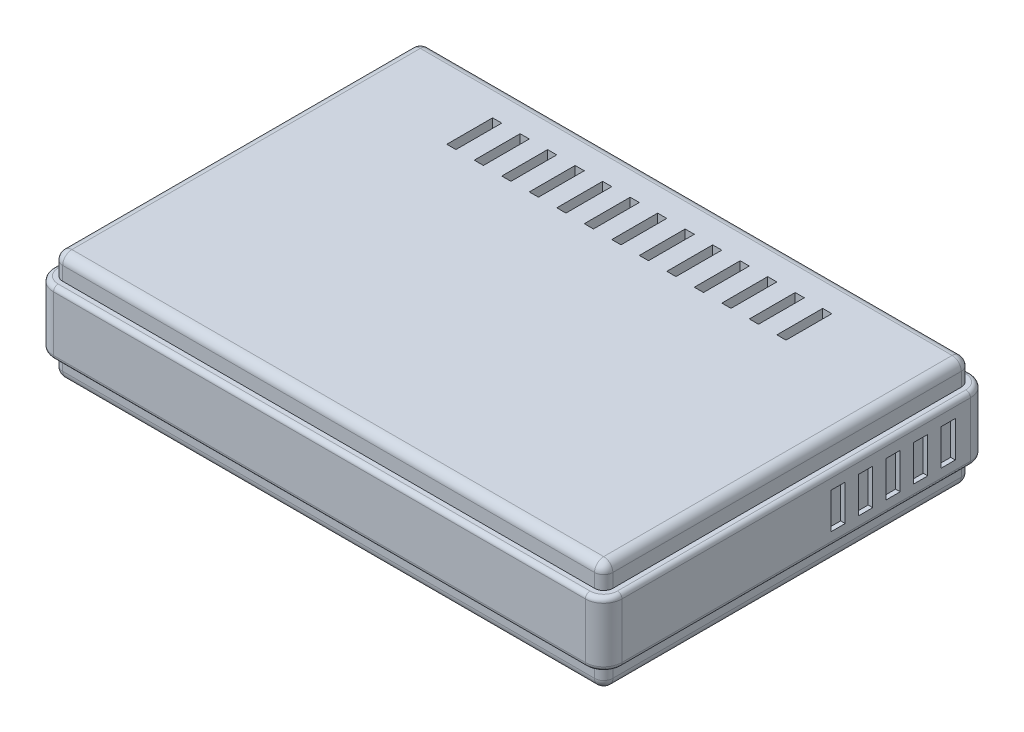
ISO-10303-21;
HEADER;
FILE_DESCRIPTION(('STEP AP214'),'2;1');
FILE_NAME('part.step','',(''),(''),'','','');
FILE_SCHEMA(('AUTOMOTIVE_DESIGN { 1 0 10303 214 1 1 1 1 }'));
ENDSEC;
DATA;
#1=APPLICATION_CONTEXT('core data for automotive mechanical design processes');
#2=APPLICATION_PROTOCOL_DEFINITION('international standard','automotive_design',2000,#1);
#3=PRODUCT_CONTEXT('',#1,'mechanical');
#4=PRODUCT('Part','Part','',(#3));
#5=PRODUCT_RELATED_PRODUCT_CATEGORY('part','',(#4));
#6=PRODUCT_DEFINITION_FORMATION('','',#4);
#7=PRODUCT_DEFINITION_CONTEXT('part definition',#1,'design');
#8=PRODUCT_DEFINITION('design','',#6,#7);
#9=PRODUCT_DEFINITION_SHAPE('','',#8);
#10=(LENGTH_UNIT() NAMED_UNIT(*) SI_UNIT(.MILLI.,.METRE.));
#11=(NAMED_UNIT(*) PLANE_ANGLE_UNIT() SI_UNIT($,.RADIAN.));
#12=(NAMED_UNIT(*) SI_UNIT($,.STERADIAN.) SOLID_ANGLE_UNIT());
#13=UNCERTAINTY_MEASURE_WITH_UNIT(LENGTH_MEASURE(1.E-05),#10,'distance_accuracy_value','');
#14=(GEOMETRIC_REPRESENTATION_CONTEXT(3) GLOBAL_UNCERTAINTY_ASSIGNED_CONTEXT((#13)) GLOBAL_UNIT_ASSIGNED_CONTEXT((#10,
#11,#12)) REPRESENTATION_CONTEXT('',''));
#15=CARTESIAN_POINT('',(0.,0.,0.));
#16=DIRECTION('',(0.,0.,1.));
#17=DIRECTION('',(1.,0.,0.));
#18=AXIS2_PLACEMENT_3D('',#15,#16,#17);
#19=CARTESIAN_POINT('',(-78.74,8.89,-48.26));
#20=DIRECTION('',(1.,0.,0.));
#21=DIRECTION('',(0.,0.,-1.));
#22=AXIS2_PLACEMENT_3D('',#19,#20,#21);
#23=PLANE('',#22);
#24=DIRECTION('',(0.,1.,0.));
#25=VECTOR('',#24,1.);
#26=CARTESIAN_POINT('',(-78.74,4.74819819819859,-21.1895495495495));
#27=LINE('',#26,#25);
#28=CARTESIAN_POINT('',(-78.74,-5.20585585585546,-21.1895495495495));
#29=VERTEX_POINT('',#28);
#30=CARTESIAN_POINT('',(-78.74,4.74819819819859,-21.1895495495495));
#31=VERTEX_POINT('',#30);
#32=EDGE_CURVE('E1266',#29,#31,#27,.T.);
#33=ORIENTED_EDGE('',*,*,#32,.T.);
#34=DIRECTION('',(0.,0.,1.));
#35=VECTOR('',#34,1.);
#36=CARTESIAN_POINT('',(-78.74,4.74819819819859,-21.1895495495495));
#37=LINE('',#36,#35);
#38=CARTESIAN_POINT('',(-78.74,4.74819819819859,-17.2994594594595));
#39=VERTEX_POINT('',#38);
#40=EDGE_CURVE('E1277',#31,#39,#37,.T.);
#41=ORIENTED_EDGE('',*,*,#40,.T.);
#42=DIRECTION('',(0.,-1.,0.));
#43=VECTOR('',#42,1.);
#44=CARTESIAN_POINT('',(-78.74,4.74819819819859,-17.2994594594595));
#45=LINE('',#44,#43);
#46=CARTESIAN_POINT('',(-78.74,-5.20585585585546,-17.2994594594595));
#47=VERTEX_POINT('',#46);
#48=EDGE_CURVE('E1289',#39,#47,#45,.T.);
#49=ORIENTED_EDGE('',*,*,#48,.T.);
#50=DIRECTION('',(0.,0.,-1.));
#51=VECTOR('',#50,1.);
#52=CARTESIAN_POINT('',(-78.74,-5.20585585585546,-21.1895495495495));
#53=LINE('',#52,#51);
#54=EDGE_CURVE('E1286',#47,#29,#53,.T.);
#55=ORIENTED_EDGE('',*,*,#54,.T.);
#56=EDGE_LOOP('',(#33,#41,#49,#55));
#57=FACE_BOUND('',#56,.T.);
#58=DIRECTION('',(0.,1.,0.));
#59=VECTOR('',#58,1.);
#60=CARTESIAN_POINT('',(-78.74,4.7481981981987,-36.4295495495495));
#61=LINE('',#60,#59);
#62=CARTESIAN_POINT('',(-78.74,-5.20585585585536,-36.4295495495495));
#63=VERTEX_POINT('',#62);
#64=CARTESIAN_POINT('',(-78.74,4.7481981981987,-36.4295495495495));
#65=VERTEX_POINT('',#64);
#66=EDGE_CURVE('E1328',#63,#65,#61,.T.);
#67=ORIENTED_EDGE('',*,*,#66,.T.);
#68=DIRECTION('',(0.,0.,1.));
#69=VECTOR('',#68,1.);
#70=CARTESIAN_POINT('',(-78.74,4.7481981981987,-36.4295495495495));
#71=LINE('',#70,#69);
#72=CARTESIAN_POINT('',(-78.74,4.7481981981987,-32.5394594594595));
#73=VERTEX_POINT('',#72);
#74=EDGE_CURVE('E1339',#65,#73,#71,.T.);
#75=ORIENTED_EDGE('',*,*,#74,.T.);
#76=DIRECTION('',(0.,-1.,0.));
#77=VECTOR('',#76,1.);
#78=CARTESIAN_POINT('',(-78.74,4.7481981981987,-32.5394594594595));
#79=LINE('',#78,#77);
#80=CARTESIAN_POINT('',(-78.74,-5.20585585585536,-32.5394594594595));
#81=VERTEX_POINT('',#80);
#82=EDGE_CURVE('E1351',#73,#81,#79,.T.);
#83=ORIENTED_EDGE('',*,*,#82,.T.);
#84=DIRECTION('',(0.,0.,-1.));
#85=VECTOR('',#84,1.);
#86=CARTESIAN_POINT('',(-78.74,-5.20585585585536,-36.4295495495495));
#87=LINE('',#86,#85);
#88=EDGE_CURVE('E1348',#81,#63,#87,.T.);
#89=ORIENTED_EDGE('',*,*,#88,.T.);
#90=EDGE_LOOP('',(#67,#75,#83,#89));
#91=FACE_BOUND('',#90,.T.);
#92=DIRECTION('',(0.,-1.,0.));
#93=VECTOR('',#92,1.);
#94=CARTESIAN_POINT('',(-78.74,8.89,-48.26));
#95=LINE('',#94,#93);
#96=CARTESIAN_POINT('',(-78.74,7.62,-48.26));
#97=VERTEX_POINT('',#96);
#98=CARTESIAN_POINT('',(-78.74,-7.62,-48.26));
#99=VERTEX_POINT('',#98);
#100=EDGE_CURVE('E1573',#97,#99,#95,.T.);
#101=ORIENTED_EDGE('',*,*,#100,.T.);
#102=DIRECTION('',(0.,0.,1.));
#103=VECTOR('',#102,1.);
#104=CARTESIAN_POINT('',(-78.74,-7.62,-48.26));
#105=LINE('',#104,#103);
#106=CARTESIAN_POINT('',(-78.74,-7.62,48.26));
#107=VERTEX_POINT('',#106);
#108=EDGE_CURVE('E11',#99,#107,#105,.T.);
#109=ORIENTED_EDGE('',*,*,#108,.T.);
#110=DIRECTION('',(0.,-1.,0.));
#111=VECTOR('',#110,1.);
#112=CARTESIAN_POINT('',(-78.74,8.89,48.26));
#113=LINE('',#112,#111);
#114=CARTESIAN_POINT('',(-78.74,7.62,48.26));
#115=VERTEX_POINT('',#114);
#116=EDGE_CURVE('E1570',#115,#107,#113,.T.);
#117=ORIENTED_EDGE('',*,*,#116,.F.);
#118=DIRECTION('',(0.,0.,1.));
#119=VECTOR('',#118,1.);
#120=CARTESIAN_POINT('',(-78.74,7.62,-48.26));
#121=LINE('',#120,#119);
#122=EDGE_CURVE('E40',#115,#97,#121,.F.);
#123=ORIENTED_EDGE('',*,*,#122,.T.);
#124=EDGE_LOOP('',(#101,#109,#117,#123));
#125=FACE_BOUND('',#124,.T.);
#126=DIRECTION('',(0.,1.,0.));
#127=VECTOR('',#126,1.);
#128=CARTESIAN_POINT('',(-78.74,4.74819819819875,-44.0495495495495));
#129=LINE('',#128,#127);
#130=CARTESIAN_POINT('',(-78.74,-5.2058558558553,-44.0495495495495));
#131=VERTEX_POINT('',#130);
#132=CARTESIAN_POINT('',(-78.74,4.74819819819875,-44.0495495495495));
#133=VERTEX_POINT('',#132);
#134=EDGE_CURVE('E1359',#131,#133,#129,.T.);
#135=ORIENTED_EDGE('',*,*,#134,.T.);
#136=DIRECTION('',(0.,0.,1.));
#137=VECTOR('',#136,1.);
#138=CARTESIAN_POINT('',(-78.74,4.74819819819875,-44.0495495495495));
#139=LINE('',#138,#137);
#140=CARTESIAN_POINT('',(-78.74,4.74819819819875,-40.1594594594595));
#141=VERTEX_POINT('',#140);
#142=EDGE_CURVE('E1370',#133,#141,#139,.T.);
#143=ORIENTED_EDGE('',*,*,#142,.T.);
#144=DIRECTION('',(0.,-1.,0.));
#145=VECTOR('',#144,1.);
#146=CARTESIAN_POINT('',(-78.74,4.74819819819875,-40.1594594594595));
#147=LINE('',#146,#145);
#148=CARTESIAN_POINT('',(-78.74,-5.2058558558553,-40.1594594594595));
#149=VERTEX_POINT('',#148);
#150=EDGE_CURVE('E1382',#141,#149,#147,.T.);
#151=ORIENTED_EDGE('',*,*,#150,.T.);
#152=DIRECTION('',(0.,0.,-1.));
#153=VECTOR('',#152,1.);
#154=CARTESIAN_POINT('',(-78.74,-5.2058558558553,-44.0495495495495));
#155=LINE('',#154,#153);
#156=EDGE_CURVE('E1379',#149,#131,#155,.T.);
#157=ORIENTED_EDGE('',*,*,#156,.T.);
#158=EDGE_LOOP('',(#135,#143,#151,#157));
#159=FACE_BOUND('',#158,.T.);
#160=DIRECTION('',(0.,1.,0.));
#161=VECTOR('',#160,1.);
#162=CARTESIAN_POINT('',(-78.74,4.74819819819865,-28.8095495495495));
#163=LINE('',#162,#161);
#164=CARTESIAN_POINT('',(-78.74,-5.20585585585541,-28.8095495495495));
#165=VERTEX_POINT('',#164);
#166=CARTESIAN_POINT('',(-78.74,4.74819819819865,-28.8095495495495));
#167=VERTEX_POINT('',#166);
#168=EDGE_CURVE('E1297',#165,#167,#163,.T.);
#169=ORIENTED_EDGE('',*,*,#168,.T.);
#170=DIRECTION('',(0.,0.,1.));
#171=VECTOR('',#170,1.);
#172=CARTESIAN_POINT('',(-78.74,4.74819819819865,-28.8095495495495));
#173=LINE('',#172,#171);
#174=CARTESIAN_POINT('',(-78.74,4.74819819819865,-24.9194594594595));
#175=VERTEX_POINT('',#174);
#176=EDGE_CURVE('E1308',#167,#175,#173,.T.);
#177=ORIENTED_EDGE('',*,*,#176,.T.);
#178=DIRECTION('',(0.,-1.,0.));
#179=VECTOR('',#178,1.);
#180=CARTESIAN_POINT('',(-78.74,4.74819819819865,-24.9194594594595));
#181=LINE('',#180,#179);
#182=CARTESIAN_POINT('',(-78.74,-5.20585585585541,-24.9194594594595));
#183=VERTEX_POINT('',#182);
#184=EDGE_CURVE('E1320',#175,#183,#181,.T.);
#185=ORIENTED_EDGE('',*,*,#184,.T.);
#186=DIRECTION('',(0.,0.,-1.));
#187=VECTOR('',#186,1.);
#188=CARTESIAN_POINT('',(-78.74,-5.20585585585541,-28.8095495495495));
#189=LINE('',#188,#187);
#190=EDGE_CURVE('E1317',#183,#165,#189,.T.);
#191=ORIENTED_EDGE('',*,*,#190,.T.);
#192=EDGE_LOOP('',(#169,#177,#185,#191));
#193=FACE_BOUND('',#192,.T.);
#194=DIRECTION('',(0.,1.,0.));
#195=VECTOR('',#194,1.);
#196=CARTESIAN_POINT('',(-78.74,4.74819819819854,-13.5695495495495));
#197=LINE('',#196,#195);
#198=CARTESIAN_POINT('',(-78.74,-5.20585585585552,-13.5695495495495));
#199=VERTEX_POINT('',#198);
#200=CARTESIAN_POINT('',(-78.74,4.74819819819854,-13.5695495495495));
#201=VERTEX_POINT('',#200);
#202=EDGE_CURVE('E1235',#199,#201,#197,.T.);
#203=ORIENTED_EDGE('',*,*,#202,.T.);
#204=DIRECTION('',(0.,0.,1.));
#205=VECTOR('',#204,1.);
#206=CARTESIAN_POINT('',(-78.74,4.74819819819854,-13.5695495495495));
#207=LINE('',#206,#205);
#208=CARTESIAN_POINT('',(-78.74,4.74819819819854,-9.67945945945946));
#209=VERTEX_POINT('',#208);
#210=EDGE_CURVE('E1246',#201,#209,#207,.T.);
#211=ORIENTED_EDGE('',*,*,#210,.T.);
#212=DIRECTION('',(0.,-1.,0.));
#213=VECTOR('',#212,1.);
#214=CARTESIAN_POINT('',(-78.74,4.74819819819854,-9.67945945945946));
#215=LINE('',#214,#213);
#216=CARTESIAN_POINT('',(-78.74,-5.20585585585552,-9.67945945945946));
#217=VERTEX_POINT('',#216);
#218=EDGE_CURVE('E1258',#209,#217,#215,.T.);
#219=ORIENTED_EDGE('',*,*,#218,.T.);
#220=DIRECTION('',(0.,0.,-1.));
#221=VECTOR('',#220,1.);
#222=CARTESIAN_POINT('',(-78.74,-5.20585585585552,-13.5695495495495));
#223=LINE('',#222,#221);
#224=EDGE_CURVE('E1255',#217,#199,#223,.T.);
#225=ORIENTED_EDGE('',*,*,#224,.T.);
#226=EDGE_LOOP('',(#203,#211,#219,#225));
#227=FACE_BOUND('',#226,.T.);
#228=ADVANCED_FACE('F31',(#57,#91,#125,#159,#193,#227),#23,.F.);
#229=CARTESIAN_POINT('',(-76.2,15.24,50.8));
#230=DIRECTION('',(1.,0.,0.));
#231=DIRECTION('',(0.,0.,-1.));
#232=AXIS2_PLACEMENT_3D('',#229,#230,#231);
#233=PLANE('',#232);
#234=DIRECTION('',(0.,-1.,0.));
#235=VECTOR('',#234,1.);
#236=CARTESIAN_POINT('',(-76.2,15.24,-48.26));
#237=LINE('',#236,#235);
#238=CARTESIAN_POINT('',(-76.2,12.7,-48.26));
#239=VERTEX_POINT('',#238);
#240=CARTESIAN_POINT('',(-76.2,8.89,-48.26));
#241=VERTEX_POINT('',#240);
#242=EDGE_CURVE('E1676',#239,#241,#237,.T.);
#243=ORIENTED_EDGE('',*,*,#242,.T.);
#244=DIRECTION('',(0.,0.,1.));
#245=VECTOR('',#244,1.);
#246=CARTESIAN_POINT('',(-76.2,8.89,50.8));
#247=LINE('',#246,#245);
#248=CARTESIAN_POINT('',(-76.2,8.89,48.26));
#249=VERTEX_POINT('',#248);
#250=EDGE_CURVE('E1612',#241,#249,#247,.T.);
#251=ORIENTED_EDGE('',*,*,#250,.T.);
#252=DIRECTION('',(0.,-1.,0.));
#253=VECTOR('',#252,1.);
#254=CARTESIAN_POINT('',(-76.2,15.24,48.26));
#255=LINE('',#254,#253);
#256=CARTESIAN_POINT('',(-76.2,12.7,48.26));
#257=VERTEX_POINT('',#256);
#258=EDGE_CURVE('E1666',#249,#257,#255,.F.);
#259=ORIENTED_EDGE('',*,*,#258,.T.);
#260=DIRECTION('',(0.,0.,1.));
#261=VECTOR('',#260,1.);
#262=CARTESIAN_POINT('',(-76.2,12.7,50.8));
#263=LINE('',#262,#261);
#264=EDGE_CURVE('E1670',#257,#239,#263,.F.);
#265=ORIENTED_EDGE('',*,*,#264,.T.);
#266=EDGE_LOOP('',(#243,#251,#259,#265));
#267=FACE_BOUND('',#266,.T.);
#268=ADVANCED_FACE('F1968',(#267),#233,.F.);
#269=CARTESIAN_POINT('',(-76.2,15.24,50.8));
#270=DIRECTION('',(0.,0.,-1.));
#271=DIRECTION('',(-1.,0.,0.));
#272=AXIS2_PLACEMENT_3D('',#269,#270,#271);
#273=PLANE('',#272);
#274=DIRECTION('',(0.,-1.,0.));
#275=VECTOR('',#274,1.);
#276=CARTESIAN_POINT('',(-73.66,15.24,50.8));
#277=LINE('',#276,#275);
#278=CARTESIAN_POINT('',(-73.66,12.7,50.8));
#279=VERTEX_POINT('',#278);
#280=CARTESIAN_POINT('',(-73.66,8.89,50.8));
#281=VERTEX_POINT('',#280);
#282=EDGE_CURVE('E1618',#279,#281,#277,.T.);
#283=ORIENTED_EDGE('',*,*,#282,.T.);
#284=DIRECTION('',(1.,0.,0.));
#285=VECTOR('',#284,1.);
#286=CARTESIAN_POINT('',(-76.2,8.89,50.8));
#287=LINE('',#286,#285);
#288=CARTESIAN_POINT('',(73.66,8.89,50.8));
#289=VERTEX_POINT('',#288);
#290=EDGE_CURVE('E1601',#281,#289,#287,.T.);
#291=ORIENTED_EDGE('',*,*,#290,.T.);
#292=DIRECTION('',(0.,-1.,0.));
#293=VECTOR('',#292,1.);
#294=CARTESIAN_POINT('',(73.66,15.24,50.8));
#295=LINE('',#294,#293);
#296=CARTESIAN_POINT('',(73.66,12.7,50.8));
#297=VERTEX_POINT('',#296);
#298=EDGE_CURVE('E1627',#289,#297,#295,.F.);
#299=ORIENTED_EDGE('',*,*,#298,.T.);
#300=DIRECTION('',(1.,0.,0.));
#301=VECTOR('',#300,1.);
#302=CARTESIAN_POINT('',(-76.2,12.7,50.8));
#303=LINE('',#302,#301);
#304=EDGE_CURVE('E1621',#297,#279,#303,.F.);
#305=ORIENTED_EDGE('',*,*,#304,.T.);
#306=EDGE_LOOP('',(#283,#291,#299,#305));
#307=FACE_BOUND('',#306,.T.);
#308=ADVANCED_FACE('F1974',(#307),#273,.F.);
#309=CARTESIAN_POINT('',(76.2,15.24,50.8));
#310=DIRECTION('',(-1.,0.,0.));
#311=DIRECTION('',(0.,0.,1.));
#312=AXIS2_PLACEMENT_3D('',#309,#310,#311);
#313=PLANE('',#312);
#314=DIRECTION('',(0.,-1.,0.));
#315=VECTOR('',#314,1.);
#316=CARTESIAN_POINT('',(76.2,15.24,48.26));
#317=LINE('',#316,#315);
#318=CARTESIAN_POINT('',(76.2,12.7,48.26));
#319=VERTEX_POINT('',#318);
#320=CARTESIAN_POINT('',(76.2,8.89,48.26));
#321=VERTEX_POINT('',#320);
#322=EDGE_CURVE('E1650',#319,#321,#317,.T.);
#323=ORIENTED_EDGE('',*,*,#322,.T.);
#324=DIRECTION('',(0.,0.,-1.));
#325=VECTOR('',#324,1.);
#326=CARTESIAN_POINT('',(76.2,8.89,50.8));
#327=LINE('',#326,#325);
#328=CARTESIAN_POINT('',(76.2,8.89,-48.26));
#329=VERTEX_POINT('',#328);
#330=EDGE_CURVE('E1599',#321,#329,#327,.T.);
#331=ORIENTED_EDGE('',*,*,#330,.T.);
#332=DIRECTION('',(0.,-1.,0.));
#333=VECTOR('',#332,1.);
#334=CARTESIAN_POINT('',(76.2,15.24,-48.26));
#335=LINE('',#334,#333);
#336=CARTESIAN_POINT('',(76.2,12.7,-48.26));
#337=VERTEX_POINT('',#336);
#338=EDGE_CURVE('E1640',#329,#337,#335,.F.);
#339=ORIENTED_EDGE('',*,*,#338,.T.);
#340=DIRECTION('',(0.,0.,-1.));
#341=VECTOR('',#340,1.);
#342=CARTESIAN_POINT('',(76.2,12.7,50.8));
#343=LINE('',#342,#341);
#344=EDGE_CURVE('E1644',#337,#319,#343,.F.);
#345=ORIENTED_EDGE('',*,*,#344,.T.);
#346=EDGE_LOOP('',(#323,#331,#339,#345));
#347=FACE_BOUND('',#346,.T.);
#348=ADVANCED_FACE('F2004',(#347),#313,.F.);
#349=CARTESIAN_POINT('',(-76.2,15.24,-50.8));
#350=DIRECTION('',(0.,0.,1.));
#351=DIRECTION('',(1.,0.,0.));
#352=AXIS2_PLACEMENT_3D('',#349,#350,#351);
#353=PLANE('',#352);
#354=DIRECTION('',(0.,-1.,0.));
#355=VECTOR('',#354,1.);
#356=CARTESIAN_POINT('',(73.66,15.24,-50.8));
#357=LINE('',#356,#355);
#358=CARTESIAN_POINT('',(73.66,12.7,-50.8));
#359=VERTEX_POINT('',#358);
#360=CARTESIAN_POINT('',(73.66,8.89,-50.8));
#361=VERTEX_POINT('',#360);
#362=EDGE_CURVE('E1663',#359,#361,#357,.T.);
#363=ORIENTED_EDGE('',*,*,#362,.T.);
#364=DIRECTION('',(-1.,0.,0.));
#365=VECTOR('',#364,1.);
#366=CARTESIAN_POINT('',(-76.2,8.89,-50.8));
#367=LINE('',#366,#365);
#368=CARTESIAN_POINT('',(-73.66,8.89,-50.8));
#369=VERTEX_POINT('',#368);
#370=EDGE_CURVE('E1610',#361,#369,#367,.T.);
#371=ORIENTED_EDGE('',*,*,#370,.T.);
#372=DIRECTION('',(0.,-1.,0.));
#373=VECTOR('',#372,1.);
#374=CARTESIAN_POINT('',(-73.66,15.24,-50.8));
#375=LINE('',#374,#373);
#376=CARTESIAN_POINT('',(-73.66,12.7,-50.8));
#377=VERTEX_POINT('',#376);
#378=EDGE_CURVE('E1653',#369,#377,#375,.F.);
#379=ORIENTED_EDGE('',*,*,#378,.T.);
#380=DIRECTION('',(-1.,0.,0.));
#381=VECTOR('',#380,1.);
#382=CARTESIAN_POINT('',(-76.2,12.7,-50.8));
#383=LINE('',#382,#381);
#384=EDGE_CURVE('E1657',#377,#359,#383,.F.);
#385=ORIENTED_EDGE('',*,*,#384,.T.);
#386=EDGE_LOOP('',(#363,#371,#379,#385));
#387=FACE_BOUND('',#386,.T.);
#388=ADVANCED_FACE('F1995',(#387),#353,.F.);
#389=CARTESIAN_POINT('',(-76.2,15.24,-50.8));
#390=DIRECTION('',(0.,-1.,0.));
#391=DIRECTION('',(0.,0.,-1.));
#392=AXIS2_PLACEMENT_3D('',#389,#390,#391);
#393=PLANE('',#392);
#394=DIRECTION('',(1.,0.,0.));
#395=VECTOR('',#394,1.);
#396=CARTESIAN_POINT('',(44.45,15.24,-28.9162738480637));
#397=LINE('',#396,#395);
#398=CARTESIAN_POINT('',(44.45,15.24,-28.9162738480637));
#399=VERTEX_POINT('',#398);
#400=CARTESIAN_POINT('',(46.99,15.24,-28.9162738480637));
#401=VERTEX_POINT('',#400);
#402=EDGE_CURVE('E849',#399,#401,#397,.T.);
#403=ORIENTED_EDGE('',*,*,#402,.F.);
#404=DIRECTION('',(0.,0.,1.));
#405=VECTOR('',#404,1.);
#406=CARTESIAN_POINT('',(44.45,15.24,-41.6162738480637));
#407=LINE('',#406,#405);
#408=CARTESIAN_POINT('',(44.45,15.24,-41.6162738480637));
#409=VERTEX_POINT('',#408);
#410=EDGE_CURVE('E48',#409,#399,#407,.T.);
#411=ORIENTED_EDGE('',*,*,#410,.F.);
#412=DIRECTION('',(-1.,0.,0.));
#413=VECTOR('',#412,1.);
#414=CARTESIAN_POINT('',(44.45,15.24,-41.6162738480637));
#415=LINE('',#414,#413);
#416=CARTESIAN_POINT('',(46.99,15.24,-41.6162738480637));
#417=VERTEX_POINT('',#416);
#418=EDGE_CURVE('E837',#417,#409,#415,.T.);
#419=ORIENTED_EDGE('',*,*,#418,.F.);
#420=DIRECTION('',(0.,0.,-1.));
#421=VECTOR('',#420,1.);
#422=CARTESIAN_POINT('',(46.99,15.24,-41.6162738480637));
#423=LINE('',#422,#421);
#424=EDGE_CURVE('E840',#401,#417,#423,.T.);
#425=ORIENTED_EDGE('',*,*,#424,.F.);
#426=EDGE_LOOP('',(#403,#411,#419,#425));
#427=FACE_BOUND('',#426,.T.);
#428=DIRECTION('',(1.,0.,0.));
#429=VECTOR('',#428,1.);
#430=CARTESIAN_POINT('',(36.83,15.24,-28.9162738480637));
#431=LINE('',#430,#429);
#432=CARTESIAN_POINT('',(36.83,15.24,-28.9162738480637));
#433=VERTEX_POINT('',#432);
#434=CARTESIAN_POINT('',(39.37,15.24,-28.9162738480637));
#435=VERTEX_POINT('',#434);
#436=EDGE_CURVE('E874',#433,#435,#431,.T.);
#437=ORIENTED_EDGE('',*,*,#436,.F.);
#438=DIRECTION('',(0.,0.,1.));
#439=VECTOR('',#438,1.);
#440=CARTESIAN_POINT('',(36.83,15.24,-41.6162738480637));
#441=LINE('',#440,#439);
#442=CARTESIAN_POINT('',(36.83,15.24,-41.6162738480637));
#443=VERTEX_POINT('',#442);
#444=EDGE_CURVE('E56',#443,#433,#441,.T.);
#445=ORIENTED_EDGE('',*,*,#444,.F.);
#446=DIRECTION('',(-1.,0.,0.));
#447=VECTOR('',#446,1.);
#448=CARTESIAN_POINT('',(36.83,15.24,-41.6162738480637));
#449=LINE('',#448,#447);
#450=CARTESIAN_POINT('',(39.37,15.24,-41.6162738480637));
#451=VERTEX_POINT('',#450);
#452=EDGE_CURVE('E863',#451,#443,#449,.T.);
#453=ORIENTED_EDGE('',*,*,#452,.F.);
#454=DIRECTION('',(0.,0.,-1.));
#455=VECTOR('',#454,1.);
#456=CARTESIAN_POINT('',(39.37,15.24,-41.6162738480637));
#457=LINE('',#456,#455);
#458=EDGE_CURVE('E877',#435,#451,#457,.T.);
#459=ORIENTED_EDGE('',*,*,#458,.F.);
#460=EDGE_LOOP('',(#437,#445,#453,#459));
#461=FACE_BOUND('',#460,.T.);
#462=DIRECTION('',(1.,0.,0.));
#463=VECTOR('',#462,1.);
#464=CARTESIAN_POINT('',(29.21,15.24,-28.9162738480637));
#465=LINE('',#464,#463);
#466=CARTESIAN_POINT('',(29.21,15.24,-28.9162738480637));
#467=VERTEX_POINT('',#466);
#468=CARTESIAN_POINT('',(31.75,15.24,-28.9162738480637));
#469=VERTEX_POINT('',#468);
#470=EDGE_CURVE('E905',#467,#469,#465,.T.);
#471=ORIENTED_EDGE('',*,*,#470,.F.);
#472=DIRECTION('',(0.,0.,1.));
#473=VECTOR('',#472,1.);
#474=CARTESIAN_POINT('',(29.21,15.24,-41.6162738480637));
#475=LINE('',#474,#473);
#476=CARTESIAN_POINT('',(29.21,15.24,-41.6162738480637));
#477=VERTEX_POINT('',#476);
#478=EDGE_CURVE('E884',#477,#467,#475,.T.);
#479=ORIENTED_EDGE('',*,*,#478,.F.);
#480=DIRECTION('',(-1.,0.,0.));
#481=VECTOR('',#480,1.);
#482=CARTESIAN_POINT('',(29.21,15.24,-41.6162738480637));
#483=LINE('',#482,#481);
#484=CARTESIAN_POINT('',(31.75,15.24,-41.6162738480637));
#485=VERTEX_POINT('',#484);
#486=EDGE_CURVE('E894',#485,#477,#483,.T.);
#487=ORIENTED_EDGE('',*,*,#486,.F.);
#488=DIRECTION('',(0.,0.,-1.));
#489=VECTOR('',#488,1.);
#490=CARTESIAN_POINT('',(31.75,15.24,-41.6162738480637));
#491=LINE('',#490,#489);
#492=EDGE_CURVE('E908',#469,#485,#491,.T.);
#493=ORIENTED_EDGE('',*,*,#492,.F.);
#494=EDGE_LOOP('',(#471,#479,#487,#493));
#495=FACE_BOUND('',#494,.T.);
#496=DIRECTION('',(1.,0.,0.));
#497=VECTOR('',#496,1.);
#498=CARTESIAN_POINT('',(21.59,15.24,-28.9162738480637));
#499=LINE('',#498,#497);
#500=CARTESIAN_POINT('',(21.59,15.24,-28.9162738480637));
#501=VERTEX_POINT('',#500);
#502=CARTESIAN_POINT('',(24.13,15.24,-28.9162738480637));
#503=VERTEX_POINT('',#502);
#504=EDGE_CURVE('E937',#501,#503,#499,.T.);
#505=ORIENTED_EDGE('',*,*,#504,.F.);
#506=DIRECTION('',(0.,0.,1.));
#507=VECTOR('',#506,1.);
#508=CARTESIAN_POINT('',(21.59,15.24,-41.6162738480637));
#509=LINE('',#508,#507);
#510=CARTESIAN_POINT('',(21.59,15.24,-41.6162738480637));
#511=VERTEX_POINT('',#510);
#512=EDGE_CURVE('E915',#511,#501,#509,.T.);
#513=ORIENTED_EDGE('',*,*,#512,.F.);
#514=DIRECTION('',(-1.,0.,0.));
#515=VECTOR('',#514,1.);
#516=CARTESIAN_POINT('',(21.59,15.24,-41.6162738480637));
#517=LINE('',#516,#515);
#518=CARTESIAN_POINT('',(24.13,15.24,-41.6162738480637));
#519=VERTEX_POINT('',#518);
#520=EDGE_CURVE('E926',#519,#511,#517,.T.);
#521=ORIENTED_EDGE('',*,*,#520,.F.);
#522=DIRECTION('',(0.,0.,-1.));
#523=VECTOR('',#522,1.);
#524=CARTESIAN_POINT('',(24.13,15.24,-41.6162738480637));
#525=LINE('',#524,#523);
#526=EDGE_CURVE('E940',#503,#519,#525,.T.);
#527=ORIENTED_EDGE('',*,*,#526,.F.);
#528=EDGE_LOOP('',(#505,#513,#521,#527));
#529=FACE_BOUND('',#528,.T.);
#530=DIRECTION('',(1.,0.,0.));
#531=VECTOR('',#530,1.);
#532=CARTESIAN_POINT('',(13.97,15.24,-28.9162738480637));
#533=LINE('',#532,#531);
#534=CARTESIAN_POINT('',(13.97,15.24,-28.9162738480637));
#535=VERTEX_POINT('',#534);
#536=CARTESIAN_POINT('',(16.51,15.24,-28.9162738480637));
#537=VERTEX_POINT('',#536);
#538=EDGE_CURVE('E969',#535,#537,#533,.T.);
#539=ORIENTED_EDGE('',*,*,#538,.F.);
#540=DIRECTION('',(0.,0.,1.));
#541=VECTOR('',#540,1.);
#542=CARTESIAN_POINT('',(13.97,15.24,-41.6162738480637));
#543=LINE('',#542,#541);
#544=CARTESIAN_POINT('',(13.97,15.24,-41.6162738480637));
#545=VERTEX_POINT('',#544);
#546=EDGE_CURVE('E947',#545,#535,#543,.T.);
#547=ORIENTED_EDGE('',*,*,#546,.F.);
#548=DIRECTION('',(-1.,0.,0.));
#549=VECTOR('',#548,1.);
#550=CARTESIAN_POINT('',(13.97,15.24,-41.6162738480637));
#551=LINE('',#550,#549);
#552=CARTESIAN_POINT('',(16.51,15.24,-41.6162738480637));
#553=VERTEX_POINT('',#552);
#554=EDGE_CURVE('E958',#553,#545,#551,.T.);
#555=ORIENTED_EDGE('',*,*,#554,.F.);
#556=DIRECTION('',(0.,0.,-1.));
#557=VECTOR('',#556,1.);
#558=CARTESIAN_POINT('',(16.51,15.24,-41.6162738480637));
#559=LINE('',#558,#557);
#560=EDGE_CURVE('E972',#537,#553,#559,.T.);
#561=ORIENTED_EDGE('',*,*,#560,.F.);
#562=EDGE_LOOP('',(#539,#547,#555,#561));
#563=FACE_BOUND('',#562,.T.);
#564=DIRECTION('',(1.,0.,0.));
#565=VECTOR('',#564,1.);
#566=CARTESIAN_POINT('',(6.35,15.24,-28.9162738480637));
#567=LINE('',#566,#565);
#568=CARTESIAN_POINT('',(6.34999999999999,15.24,-28.9162738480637));
#569=VERTEX_POINT('',#568);
#570=CARTESIAN_POINT('',(8.89,15.24,-28.9162738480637));
#571=VERTEX_POINT('',#570);
#572=EDGE_CURVE('E1001',#569,#571,#567,.T.);
#573=ORIENTED_EDGE('',*,*,#572,.F.);
#574=DIRECTION('',(0.,0.,1.));
#575=VECTOR('',#574,1.);
#576=CARTESIAN_POINT('',(6.35,15.24,-41.6162738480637));
#577=LINE('',#576,#575);
#578=CARTESIAN_POINT('',(6.35,15.24,-41.6162738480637));
#579=VERTEX_POINT('',#578);
#580=EDGE_CURVE('E979',#579,#569,#577,.T.);
#581=ORIENTED_EDGE('',*,*,#580,.F.);
#582=DIRECTION('',(-1.,0.,0.));
#583=VECTOR('',#582,1.);
#584=CARTESIAN_POINT('',(6.35,15.24,-41.6162738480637));
#585=LINE('',#584,#583);
#586=CARTESIAN_POINT('',(8.89,15.24,-41.6162738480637));
#587=VERTEX_POINT('',#586);
#588=EDGE_CURVE('E990',#587,#579,#585,.T.);
#589=ORIENTED_EDGE('',*,*,#588,.F.);
#590=DIRECTION('',(0.,0.,-1.));
#591=VECTOR('',#590,1.);
#592=CARTESIAN_POINT('',(8.89,15.24,-41.6162738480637));
#593=LINE('',#592,#591);
#594=EDGE_CURVE('E1004',#571,#587,#593,.T.);
#595=ORIENTED_EDGE('',*,*,#594,.F.);
#596=EDGE_LOOP('',(#573,#581,#589,#595));
#597=FACE_BOUND('',#596,.T.);
#598=DIRECTION('',(1.,0.,0.));
#599=VECTOR('',#598,1.);
#600=CARTESIAN_POINT('',(-46.99,15.24,-28.9162738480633));
#601=LINE('',#600,#599);
#602=CARTESIAN_POINT('',(-46.99,15.24,-28.9162738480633));
#603=VERTEX_POINT('',#602);
#604=CARTESIAN_POINT('',(-44.45,15.24,-28.9162738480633));
#605=VERTEX_POINT('',#604);
#606=EDGE_CURVE('E1033',#603,#605,#601,.T.);
#607=ORIENTED_EDGE('',*,*,#606,.F.);
#608=DIRECTION('',(0.,0.,1.));
#609=VECTOR('',#608,1.);
#610=CARTESIAN_POINT('',(-46.99,15.24,-41.6162738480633));
#611=LINE('',#610,#609);
#612=CARTESIAN_POINT('',(-46.99,15.24,-41.6162738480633));
#613=VERTEX_POINT('',#612);
#614=EDGE_CURVE('E1011',#613,#603,#611,.T.);
#615=ORIENTED_EDGE('',*,*,#614,.F.);
#616=DIRECTION('',(-1.,0.,0.));
#617=VECTOR('',#616,1.);
#618=CARTESIAN_POINT('',(-46.99,15.24,-41.6162738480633));
#619=LINE('',#618,#617);
#620=CARTESIAN_POINT('',(-44.45,15.24,-41.6162738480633));
#621=VERTEX_POINT('',#620);
#622=EDGE_CURVE('E1022',#621,#613,#619,.T.);
#623=ORIENTED_EDGE('',*,*,#622,.F.);
#624=DIRECTION('',(0.,0.,-1.));
#625=VECTOR('',#624,1.);
#626=CARTESIAN_POINT('',(-44.45,15.24,-41.6162738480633));
#627=LINE('',#626,#625);
#628=EDGE_CURVE('E1036',#605,#621,#627,.T.);
#629=ORIENTED_EDGE('',*,*,#628,.F.);
#630=EDGE_LOOP('',(#607,#615,#623,#629));
#631=FACE_BOUND('',#630,.T.);
#632=DIRECTION('',(1.,0.,0.));
#633=VECTOR('',#632,1.);
#634=CARTESIAN_POINT('',(-39.37,15.24,-28.9162738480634));
#635=LINE('',#634,#633);
#636=CARTESIAN_POINT('',(-39.37,15.24,-28.9162738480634));
#637=VERTEX_POINT('',#636);
#638=CARTESIAN_POINT('',(-36.83,15.24,-28.9162738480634));
#639=VERTEX_POINT('',#638);
#640=EDGE_CURVE('E1065',#637,#639,#635,.T.);
#641=ORIENTED_EDGE('',*,*,#640,.F.);
#642=DIRECTION('',(0.,0.,1.));
#643=VECTOR('',#642,1.);
#644=CARTESIAN_POINT('',(-39.37,15.24,-41.6162738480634));
#645=LINE('',#644,#643);
#646=CARTESIAN_POINT('',(-39.37,15.24,-41.6162738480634));
#647=VERTEX_POINT('',#646);
#648=EDGE_CURVE('E1043',#647,#637,#645,.T.);
#649=ORIENTED_EDGE('',*,*,#648,.F.);
#650=DIRECTION('',(-1.,0.,0.));
#651=VECTOR('',#650,1.);
#652=CARTESIAN_POINT('',(-39.37,15.24,-41.6162738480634));
#653=LINE('',#652,#651);
#654=CARTESIAN_POINT('',(-36.83,15.24,-41.6162738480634));
#655=VERTEX_POINT('',#654);
#656=EDGE_CURVE('E1054',#655,#647,#653,.T.);
#657=ORIENTED_EDGE('',*,*,#656,.F.);
#658=DIRECTION('',(0.,0.,-1.));
#659=VECTOR('',#658,1.);
#660=CARTESIAN_POINT('',(-36.83,15.24,-41.6162738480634));
#661=LINE('',#660,#659);
#662=EDGE_CURVE('E1068',#639,#655,#661,.T.);
#663=ORIENTED_EDGE('',*,*,#662,.F.);
#664=EDGE_LOOP('',(#641,#649,#657,#663));
#665=FACE_BOUND('',#664,.T.);
#666=DIRECTION('',(1.,0.,0.));
#667=VECTOR('',#666,1.);
#668=CARTESIAN_POINT('',(-31.75,15.24,-28.9162738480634));
#669=LINE('',#668,#667);
#670=CARTESIAN_POINT('',(-31.75,15.24,-28.9162738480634));
#671=VERTEX_POINT('',#670);
#672=CARTESIAN_POINT('',(-29.21,15.24,-28.9162738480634));
#673=VERTEX_POINT('',#672);
#674=EDGE_CURVE('E1097',#671,#673,#669,.T.);
#675=ORIENTED_EDGE('',*,*,#674,.F.);
#676=DIRECTION('',(0.,0.,1.));
#677=VECTOR('',#676,1.);
#678=CARTESIAN_POINT('',(-31.75,15.24,-41.6162738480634));
#679=LINE('',#678,#677);
#680=CARTESIAN_POINT('',(-31.75,15.24,-41.6162738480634));
#681=VERTEX_POINT('',#680);
#682=EDGE_CURVE('E1075',#681,#671,#679,.T.);
#683=ORIENTED_EDGE('',*,*,#682,.F.);
#684=DIRECTION('',(-1.,0.,0.));
#685=VECTOR('',#684,1.);
#686=CARTESIAN_POINT('',(-31.75,15.24,-41.6162738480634));
#687=LINE('',#686,#685);
#688=CARTESIAN_POINT('',(-29.21,15.24,-41.6162738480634));
#689=VERTEX_POINT('',#688);
#690=EDGE_CURVE('E1086',#689,#681,#687,.T.);
#691=ORIENTED_EDGE('',*,*,#690,.F.);
#692=DIRECTION('',(0.,0.,-1.));
#693=VECTOR('',#692,1.);
#694=CARTESIAN_POINT('',(-29.21,15.24,-41.6162738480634));
#695=LINE('',#694,#693);
#696=EDGE_CURVE('E1100',#673,#689,#695,.T.);
#697=ORIENTED_EDGE('',*,*,#696,.F.);
#698=EDGE_LOOP('',(#675,#683,#691,#697));
#699=FACE_BOUND('',#698,.T.);
#700=DIRECTION('',(1.,0.,0.));
#701=VECTOR('',#700,1.);
#702=CARTESIAN_POINT('',(-24.13,15.24,-28.9162738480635));
#703=LINE('',#702,#701);
#704=CARTESIAN_POINT('',(-24.13,15.24,-28.9162738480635));
#705=VERTEX_POINT('',#704);
#706=CARTESIAN_POINT('',(-21.59,15.24,-28.9162738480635));
#707=VERTEX_POINT('',#706);
#708=EDGE_CURVE('E1129',#705,#707,#703,.T.);
#709=ORIENTED_EDGE('',*,*,#708,.F.);
#710=DIRECTION('',(0.,0.,1.));
#711=VECTOR('',#710,1.);
#712=CARTESIAN_POINT('',(-24.13,15.24,-41.6162738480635));
#713=LINE('',#712,#711);
#714=CARTESIAN_POINT('',(-24.13,15.24,-41.6162738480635));
#715=VERTEX_POINT('',#714);
#716=EDGE_CURVE('E1107',#715,#705,#713,.T.);
#717=ORIENTED_EDGE('',*,*,#716,.F.);
#718=DIRECTION('',(-1.,0.,0.));
#719=VECTOR('',#718,1.);
#720=CARTESIAN_POINT('',(-24.13,15.24,-41.6162738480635));
#721=LINE('',#720,#719);
#722=CARTESIAN_POINT('',(-21.59,15.24,-41.6162738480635));
#723=VERTEX_POINT('',#722);
#724=EDGE_CURVE('E1118',#723,#715,#721,.T.);
#725=ORIENTED_EDGE('',*,*,#724,.F.);
#726=DIRECTION('',(0.,0.,-1.));
#727=VECTOR('',#726,1.);
#728=CARTESIAN_POINT('',(-21.59,15.24,-41.6162738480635));
#729=LINE('',#728,#727);
#730=EDGE_CURVE('E1132',#707,#723,#729,.T.);
#731=ORIENTED_EDGE('',*,*,#730,.F.);
#732=EDGE_LOOP('',(#709,#717,#725,#731));
#733=FACE_BOUND('',#732,.T.);
#734=DIRECTION('',(1.,0.,0.));
#735=VECTOR('',#734,1.);
#736=CARTESIAN_POINT('',(-16.51,15.24,-28.9162738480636));
#737=LINE('',#736,#735);
#738=CARTESIAN_POINT('',(-16.51,15.24,-28.9162738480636));
#739=VERTEX_POINT('',#738);
#740=CARTESIAN_POINT('',(-13.97,15.24,-28.9162738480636));
#741=VERTEX_POINT('',#740);
#742=EDGE_CURVE('E1161',#739,#741,#737,.T.);
#743=ORIENTED_EDGE('',*,*,#742,.F.);
#744=DIRECTION('',(0.,0.,1.));
#745=VECTOR('',#744,1.);
#746=CARTESIAN_POINT('',(-16.51,15.24,-41.6162738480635));
#747=LINE('',#746,#745);
#748=CARTESIAN_POINT('',(-16.51,15.24,-41.6162738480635));
#749=VERTEX_POINT('',#748);
#750=EDGE_CURVE('E1139',#749,#739,#747,.T.);
#751=ORIENTED_EDGE('',*,*,#750,.F.);
#752=DIRECTION('',(-1.,0.,0.));
#753=VECTOR('',#752,1.);
#754=CARTESIAN_POINT('',(-16.51,15.24,-41.6162738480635));
#755=LINE('',#754,#753);
#756=CARTESIAN_POINT('',(-13.97,15.24,-41.6162738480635));
#757=VERTEX_POINT('',#756);
#758=EDGE_CURVE('E1150',#757,#749,#755,.T.);
#759=ORIENTED_EDGE('',*,*,#758,.F.);
#760=DIRECTION('',(0.,0.,-1.));
#761=VECTOR('',#760,1.);
#762=CARTESIAN_POINT('',(-13.97,15.24,-41.6162738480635));
#763=LINE('',#762,#761);
#764=EDGE_CURVE('E1164',#741,#757,#763,.T.);
#765=ORIENTED_EDGE('',*,*,#764,.F.);
#766=EDGE_LOOP('',(#743,#751,#759,#765));
#767=FACE_BOUND('',#766,.T.);
#768=DIRECTION('',(1.,0.,0.));
#769=VECTOR('',#768,1.);
#770=CARTESIAN_POINT('',(-8.89,15.24,-28.9162738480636));
#771=LINE('',#770,#769);
#772=CARTESIAN_POINT('',(-8.89,15.24,-28.9162738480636));
#773=VERTEX_POINT('',#772);
#774=CARTESIAN_POINT('',(-6.35,15.24,-28.9162738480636));
#775=VERTEX_POINT('',#774);
#776=EDGE_CURVE('E1193',#773,#775,#771,.T.);
#777=ORIENTED_EDGE('',*,*,#776,.F.);
#778=DIRECTION('',(0.,0.,1.));
#779=VECTOR('',#778,1.);
#780=CARTESIAN_POINT('',(-8.89,15.24,-41.6162738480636));
#781=LINE('',#780,#779);
#782=CARTESIAN_POINT('',(-8.89,15.24,-41.6162738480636));
#783=VERTEX_POINT('',#782);
#784=EDGE_CURVE('E1171',#783,#773,#781,.T.);
#785=ORIENTED_EDGE('',*,*,#784,.F.);
#786=DIRECTION('',(-1.,0.,0.));
#787=VECTOR('',#786,1.);
#788=CARTESIAN_POINT('',(-8.89,15.24,-41.6162738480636));
#789=LINE('',#788,#787);
#790=CARTESIAN_POINT('',(-6.35,15.24,-41.6162738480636));
#791=VERTEX_POINT('',#790);
#792=EDGE_CURVE('E1182',#791,#783,#789,.T.);
#793=ORIENTED_EDGE('',*,*,#792,.F.);
#794=DIRECTION('',(0.,0.,-1.));
#795=VECTOR('',#794,1.);
#796=CARTESIAN_POINT('',(-6.35,15.24,-41.6162738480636));
#797=LINE('',#796,#795);
#798=EDGE_CURVE('E1196',#775,#791,#797,.T.);
#799=ORIENTED_EDGE('',*,*,#798,.F.);
#800=EDGE_LOOP('',(#777,#785,#793,#799));
#801=FACE_BOUND('',#800,.T.);
#802=DIRECTION('',(1.,0.,0.));
#803=VECTOR('',#802,1.);
#804=CARTESIAN_POINT('',(-1.27,15.24,-28.9162738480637));
#805=LINE('',#804,#803);
#806=CARTESIAN_POINT('',(-1.26999999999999,15.24,-28.9162738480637));
#807=VERTEX_POINT('',#806);
#808=CARTESIAN_POINT('',(1.27,15.24,-28.9162738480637));
#809=VERTEX_POINT('',#808);
#810=EDGE_CURVE('E1225',#807,#809,#805,.T.);
#811=ORIENTED_EDGE('',*,*,#810,.F.);
#812=DIRECTION('',(0.,0.,1.));
#813=VECTOR('',#812,1.);
#814=CARTESIAN_POINT('',(-1.27,15.24,-41.6162738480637));
#815=LINE('',#814,#813);
#816=CARTESIAN_POINT('',(-1.27,15.24,-41.6162738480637));
#817=VERTEX_POINT('',#816);
#818=EDGE_CURVE('E1203',#817,#807,#815,.T.);
#819=ORIENTED_EDGE('',*,*,#818,.F.);
#820=DIRECTION('',(-1.,0.,0.));
#821=VECTOR('',#820,1.);
#822=CARTESIAN_POINT('',(-1.27,15.24,-41.6162738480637));
#823=LINE('',#822,#821);
#824=CARTESIAN_POINT('',(1.27,15.24,-41.6162738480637));
#825=VERTEX_POINT('',#824);
#826=EDGE_CURVE('E1214',#825,#817,#823,.T.);
#827=ORIENTED_EDGE('',*,*,#826,.F.);
#828=DIRECTION('',(0.,0.,-1.));
#829=VECTOR('',#828,1.);
#830=CARTESIAN_POINT('',(1.27,15.24,-41.6162738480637));
#831=LINE('',#830,#829);
#832=EDGE_CURVE('E1228',#809,#825,#831,.T.);
#833=ORIENTED_EDGE('',*,*,#832,.F.);
#834=EDGE_LOOP('',(#811,#819,#827,#833));
#835=FACE_BOUND('',#834,.T.);
#836=DIRECTION('',(0.,0.,-1.));
#837=VECTOR('',#836,1.);
#838=CARTESIAN_POINT('',(73.66,15.24,-50.8));
#839=LINE('',#838,#837);
#840=CARTESIAN_POINT('',(73.66,15.24,48.26));
#841=VERTEX_POINT('',#840);
#842=CARTESIAN_POINT('',(73.66,15.24,-48.26));
#843=VERTEX_POINT('',#842);
#844=EDGE_CURVE('E1683',#841,#843,#839,.T.);
#845=ORIENTED_EDGE('',*,*,#844,.T.);
#846=DIRECTION('',(-1.,0.,0.));
#847=VECTOR('',#846,1.);
#848=CARTESIAN_POINT('',(-76.2,15.24,-48.26));
#849=LINE('',#848,#847);
#850=CARTESIAN_POINT('',(-73.66,15.24,-48.26));
#851=VERTEX_POINT('',#850);
#852=EDGE_CURVE('E1685',#843,#851,#849,.T.);
#853=ORIENTED_EDGE('',*,*,#852,.T.);
#854=DIRECTION('',(0.,0.,1.));
#855=VECTOR('',#854,1.);
#856=CARTESIAN_POINT('',(-73.66,15.24,-50.8));
#857=LINE('',#856,#855);
#858=CARTESIAN_POINT('',(-73.66,15.24,48.26));
#859=VERTEX_POINT('',#858);
#860=EDGE_CURVE('E1679',#851,#859,#857,.T.);
#861=ORIENTED_EDGE('',*,*,#860,.T.);
#862=DIRECTION('',(1.,0.,0.));
#863=VECTOR('',#862,1.);
#864=CARTESIAN_POINT('',(-76.2,15.24,48.26));
#865=LINE('',#864,#863);
#866=EDGE_CURVE('E1681',#859,#841,#865,.T.);
#867=ORIENTED_EDGE('',*,*,#866,.T.);
#868=EDGE_LOOP('',(#845,#853,#861,#867));
#869=FACE_BOUND('',#868,.T.);
#870=ADVANCED_FACE('F1991',(#427,#461,#495,#529,#563,#597,#631,#665,#699,#733,#767,#801,#835,
#869),#393,.F.);
#871=CARTESIAN_POINT('',(-76.2,12.7,-48.26));
#872=DIRECTION('',(-1.,0.,0.));
#873=DIRECTION('',(0.,0.,1.));
#874=AXIS2_PLACEMENT_3D('',#871,#872,#873);
#875=CYLINDRICAL_SURFACE('',#874,2.54);
#876=CARTESIAN_POINT('',(-73.66,12.7,-48.26));
#877=DIRECTION('',(-1.,0.,0.));
#878=DIRECTION('',(0.,0.,1.));
#879=AXIS2_PLACEMENT_3D('',#876,#877,#878);
#880=CIRCLE('',#879,2.54);
#881=EDGE_CURVE('E1752',#851,#377,#880,.T.);
#882=ORIENTED_EDGE('',*,*,#881,.F.);
#883=ORIENTED_EDGE('',*,*,#852,.F.);
#884=CARTESIAN_POINT('',(73.66,12.7,-48.26));
#885=DIRECTION('',(1.,0.,0.));
#886=DIRECTION('',(0.,0.,-1.));
#887=AXIS2_PLACEMENT_3D('',#884,#885,#886);
#888=CIRCLE('',#887,2.54);
#889=EDGE_CURVE('E1749',#359,#843,#888,.T.);
#890=ORIENTED_EDGE('',*,*,#889,.F.);
#891=ORIENTED_EDGE('',*,*,#384,.F.);
#892=EDGE_LOOP('',(#882,#883,#890,#891));
#893=FACE_BOUND('',#892,.T.);
#894=ADVANCED_FACE('F1994',(#893),#875,.T.);
#895=CARTESIAN_POINT('',(-73.66,12.7,-48.26));
#896=DIRECTION('',(0.,0.,1.));
#897=DIRECTION('',(1.,0.,0.));
#898=AXIS2_PLACEMENT_3D('',#895,#896,#897);
#899=SPHERICAL_SURFACE('',#898,2.54);
#900=CARTESIAN_POINT('',(-73.66,12.7,-48.26));
#901=DIRECTION('',(0.,0.,-1.));
#902=DIRECTION('',(-1.,0.,0.));
#903=AXIS2_PLACEMENT_3D('',#900,#901,#902);
#904=CIRCLE('',#903,2.54);
#905=EDGE_CURVE('E1743',#851,#239,#904,.F.);
#906=ORIENTED_EDGE('',*,*,#905,.F.);
#907=ORIENTED_EDGE('',*,*,#881,.T.);
#908=CARTESIAN_POINT('',(-73.66,12.7,-48.26));
#909=DIRECTION('',(0.,1.,0.));
#910=DIRECTION('',(0.,0.,1.));
#911=AXIS2_PLACEMENT_3D('',#908,#909,#910);
#912=CIRCLE('',#911,2.54);
#913=EDGE_CURVE('E1746',#239,#377,#912,.F.);
#914=ORIENTED_EDGE('',*,*,#913,.F.);
#915=EDGE_LOOP('',(#906,#907,#914));
#916=FACE_BOUND('',#915,.T.);
#917=ADVANCED_FACE('F2088',(#916),#899,.T.);
#918=CARTESIAN_POINT('',(73.66,12.7,-48.26));
#919=DIRECTION('',(0.,0.,1.));
#920=DIRECTION('',(1.,0.,0.));
#921=AXIS2_PLACEMENT_3D('',#918,#919,#920);
#922=SPHERICAL_SURFACE('',#921,2.54);
#923=CARTESIAN_POINT('',(73.66,12.7,-48.26));
#924=DIRECTION('',(0.,1.,0.));
#925=DIRECTION('',(0.,0.,1.));
#926=AXIS2_PLACEMENT_3D('',#923,#924,#925);
#927=CIRCLE('',#926,2.54);
#928=EDGE_CURVE('E1737',#359,#337,#927,.F.);
#929=ORIENTED_EDGE('',*,*,#928,.F.);
#930=ORIENTED_EDGE('',*,*,#889,.T.);
#931=CARTESIAN_POINT('',(73.66,12.7,-48.26));
#932=DIRECTION('',(0.,0.,-1.));
#933=DIRECTION('',(-1.,0.,0.));
#934=AXIS2_PLACEMENT_3D('',#931,#932,#933);
#935=CIRCLE('',#934,2.54);
#936=EDGE_CURVE('E1740',#337,#843,#935,.F.);
#937=ORIENTED_EDGE('',*,*,#936,.F.);
#938=EDGE_LOOP('',(#929,#930,#937));
#939=FACE_BOUND('',#938,.T.);
#940=ADVANCED_FACE('F2084',(#939),#922,.T.);
#941=CARTESIAN_POINT('',(-73.66,15.24,-48.26));
#942=DIRECTION('',(0.,-1.,0.));
#943=DIRECTION('',(0.,0.,-1.));
#944=AXIS2_PLACEMENT_3D('',#941,#942,#943);
#945=CYLINDRICAL_SURFACE('',#944,2.54);
#946=CARTESIAN_POINT('',(-73.66,8.89,-48.26));
#947=DIRECTION('',(0.,1.,0.));
#948=DIRECTION('',(0.,0.,1.));
#949=AXIS2_PLACEMENT_3D('',#946,#947,#948);
#950=CIRCLE('',#949,2.54);
#951=EDGE_CURVE('E1614',#241,#369,#950,.F.);
#952=ORIENTED_EDGE('',*,*,#951,.F.);
#953=ORIENTED_EDGE('',*,*,#242,.F.);
#954=ORIENTED_EDGE('',*,*,#913,.T.);
#955=ORIENTED_EDGE('',*,*,#378,.F.);
#956=EDGE_LOOP('',(#952,#953,#954,#955));
#957=FACE_BOUND('',#956,.T.);
#958=ADVANCED_FACE('F2080',(#957),#945,.T.);
#959=CARTESIAN_POINT('',(-73.66,12.7,-50.8));
#960=DIRECTION('',(0.,0.,1.));
#961=DIRECTION('',(1.,0.,0.));
#962=AXIS2_PLACEMENT_3D('',#959,#960,#961);
#963=CYLINDRICAL_SURFACE('',#962,2.54);
#964=ORIENTED_EDGE('',*,*,#905,.T.);
#965=ORIENTED_EDGE('',*,*,#264,.F.);
#966=CARTESIAN_POINT('',(-73.66,12.7,48.26));
#967=DIRECTION('',(0.,0.,1.));
#968=DIRECTION('',(1.,0.,0.));
#969=AXIS2_PLACEMENT_3D('',#966,#967,#968);
#970=CIRCLE('',#969,2.54);
#971=EDGE_CURVE('E1729',#859,#257,#970,.T.);
#972=ORIENTED_EDGE('',*,*,#971,.F.);
#973=ORIENTED_EDGE('',*,*,#860,.F.);
#974=EDGE_LOOP('',(#964,#965,#972,#973));
#975=FACE_BOUND('',#974,.T.);
#976=ADVANCED_FACE('F2076',(#975),#963,.T.);
#977=CARTESIAN_POINT('',(-76.2,12.7,48.26));
#978=DIRECTION('',(1.,0.,0.));
#979=DIRECTION('',(0.,0.,-1.));
#980=AXIS2_PLACEMENT_3D('',#977,#978,#979);
#981=CYLINDRICAL_SURFACE('',#980,2.54);
#982=CARTESIAN_POINT('',(73.66,12.7,48.26));
#983=DIRECTION('',(1.,0.,0.));
#984=DIRECTION('',(0.,0.,-1.));
#985=AXIS2_PLACEMENT_3D('',#982,#983,#984);
#986=CIRCLE('',#985,2.54);
#987=EDGE_CURVE('E1723',#841,#297,#986,.T.);
#988=ORIENTED_EDGE('',*,*,#987,.F.);
#989=ORIENTED_EDGE('',*,*,#866,.F.);
#990=CARTESIAN_POINT('',(-73.66,12.7,48.26));
#991=DIRECTION('',(-1.,0.,0.));
#992=DIRECTION('',(0.,0.,1.));
#993=AXIS2_PLACEMENT_3D('',#990,#991,#992);
#994=CIRCLE('',#993,2.54);
#995=EDGE_CURVE('E1726',#279,#859,#994,.T.);
#996=ORIENTED_EDGE('',*,*,#995,.F.);
#997=ORIENTED_EDGE('',*,*,#304,.F.);
#998=EDGE_LOOP('',(#988,#989,#996,#997));
#999=FACE_BOUND('',#998,.T.);
#1000=ADVANCED_FACE('F2072',(#999),#981,.T.);
#1001=CARTESIAN_POINT('',(73.66,12.7,-50.8));
#1002=DIRECTION('',(0.,0.,-1.));
#1003=DIRECTION('',(-1.,0.,0.));
#1004=AXIS2_PLACEMENT_3D('',#1001,#1002,#1003);
#1005=CYLINDRICAL_SURFACE('',#1004,2.54);
#1006=ORIENTED_EDGE('',*,*,#936,.T.);
#1007=ORIENTED_EDGE('',*,*,#844,.F.);
#1008=CARTESIAN_POINT('',(73.66,12.7,48.26));
#1009=DIRECTION('',(0.,0.,1.));
#1010=DIRECTION('',(1.,0.,0.));
#1011=AXIS2_PLACEMENT_3D('',#1008,#1009,#1010);
#1012=CIRCLE('',#1011,2.54);
#1013=EDGE_CURVE('E1720',#319,#841,#1012,.T.);
#1014=ORIENTED_EDGE('',*,*,#1013,.F.);
#1015=ORIENTED_EDGE('',*,*,#344,.F.);
#1016=EDGE_LOOP('',(#1006,#1007,#1014,#1015));
#1017=FACE_BOUND('',#1016,.T.);
#1018=ADVANCED_FACE('F2067',(#1017),#1005,.T.);
#1019=CARTESIAN_POINT('',(73.66,15.24,-48.26));
#1020=DIRECTION('',(0.,-1.,0.));
#1021=DIRECTION('',(0.,0.,-1.));
#1022=AXIS2_PLACEMENT_3D('',#1019,#1020,#1021);
#1023=CYLINDRICAL_SURFACE('',#1022,2.54);
#1024=CARTESIAN_POINT('',(73.66,8.89,-48.26));
#1025=DIRECTION('',(0.,1.,0.));
#1026=DIRECTION('',(0.,0.,1.));
#1027=AXIS2_PLACEMENT_3D('',#1024,#1025,#1026);
#1028=CIRCLE('',#1027,2.54);
#1029=EDGE_CURVE('E1607',#361,#329,#1028,.F.);
#1030=ORIENTED_EDGE('',*,*,#1029,.F.);
#1031=ORIENTED_EDGE('',*,*,#362,.F.);
#1032=ORIENTED_EDGE('',*,*,#928,.T.);
#1033=ORIENTED_EDGE('',*,*,#338,.F.);
#1034=EDGE_LOOP('',(#1030,#1031,#1032,#1033));
#1035=FACE_BOUND('',#1034,.T.);
#1036=ADVANCED_FACE('F2057',(#1035),#1023,.T.);
#1037=CARTESIAN_POINT('',(-73.66,12.7,48.26));
#1038=DIRECTION('',(0.,0.,1.));
#1039=DIRECTION('',(1.,0.,0.));
#1040=AXIS2_PLACEMENT_3D('',#1037,#1038,#1039);
#1041=SPHERICAL_SURFACE('',#1040,2.54);
#1042=ORIENTED_EDGE('',*,*,#995,.T.);
#1043=ORIENTED_EDGE('',*,*,#971,.T.);
#1044=CARTESIAN_POINT('',(-73.66,12.7,48.26));
#1045=DIRECTION('',(0.,1.,0.));
#1046=DIRECTION('',(0.,0.,1.));
#1047=AXIS2_PLACEMENT_3D('',#1044,#1045,#1046);
#1048=CIRCLE('',#1047,2.54);
#1049=EDGE_CURVE('E1708',#279,#257,#1048,.F.);
#1050=ORIENTED_EDGE('',*,*,#1049,.F.);
#1051=EDGE_LOOP('',(#1042,#1043,#1050));
#1052=FACE_BOUND('',#1051,.T.);
#1053=ADVANCED_FACE('F2053',(#1052),#1041,.T.);
#1054=CARTESIAN_POINT('',(73.66,12.7,48.26));
#1055=DIRECTION('',(0.,0.,1.));
#1056=DIRECTION('',(1.,0.,0.));
#1057=AXIS2_PLACEMENT_3D('',#1054,#1055,#1056);
#1058=SPHERICAL_SURFACE('',#1057,2.54);
#1059=ORIENTED_EDGE('',*,*,#1013,.T.);
#1060=ORIENTED_EDGE('',*,*,#987,.T.);
#1061=CARTESIAN_POINT('',(73.66,12.7,48.26));
#1062=DIRECTION('',(0.,1.,0.));
#1063=DIRECTION('',(0.,0.,1.));
#1064=AXIS2_PLACEMENT_3D('',#1061,#1062,#1063);
#1065=CIRCLE('',#1064,2.54);
#1066=EDGE_CURVE('E1705',#319,#297,#1065,.F.);
#1067=ORIENTED_EDGE('',*,*,#1066,.F.);
#1068=EDGE_LOOP('',(#1059,#1060,#1067));
#1069=FACE_BOUND('',#1068,.T.);
#1070=ADVANCED_FACE('F2041',(#1069),#1058,.T.);
#1071=CARTESIAN_POINT('',(-73.66,15.24,48.26));
#1072=DIRECTION('',(0.,-1.,0.));
#1073=DIRECTION('',(0.,0.,-1.));
#1074=AXIS2_PLACEMENT_3D('',#1071,#1072,#1073);
#1075=CYLINDRICAL_SURFACE('',#1074,2.54);
#1076=CARTESIAN_POINT('',(-73.66,8.89,48.26));
#1077=DIRECTION('',(0.,1.,0.));
#1078=DIRECTION('',(0.,0.,1.));
#1079=AXIS2_PLACEMENT_3D('',#1076,#1077,#1078);
#1080=CIRCLE('',#1079,2.54);
#1081=EDGE_CURVE('E1604',#281,#249,#1080,.F.);
#1082=ORIENTED_EDGE('',*,*,#1081,.F.);
#1083=ORIENTED_EDGE('',*,*,#282,.F.);
#1084=ORIENTED_EDGE('',*,*,#1049,.T.);
#1085=ORIENTED_EDGE('',*,*,#258,.F.);
#1086=EDGE_LOOP('',(#1082,#1083,#1084,#1085));
#1087=FACE_BOUND('',#1086,.T.);
#1088=ADVANCED_FACE('F2036',(#1087),#1075,.T.);
#1089=CARTESIAN_POINT('',(73.66,15.24,48.26));
#1090=DIRECTION('',(0.,-1.,0.));
#1091=DIRECTION('',(0.,0.,-1.));
#1092=AXIS2_PLACEMENT_3D('',#1089,#1090,#1091);
#1093=CYLINDRICAL_SURFACE('',#1092,2.54);
#1094=CARTESIAN_POINT('',(73.66,8.89,48.26));
#1095=DIRECTION('',(0.,1.,0.));
#1096=DIRECTION('',(0.,0.,1.));
#1097=AXIS2_PLACEMENT_3D('',#1094,#1095,#1096);
#1098=CIRCLE('',#1097,2.54);
#1099=EDGE_CURVE('E1757',#321,#289,#1098,.F.);
#1100=ORIENTED_EDGE('',*,*,#1099,.F.);
#1101=ORIENTED_EDGE('',*,*,#322,.F.);
#1102=ORIENTED_EDGE('',*,*,#1066,.T.);
#1103=ORIENTED_EDGE('',*,*,#298,.F.);
#1104=EDGE_LOOP('',(#1100,#1101,#1102,#1103));
#1105=FACE_BOUND('',#1104,.T.);
#1106=ADVANCED_FACE('F1990',(#1105),#1093,.T.);
#1107=CARTESIAN_POINT('',(73.66,8.89,-48.26));
#1108=DIRECTION('',(0.,-1.,0.));
#1109=DIRECTION('',(0.,0.,-1.));
#1110=AXIS2_PLACEMENT_3D('',#1107,#1108,#1109);
#1111=CYLINDRICAL_SURFACE('',#1110,5.08);
#1112=DIRECTION('',(0.,-1.,0.));
#1113=VECTOR('',#1112,1.);
#1114=CARTESIAN_POINT('',(78.74,8.89,-48.26));
#1115=LINE('',#1114,#1113);
#1116=CARTESIAN_POINT('',(78.74,7.62,-48.26));
#1117=VERTEX_POINT('',#1116);
#1118=CARTESIAN_POINT('',(78.74,-7.62,-48.26));
#1119=VERTEX_POINT('',#1118);
#1120=EDGE_CURVE('E1557',#1117,#1119,#1115,.T.);
#1121=ORIENTED_EDGE('',*,*,#1120,.T.);
#1122=CARTESIAN_POINT('',(73.66,-7.62,-48.26));
#1123=DIRECTION('',(0.,1.,0.));
#1124=DIRECTION('',(0.,0.,1.));
#1125=AXIS2_PLACEMENT_3D('',#1122,#1123,#1124);
#1126=CIRCLE('',#1125,5.08);
#1127=CARTESIAN_POINT('',(73.66,-7.62,-53.34));
#1128=VERTEX_POINT('',#1127);
#1129=EDGE_CURVE('E1789',#1119,#1128,#1126,.T.);
#1130=ORIENTED_EDGE('',*,*,#1129,.T.);
#1131=DIRECTION('',(0.,-1.,0.));
#1132=VECTOR('',#1131,1.);
#1133=CARTESIAN_POINT('',(73.66,8.89,-53.34));
#1134=LINE('',#1133,#1132);
#1135=CARTESIAN_POINT('',(73.66,7.62,-53.34));
#1136=VERTEX_POINT('',#1135);
#1137=EDGE_CURVE('E1579',#1136,#1128,#1134,.T.);
#1138=ORIENTED_EDGE('',*,*,#1137,.F.);
#1139=CARTESIAN_POINT('',(73.66,7.62,-48.26));
#1140=DIRECTION('',(0.,1.,0.));
#1141=DIRECTION('',(0.,0.,1.));
#1142=AXIS2_PLACEMENT_3D('',#1139,#1140,#1141);
#1143=CIRCLE('',#1142,5.08);
#1144=EDGE_CURVE('E1787',#1136,#1117,#1143,.F.);
#1145=ORIENTED_EDGE('',*,*,#1144,.T.);
#1146=EDGE_LOOP('',(#1121,#1130,#1138,#1145));
#1147=FACE_BOUND('',#1146,.T.);
#1148=ADVANCED_FACE('F1911',(#1147),#1111,.T.);
#1149=CARTESIAN_POINT('',(73.66,8.89,-53.34));
#1150=DIRECTION('',(0.,0.,1.));
#1151=DIRECTION('',(1.,0.,0.));
#1152=AXIS2_PLACEMENT_3D('',#1149,#1150,#1151);
#1153=PLANE('',#1152);
#1154=CARTESIAN_POINT('',(-43.7444444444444,0.,-53.34));
#1155=DIRECTION('',(0.,0.,-1.));
#1156=DIRECTION('',(-1.,0.,0.));
#1157=AXIS2_PLACEMENT_3D('',#1154,#1155,#1156);
#1158=CIRCLE('',#1157,5.334);
#1159=CARTESIAN_POINT('',(-49.0784444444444,0.,-53.34));
#1160=VERTEX_POINT('',#1159);
#1161=EDGE_CURVE('E3826',#1160,#1160,#1158,.T.);
#1162=ORIENTED_EDGE('',*,*,#1161,.F.);
#1163=EDGE_LOOP('',(#1162));
#1164=FACE_BOUND('',#1163,.T.);
#1165=CARTESIAN_POINT('',(-12.723638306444,0.,-53.34));
#1166=DIRECTION('',(0.,0.,-1.));
#1167=DIRECTION('',(-1.,0.,0.));
#1168=AXIS2_PLACEMENT_3D('',#1165,#1166,#1167);
#1169=CIRCLE('',#1168,5.334);
#1170=CARTESIAN_POINT('',(-18.057638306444,0.,-53.34));
#1171=VERTEX_POINT('',#1170);
#1172=EDGE_CURVE('E3825',#1171,#1171,#1169,.T.);
#1173=ORIENTED_EDGE('',*,*,#1172,.F.);
#1174=EDGE_LOOP('',(#1173));
#1175=FACE_BOUND('',#1174,.T.);
#1176=CARTESIAN_POINT('',(46.109009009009,0.,-53.34));
#1177=DIRECTION('',(0.,0.,-1.));
#1178=DIRECTION('',(-1.,0.,0.));
#1179=AXIS2_PLACEMENT_3D('',#1176,#1177,#1178);
#1180=CIRCLE('',#1179,5.334);
#1181=CARTESIAN_POINT('',(40.775009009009,0.,-53.34));
#1182=VERTEX_POINT('',#1181);
#1183=EDGE_CURVE('E843',#1182,#1182,#1180,.T.);
#1184=ORIENTED_EDGE('',*,*,#1183,.F.);
#1185=EDGE_LOOP('',(#1184));
#1186=FACE_BOUND('',#1185,.T.);
#1187=ORIENTED_EDGE('',*,*,#1137,.T.);
#1188=DIRECTION('',(-1.,0.,0.));
#1189=VECTOR('',#1188,1.);
#1190=CARTESIAN_POINT('',(73.66,-7.62,-53.34));
#1191=LINE('',#1190,#1189);
#1192=CARTESIAN_POINT('',(-73.66,-7.62,-53.34));
#1193=VERTEX_POINT('',#1192);
#1194=EDGE_CURVE('E1785',#1128,#1193,#1191,.T.);
#1195=ORIENTED_EDGE('',*,*,#1194,.T.);
#1196=DIRECTION('',(0.,-1.,0.));
#1197=VECTOR('',#1196,1.);
#1198=CARTESIAN_POINT('',(-73.66,8.89,-53.34));
#1199=LINE('',#1198,#1197);
#1200=CARTESIAN_POINT('',(-73.66,7.62,-53.34));
#1201=VERTEX_POINT('',#1200);
#1202=EDGE_CURVE('E1576',#1201,#1193,#1199,.T.);
#1203=ORIENTED_EDGE('',*,*,#1202,.F.);
#1204=DIRECTION('',(-1.,0.,0.));
#1205=VECTOR('',#1204,1.);
#1206=CARTESIAN_POINT('',(73.66,7.62,-53.34));
#1207=LINE('',#1206,#1205);
#1208=EDGE_CURVE('E1783',#1201,#1136,#1207,.F.);
#1209=ORIENTED_EDGE('',*,*,#1208,.T.);
#1210=EDGE_LOOP('',(#1187,#1195,#1203,#1209));
#1211=FACE_BOUND('',#1210,.T.);
#1212=ADVANCED_FACE('F1929',(#1164,#1175,#1186,#1211),#1153,.F.);
#1213=CARTESIAN_POINT('',(-73.66,8.89,-48.26));
#1214=DIRECTION('',(0.,-1.,0.));
#1215=DIRECTION('',(0.,0.,-1.));
#1216=AXIS2_PLACEMENT_3D('',#1213,#1214,#1215);
#1217=CYLINDRICAL_SURFACE('',#1216,5.08);
#1218=ORIENTED_EDGE('',*,*,#1202,.T.);
#1219=CARTESIAN_POINT('',(-73.66,-7.62,-48.26));
#1220=DIRECTION('',(0.,1.,0.));
#1221=DIRECTION('',(0.,0.,1.));
#1222=AXIS2_PLACEMENT_3D('',#1219,#1220,#1221);
#1223=CIRCLE('',#1222,5.08);
#1224=EDGE_CURVE('E1763',#1193,#99,#1223,.T.);
#1225=ORIENTED_EDGE('',*,*,#1224,.T.);
#1226=ORIENTED_EDGE('',*,*,#100,.F.);
#1227=CARTESIAN_POINT('',(-73.66,7.62,-48.26));
#1228=DIRECTION('',(0.,1.,0.));
#1229=DIRECTION('',(0.,0.,1.));
#1230=AXIS2_PLACEMENT_3D('',#1227,#1228,#1229);
#1231=CIRCLE('',#1230,5.08);
#1232=EDGE_CURVE('E1760',#97,#1201,#1231,.F.);
#1233=ORIENTED_EDGE('',*,*,#1232,.T.);
#1234=EDGE_LOOP('',(#1218,#1225,#1226,#1233));
#1235=FACE_BOUND('',#1234,.T.);
#1236=ADVANCED_FACE('F1931',(#1235),#1217,.T.);
#1237=CARTESIAN_POINT('',(-73.66,8.89,48.26));
#1238=DIRECTION('',(0.,-1.,0.));
#1239=DIRECTION('',(0.,0.,-1.));
#1240=AXIS2_PLACEMENT_3D('',#1237,#1238,#1239);
#1241=CYLINDRICAL_SURFACE('',#1240,5.08);
#1242=ORIENTED_EDGE('',*,*,#116,.T.);
#1243=CARTESIAN_POINT('',(-73.66,-7.62,48.26));
#1244=DIRECTION('',(0.,1.,0.));
#1245=DIRECTION('',(0.,0.,1.));
#1246=AXIS2_PLACEMENT_3D('',#1243,#1244,#1245);
#1247=CIRCLE('',#1246,5.08);
#1248=CARTESIAN_POINT('',(-73.66,-7.62,53.34));
#1249=VERTEX_POINT('',#1248);
#1250=EDGE_CURVE('E1805',#107,#1249,#1247,.T.);
#1251=ORIENTED_EDGE('',*,*,#1250,.T.);
#1252=DIRECTION('',(0.,-1.,0.));
#1253=VECTOR('',#1252,1.);
#1254=CARTESIAN_POINT('',(-73.66,8.89,53.34));
#1255=LINE('',#1254,#1253);
#1256=CARTESIAN_POINT('',(-73.66,7.62,53.34));
#1257=VERTEX_POINT('',#1256);
#1258=EDGE_CURVE('E1567',#1257,#1249,#1255,.T.);
#1259=ORIENTED_EDGE('',*,*,#1258,.F.);
#1260=CARTESIAN_POINT('',(-73.66,7.62,48.26));
#1261=DIRECTION('',(0.,1.,0.));
#1262=DIRECTION('',(0.,0.,1.));
#1263=AXIS2_PLACEMENT_3D('',#1260,#1261,#1262);
#1264=CIRCLE('',#1263,5.08);
#1265=EDGE_CURVE('E1803',#1257,#115,#1264,.F.);
#1266=ORIENTED_EDGE('',*,*,#1265,.T.);
#1267=EDGE_LOOP('',(#1242,#1251,#1259,#1266));
#1268=FACE_BOUND('',#1267,.T.);
#1269=ADVANCED_FACE('F1981',(#1268),#1241,.T.);
#1270=CARTESIAN_POINT('',(-73.66,8.89,53.34));
#1271=DIRECTION('',(0.,0.,-1.));
#1272=DIRECTION('',(-1.,0.,0.));
#1273=AXIS2_PLACEMENT_3D('',#1270,#1271,#1272);
#1274=PLANE('',#1273);
#1275=ORIENTED_EDGE('',*,*,#1258,.T.);
#1276=DIRECTION('',(1.,0.,0.));
#1277=VECTOR('',#1276,1.);
#1278=CARTESIAN_POINT('',(-73.66,-7.62,53.34));
#1279=LINE('',#1278,#1277);
#1280=CARTESIAN_POINT('',(73.66,-7.62,53.34));
#1281=VERTEX_POINT('',#1280);
#1282=EDGE_CURVE('E1801',#1249,#1281,#1279,.T.);
#1283=ORIENTED_EDGE('',*,*,#1282,.T.);
#1284=DIRECTION('',(0.,-1.,0.));
#1285=VECTOR('',#1284,1.);
#1286=CARTESIAN_POINT('',(73.66,8.89,53.34));
#1287=LINE('',#1286,#1285);
#1288=CARTESIAN_POINT('',(73.66,7.62,53.34));
#1289=VERTEX_POINT('',#1288);
#1290=EDGE_CURVE('E1564',#1289,#1281,#1287,.T.);
#1291=ORIENTED_EDGE('',*,*,#1290,.F.);
#1292=DIRECTION('',(1.,0.,0.));
#1293=VECTOR('',#1292,1.);
#1294=CARTESIAN_POINT('',(-73.66,7.62,53.34));
#1295=LINE('',#1294,#1293);
#1296=EDGE_CURVE('E1799',#1289,#1257,#1295,.F.);
#1297=ORIENTED_EDGE('',*,*,#1296,.T.);
#1298=EDGE_LOOP('',(#1275,#1283,#1291,#1297));
#1299=FACE_BOUND('',#1298,.T.);
#1300=ADVANCED_FACE('F1882',(#1299),#1274,.F.);
#1301=CARTESIAN_POINT('',(73.66,8.89,48.26));
#1302=DIRECTION('',(0.,-1.,0.));
#1303=DIRECTION('',(0.,0.,-1.));
#1304=AXIS2_PLACEMENT_3D('',#1301,#1302,#1303);
#1305=CYLINDRICAL_SURFACE('',#1304,5.08);
#1306=ORIENTED_EDGE('',*,*,#1290,.T.);
#1307=CARTESIAN_POINT('',(73.66,-7.62,48.26));
#1308=DIRECTION('',(0.,1.,0.));
#1309=DIRECTION('',(0.,0.,1.));
#1310=AXIS2_PLACEMENT_3D('',#1307,#1308,#1309);
#1311=CIRCLE('',#1310,5.08);
#1312=CARTESIAN_POINT('',(78.74,-7.62,48.26));
#1313=VERTEX_POINT('',#1312);
#1314=EDGE_CURVE('E1797',#1281,#1313,#1311,.T.);
#1315=ORIENTED_EDGE('',*,*,#1314,.T.);
#1316=DIRECTION('',(0.,-1.,0.));
#1317=VECTOR('',#1316,1.);
#1318=CARTESIAN_POINT('',(78.74,8.89,48.26));
#1319=LINE('',#1318,#1317);
#1320=CARTESIAN_POINT('',(78.74,7.62,48.26));
#1321=VERTEX_POINT('',#1320);
#1322=EDGE_CURVE('E1560',#1321,#1313,#1319,.T.);
#1323=ORIENTED_EDGE('',*,*,#1322,.F.);
#1324=CARTESIAN_POINT('',(73.66,7.62,48.26));
#1325=DIRECTION('',(0.,1.,0.));
#1326=DIRECTION('',(0.,0.,1.));
#1327=AXIS2_PLACEMENT_3D('',#1324,#1325,#1326);
#1328=CIRCLE('',#1327,5.08);
#1329=EDGE_CURVE('E1795',#1321,#1289,#1328,.F.);
#1330=ORIENTED_EDGE('',*,*,#1329,.T.);
#1331=EDGE_LOOP('',(#1306,#1315,#1323,#1330));
#1332=FACE_BOUND('',#1331,.T.);
#1333=ADVANCED_FACE('F1879',(#1332),#1305,.T.);
#1334=CARTESIAN_POINT('',(78.74,8.89,48.26));
#1335=DIRECTION('',(-1.,0.,0.));
#1336=DIRECTION('',(0.,0.,1.));
#1337=AXIS2_PLACEMENT_3D('',#1334,#1335,#1336);
#1338=PLANE('',#1337);
#1339=DIRECTION('',(0.,0.,1.));
#1340=VECTOR('',#1339,1.);
#1341=CARTESIAN_POINT('',(78.74,4.74819819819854,-13.5695495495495));
#1342=LINE('',#1341,#1340);
#1343=CARTESIAN_POINT('',(78.74,4.74819819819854,-13.5695495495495));
#1344=VERTEX_POINT('',#1343);
#1345=CARTESIAN_POINT('',(78.74,4.74819819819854,-9.67945945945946));
#1346=VERTEX_POINT('',#1345);
#1347=EDGE_CURVE('E1412',#1344,#1346,#1342,.T.);
#1348=ORIENTED_EDGE('',*,*,#1347,.F.);
#1349=DIRECTION('',(0.,1.,0.));
#1350=VECTOR('',#1349,1.);
#1351=CARTESIAN_POINT('',(78.74,4.74819819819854,-13.5695495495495));
#1352=LINE('',#1351,#1350);
#1353=CARTESIAN_POINT('',(78.74,-5.20585585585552,-13.5695495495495));
#1354=VERTEX_POINT('',#1353);
#1355=EDGE_CURVE('E1390',#1354,#1344,#1352,.T.);
#1356=ORIENTED_EDGE('',*,*,#1355,.F.);
#1357=DIRECTION('',(0.,0.,-1.));
#1358=VECTOR('',#1357,1.);
#1359=CARTESIAN_POINT('',(78.74,-5.20585585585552,-13.5695495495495));
#1360=LINE('',#1359,#1358);
#1361=CARTESIAN_POINT('',(78.74,-5.20585585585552,-9.67945945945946));
#1362=VERTEX_POINT('',#1361);
#1363=EDGE_CURVE('E1401',#1362,#1354,#1360,.T.);
#1364=ORIENTED_EDGE('',*,*,#1363,.F.);
#1365=DIRECTION('',(0.,-1.,0.));
#1366=VECTOR('',#1365,1.);
#1367=CARTESIAN_POINT('',(78.74,4.74819819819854,-9.67945945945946));
#1368=LINE('',#1367,#1366);
#1369=EDGE_CURVE('E1415',#1346,#1362,#1368,.T.);
#1370=ORIENTED_EDGE('',*,*,#1369,.F.);
#1371=EDGE_LOOP('',(#1348,#1356,#1364,#1370));
#1372=FACE_BOUND('',#1371,.T.);
#1373=DIRECTION('',(0.,0.,1.));
#1374=VECTOR('',#1373,1.);
#1375=CARTESIAN_POINT('',(78.74,4.74819819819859,-21.1895495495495));
#1376=LINE('',#1375,#1374);
#1377=CARTESIAN_POINT('',(78.74,4.74819819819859,-21.1895495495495));
#1378=VERTEX_POINT('',#1377);
#1379=CARTESIAN_POINT('',(78.74,4.74819819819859,-17.2994594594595));
#1380=VERTEX_POINT('',#1379);
#1381=EDGE_CURVE('E1444',#1378,#1380,#1376,.T.);
#1382=ORIENTED_EDGE('',*,*,#1381,.F.);
#1383=DIRECTION('',(0.,1.,0.));
#1384=VECTOR('',#1383,1.);
#1385=CARTESIAN_POINT('',(78.74,4.74819819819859,-21.1895495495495));
#1386=LINE('',#1385,#1384);
#1387=CARTESIAN_POINT('',(78.74,-5.20585585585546,-21.1895495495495));
#1388=VERTEX_POINT('',#1387);
#1389=EDGE_CURVE('E1422',#1388,#1378,#1386,.T.);
#1390=ORIENTED_EDGE('',*,*,#1389,.F.);
#1391=DIRECTION('',(0.,0.,-1.));
#1392=VECTOR('',#1391,1.);
#1393=CARTESIAN_POINT('',(78.74,-5.20585585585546,-21.1895495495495));
#1394=LINE('',#1393,#1392);
#1395=CARTESIAN_POINT('',(78.74,-5.20585585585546,-17.2994594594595));
#1396=VERTEX_POINT('',#1395);
#1397=EDGE_CURVE('E1433',#1396,#1388,#1394,.T.);
#1398=ORIENTED_EDGE('',*,*,#1397,.F.);
#1399=DIRECTION('',(0.,-1.,0.));
#1400=VECTOR('',#1399,1.);
#1401=CARTESIAN_POINT('',(78.74,4.74819819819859,-17.2994594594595));
#1402=LINE('',#1401,#1400);
#1403=EDGE_CURVE('E1447',#1380,#1396,#1402,.T.);
#1404=ORIENTED_EDGE('',*,*,#1403,.F.);
#1405=EDGE_LOOP('',(#1382,#1390,#1398,#1404));
#1406=FACE_BOUND('',#1405,.T.);
#1407=DIRECTION('',(0.,0.,1.));
#1408=VECTOR('',#1407,1.);
#1409=CARTESIAN_POINT('',(78.74,4.74819819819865,-28.8095495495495));
#1410=LINE('',#1409,#1408);
#1411=CARTESIAN_POINT('',(78.74,4.74819819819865,-28.8095495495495));
#1412=VERTEX_POINT('',#1411);
#1413=CARTESIAN_POINT('',(78.74,4.74819819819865,-24.9194594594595));
#1414=VERTEX_POINT('',#1413);
#1415=EDGE_CURVE('E1476',#1412,#1414,#1410,.T.);
#1416=ORIENTED_EDGE('',*,*,#1415,.F.);
#1417=DIRECTION('',(0.,1.,0.));
#1418=VECTOR('',#1417,1.);
#1419=CARTESIAN_POINT('',(78.74,4.74819819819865,-28.8095495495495));
#1420=LINE('',#1419,#1418);
#1421=CARTESIAN_POINT('',(78.74,-5.20585585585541,-28.8095495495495));
#1422=VERTEX_POINT('',#1421);
#1423=EDGE_CURVE('E1454',#1422,#1412,#1420,.T.);
#1424=ORIENTED_EDGE('',*,*,#1423,.F.);
#1425=DIRECTION('',(0.,0.,-1.));
#1426=VECTOR('',#1425,1.);
#1427=CARTESIAN_POINT('',(78.74,-5.20585585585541,-28.8095495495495));
#1428=LINE('',#1427,#1426);
#1429=CARTESIAN_POINT('',(78.74,-5.20585585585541,-24.9194594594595));
#1430=VERTEX_POINT('',#1429);
#1431=EDGE_CURVE('E1465',#1430,#1422,#1428,.T.);
#1432=ORIENTED_EDGE('',*,*,#1431,.F.);
#1433=DIRECTION('',(0.,-1.,0.));
#1434=VECTOR('',#1433,1.);
#1435=CARTESIAN_POINT('',(78.74,4.74819819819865,-24.9194594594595));
#1436=LINE('',#1435,#1434);
#1437=EDGE_CURVE('E1479',#1414,#1430,#1436,.T.);
#1438=ORIENTED_EDGE('',*,*,#1437,.F.);
#1439=EDGE_LOOP('',(#1416,#1424,#1432,#1438));
#1440=FACE_BOUND('',#1439,.T.);
#1441=DIRECTION('',(0.,0.,1.));
#1442=VECTOR('',#1441,1.);
#1443=CARTESIAN_POINT('',(78.74,4.7481981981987,-36.4295495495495));
#1444=LINE('',#1443,#1442);
#1445=CARTESIAN_POINT('',(78.74,4.7481981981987,-36.4295495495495));
#1446=VERTEX_POINT('',#1445);
#1447=CARTESIAN_POINT('',(78.74,4.7481981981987,-32.5394594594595));
#1448=VERTEX_POINT('',#1447);
#1449=EDGE_CURVE('E1508',#1446,#1448,#1444,.T.);
#1450=ORIENTED_EDGE('',*,*,#1449,.F.);
#1451=DIRECTION('',(0.,1.,0.));
#1452=VECTOR('',#1451,1.);
#1453=CARTESIAN_POINT('',(78.74,4.7481981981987,-36.4295495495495));
#1454=LINE('',#1453,#1452);
#1455=CARTESIAN_POINT('',(78.74,-5.20585585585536,-36.4295495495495));
#1456=VERTEX_POINT('',#1455);
#1457=EDGE_CURVE('E1486',#1456,#1446,#1454,.T.);
#1458=ORIENTED_EDGE('',*,*,#1457,.F.);
#1459=DIRECTION('',(0.,0.,-1.));
#1460=VECTOR('',#1459,1.);
#1461=CARTESIAN_POINT('',(78.74,-5.20585585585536,-36.4295495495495));
#1462=LINE('',#1461,#1460);
#1463=CARTESIAN_POINT('',(78.74,-5.20585585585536,-32.5394594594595));
#1464=VERTEX_POINT('',#1463);
#1465=EDGE_CURVE('E1497',#1464,#1456,#1462,.T.);
#1466=ORIENTED_EDGE('',*,*,#1465,.F.);
#1467=DIRECTION('',(0.,-1.,0.));
#1468=VECTOR('',#1467,1.);
#1469=CARTESIAN_POINT('',(78.74,4.7481981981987,-32.5394594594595));
#1470=LINE('',#1469,#1468);
#1471=EDGE_CURVE('E1511',#1448,#1464,#1470,.T.);
#1472=ORIENTED_EDGE('',*,*,#1471,.F.);
#1473=EDGE_LOOP('',(#1450,#1458,#1466,#1472));
#1474=FACE_BOUND('',#1473,.T.);
#1475=DIRECTION('',(0.,0.,1.));
#1476=VECTOR('',#1475,1.);
#1477=CARTESIAN_POINT('',(78.74,4.74819819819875,-44.0495495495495));
#1478=LINE('',#1477,#1476);
#1479=CARTESIAN_POINT('',(78.74,4.74819819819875,-44.0495495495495));
#1480=VERTEX_POINT('',#1479);
#1481=CARTESIAN_POINT('',(78.74,4.74819819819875,-40.1594594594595));
#1482=VERTEX_POINT('',#1481);
#1483=EDGE_CURVE('E1540',#1480,#1482,#1478,.T.);
#1484=ORIENTED_EDGE('',*,*,#1483,.F.);
#1485=DIRECTION('',(0.,1.,0.));
#1486=VECTOR('',#1485,1.);
#1487=CARTESIAN_POINT('',(78.74,4.74819819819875,-44.0495495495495));
#1488=LINE('',#1487,#1486);
#1489=CARTESIAN_POINT('',(78.74,-5.2058558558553,-44.0495495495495));
#1490=VERTEX_POINT('',#1489);
#1491=EDGE_CURVE('E1518',#1490,#1480,#1488,.T.);
#1492=ORIENTED_EDGE('',*,*,#1491,.F.);
#1493=DIRECTION('',(0.,0.,-1.));
#1494=VECTOR('',#1493,1.);
#1495=CARTESIAN_POINT('',(78.74,-5.2058558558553,-44.0495495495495));
#1496=LINE('',#1495,#1494);
#1497=CARTESIAN_POINT('',(78.74,-5.2058558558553,-40.1594594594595));
#1498=VERTEX_POINT('',#1497);
#1499=EDGE_CURVE('E1529',#1498,#1490,#1496,.T.);
#1500=ORIENTED_EDGE('',*,*,#1499,.F.);
#1501=DIRECTION('',(0.,-1.,0.));
#1502=VECTOR('',#1501,1.);
#1503=CARTESIAN_POINT('',(78.74,4.74819819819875,-40.1594594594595));
#1504=LINE('',#1503,#1502);
#1505=EDGE_CURVE('E1543',#1482,#1498,#1504,.T.);
#1506=ORIENTED_EDGE('',*,*,#1505,.F.);
#1507=EDGE_LOOP('',(#1484,#1492,#1500,#1506));
#1508=FACE_BOUND('',#1507,.T.);
#1509=ORIENTED_EDGE('',*,*,#1322,.T.);
#1510=DIRECTION('',(0.,0.,-1.));
#1511=VECTOR('',#1510,1.);
#1512=CARTESIAN_POINT('',(78.74,-7.62,48.26));
#1513=LINE('',#1512,#1511);
#1514=EDGE_CURVE('E1793',#1313,#1119,#1513,.T.);
#1515=ORIENTED_EDGE('',*,*,#1514,.T.);
#1516=ORIENTED_EDGE('',*,*,#1120,.F.);
#1517=DIRECTION('',(0.,0.,-1.));
#1518=VECTOR('',#1517,1.);
#1519=CARTESIAN_POINT('',(78.74,7.62,48.26));
#1520=LINE('',#1519,#1518);
#1521=EDGE_CURVE('E1791',#1117,#1321,#1520,.F.);
#1522=ORIENTED_EDGE('',*,*,#1521,.T.);
#1523=EDGE_LOOP('',(#1509,#1515,#1516,#1522));
#1524=FACE_BOUND('',#1523,.T.);
#1525=ADVANCED_FACE('F1907',(#1372,#1406,#1440,#1474,#1508,#1524),#1338,.F.);
#1526=CARTESIAN_POINT('',(73.66,8.89,-48.26));
#1527=DIRECTION('',(0.,1.,0.));
#1528=DIRECTION('',(0.,0.,1.));
#1529=AXIS2_PLACEMENT_3D('',#1526,#1527,#1528);
#1530=PLANE('',#1529);
#1531=DIRECTION('',(-1.,0.,0.));
#1532=VECTOR('',#1531,1.);
#1533=CARTESIAN_POINT('',(-73.66,8.89,-52.07));
#1534=LINE('',#1533,#1532);
#1535=CARTESIAN_POINT('',(73.66,8.89,-52.07));
#1536=VERTEX_POINT('',#1535);
#1537=CARTESIAN_POINT('',(-73.66,8.89,-52.07));
#1538=VERTEX_POINT('',#1537);
#1539=EDGE_CURVE('E1819',#1536,#1538,#1534,.T.);
#1540=ORIENTED_EDGE('',*,*,#1539,.T.);
#1541=CARTESIAN_POINT('',(-73.66,8.89,-48.26));
#1542=DIRECTION('',(0.,1.,0.));
#1543=DIRECTION('',(0.,0.,1.));
#1544=AXIS2_PLACEMENT_3D('',#1541,#1542,#1543);
#1545=CIRCLE('',#1544,3.81);
#1546=CARTESIAN_POINT('',(-77.47,8.89,-48.26));
#1547=VERTEX_POINT('',#1546);
#1548=EDGE_CURVE('E1821',#1538,#1547,#1545,.T.);
#1549=ORIENTED_EDGE('',*,*,#1548,.T.);
#1550=DIRECTION('',(0.,0.,1.));
#1551=VECTOR('',#1550,1.);
#1552=CARTESIAN_POINT('',(-77.47,8.89,48.26));
#1553=LINE('',#1552,#1551);
#1554=CARTESIAN_POINT('',(-77.47,8.89,48.26));
#1555=VERTEX_POINT('',#1554);
#1556=EDGE_CURVE('E1807',#1547,#1555,#1553,.T.);
#1557=ORIENTED_EDGE('',*,*,#1556,.T.);
#1558=CARTESIAN_POINT('',(-73.66,8.89,48.26));
#1559=DIRECTION('',(0.,1.,0.));
#1560=DIRECTION('',(0.,0.,1.));
#1561=AXIS2_PLACEMENT_3D('',#1558,#1559,#1560);
#1562=CIRCLE('',#1561,3.81);
#1563=CARTESIAN_POINT('',(-73.66,8.89,52.07));
#1564=VERTEX_POINT('',#1563);
#1565=EDGE_CURVE('E1809',#1555,#1564,#1562,.T.);
#1566=ORIENTED_EDGE('',*,*,#1565,.T.);
#1567=DIRECTION('',(1.,0.,0.));
#1568=VECTOR('',#1567,1.);
#1569=CARTESIAN_POINT('',(73.66,8.89,52.07));
#1570=LINE('',#1569,#1568);
#1571=CARTESIAN_POINT('',(73.66,8.89,52.07));
#1572=VERTEX_POINT('',#1571);
#1573=EDGE_CURVE('E1811',#1564,#1572,#1570,.T.);
#1574=ORIENTED_EDGE('',*,*,#1573,.T.);
#1575=CARTESIAN_POINT('',(73.66,8.89,48.26));
#1576=DIRECTION('',(0.,1.,0.));
#1577=DIRECTION('',(0.,0.,1.));
#1578=AXIS2_PLACEMENT_3D('',#1575,#1576,#1577);
#1579=CIRCLE('',#1578,3.81);
#1580=CARTESIAN_POINT('',(77.47,8.89,48.26));
#1581=VERTEX_POINT('',#1580);
#1582=EDGE_CURVE('E1813',#1572,#1581,#1579,.T.);
#1583=ORIENTED_EDGE('',*,*,#1582,.T.);
#1584=DIRECTION('',(0.,0.,-1.));
#1585=VECTOR('',#1584,1.);
#1586=CARTESIAN_POINT('',(77.47,8.89,-48.26));
#1587=LINE('',#1586,#1585);
#1588=CARTESIAN_POINT('',(77.47,8.89,-48.26));
#1589=VERTEX_POINT('',#1588);
#1590=EDGE_CURVE('E1815',#1581,#1589,#1587,.T.);
#1591=ORIENTED_EDGE('',*,*,#1590,.T.);
#1592=CARTESIAN_POINT('',(73.66,8.89,-48.26));
#1593=DIRECTION('',(0.,1.,0.));
#1594=DIRECTION('',(0.,0.,1.));
#1595=AXIS2_PLACEMENT_3D('',#1592,#1593,#1594);
#1596=CIRCLE('',#1595,3.81);
#1597=EDGE_CURVE('E1817',#1589,#1536,#1596,.T.);
#1598=ORIENTED_EDGE('',*,*,#1597,.T.);
#1599=EDGE_LOOP('',(#1540,#1549,#1557,#1566,#1574,#1583,#1591,#1598));
#1600=FACE_BOUND('',#1599,.T.);
#1601=ORIENTED_EDGE('',*,*,#250,.F.);
#1602=ORIENTED_EDGE('',*,*,#951,.T.);
#1603=ORIENTED_EDGE('',*,*,#370,.F.);
#1604=ORIENTED_EDGE('',*,*,#1029,.T.);
#1605=ORIENTED_EDGE('',*,*,#330,.F.);
#1606=ORIENTED_EDGE('',*,*,#1099,.T.);
#1607=ORIENTED_EDGE('',*,*,#290,.F.);
#1608=ORIENTED_EDGE('',*,*,#1081,.T.);
#1609=EDGE_LOOP('',(#1601,#1602,#1603,#1604,#1605,#1606,#1607,#1608));
#1610=FACE_BOUND('',#1609,.T.);
#1611=ADVANCED_FACE('F1947',(#1600,#1610),#1530,.T.);
#1612=CARTESIAN_POINT('',(73.66,-8.89,-48.26));
#1613=DIRECTION('',(0.,1.,0.));
#1614=DIRECTION('',(0.,0.,1.));
#1615=AXIS2_PLACEMENT_3D('',#1612,#1613,#1614);
#1616=PLANE('',#1615);
#1617=DIRECTION('',(0.,0.,1.));
#1618=VECTOR('',#1617,1.);
#1619=CARTESIAN_POINT('',(-77.47,-8.89,-48.26));
#1620=LINE('',#1619,#1618);
#1621=CARTESIAN_POINT('',(-77.47,-8.89,48.26));
#1622=VERTEX_POINT('',#1621);
#1623=CARTESIAN_POINT('',(-77.47,-8.89,-48.26));
#1624=VERTEX_POINT('',#1623);
#1625=EDGE_CURVE('E1766',#1622,#1624,#1620,.F.);
#1626=ORIENTED_EDGE('',*,*,#1625,.T.);
#1627=CARTESIAN_POINT('',(-73.66,-8.89,-48.26));
#1628=DIRECTION('',(0.,1.,0.));
#1629=DIRECTION('',(0.,0.,1.));
#1630=AXIS2_PLACEMENT_3D('',#1627,#1628,#1629);
#1631=CIRCLE('',#1630,3.81);
#1632=CARTESIAN_POINT('',(-73.66,-8.89,-52.07));
#1633=VERTEX_POINT('',#1632);
#1634=EDGE_CURVE('E1780',#1624,#1633,#1631,.F.);
#1635=ORIENTED_EDGE('',*,*,#1634,.T.);
#1636=DIRECTION('',(-1.,0.,0.));
#1637=VECTOR('',#1636,1.);
#1638=CARTESIAN_POINT('',(73.66,-8.89,-52.07));
#1639=LINE('',#1638,#1637);
#1640=CARTESIAN_POINT('',(73.66,-8.89,-52.07));
#1641=VERTEX_POINT('',#1640);
#1642=EDGE_CURVE('E1778',#1633,#1641,#1639,.F.);
#1643=ORIENTED_EDGE('',*,*,#1642,.T.);
#1644=CARTESIAN_POINT('',(73.66,-8.89,-48.26));
#1645=DIRECTION('',(0.,1.,0.));
#1646=DIRECTION('',(0.,0.,1.));
#1647=AXIS2_PLACEMENT_3D('',#1644,#1645,#1646);
#1648=CIRCLE('',#1647,3.81);
#1649=CARTESIAN_POINT('',(77.47,-8.89,-48.26));
#1650=VERTEX_POINT('',#1649);
#1651=EDGE_CURVE('E1776',#1641,#1650,#1648,.F.);
#1652=ORIENTED_EDGE('',*,*,#1651,.T.);
#1653=DIRECTION('',(0.,0.,-1.));
#1654=VECTOR('',#1653,1.);
#1655=CARTESIAN_POINT('',(77.47,-8.89,-48.26));
#1656=LINE('',#1655,#1654);
#1657=CARTESIAN_POINT('',(77.47,-8.89,48.26));
#1658=VERTEX_POINT('',#1657);
#1659=EDGE_CURVE('E1774',#1650,#1658,#1656,.F.);
#1660=ORIENTED_EDGE('',*,*,#1659,.T.);
#1661=CARTESIAN_POINT('',(73.66,-8.89,48.26));
#1662=DIRECTION('',(0.,1.,0.));
#1663=DIRECTION('',(0.,0.,1.));
#1664=AXIS2_PLACEMENT_3D('',#1661,#1662,#1663);
#1665=CIRCLE('',#1664,3.81);
#1666=CARTESIAN_POINT('',(73.66,-8.89,52.07));
#1667=VERTEX_POINT('',#1666);
#1668=EDGE_CURVE('E1772',#1658,#1667,#1665,.F.);
#1669=ORIENTED_EDGE('',*,*,#1668,.T.);
#1670=DIRECTION('',(1.,0.,0.));
#1671=VECTOR('',#1670,1.);
#1672=CARTESIAN_POINT('',(73.66,-8.89,52.07));
#1673=LINE('',#1672,#1671);
#1674=CARTESIAN_POINT('',(-73.66,-8.89,52.07));
#1675=VERTEX_POINT('',#1674);
#1676=EDGE_CURVE('E1770',#1667,#1675,#1673,.F.);
#1677=ORIENTED_EDGE('',*,*,#1676,.T.);
#1678=CARTESIAN_POINT('',(-73.66,-8.89,48.26));
#1679=DIRECTION('',(0.,1.,0.));
#1680=DIRECTION('',(0.,0.,1.));
#1681=AXIS2_PLACEMENT_3D('',#1678,#1679,#1680);
#1682=CIRCLE('',#1681,3.81);
#1683=EDGE_CURVE('E1768',#1675,#1622,#1682,.F.);
#1684=ORIENTED_EDGE('',*,*,#1683,.T.);
#1685=EDGE_LOOP('',(#1626,#1635,#1643,#1652,#1660,#1669,#1677,#1684));
#1686=FACE_BOUND('',#1685,.T.);
#1687=CARTESIAN_POINT('',(-73.66,-8.89,-48.26));
#1688=DIRECTION('',(0.,1.,0.));
#1689=DIRECTION('',(0.,0.,1.));
#1690=AXIS2_PLACEMENT_3D('',#1687,#1688,#1689);
#1691=CIRCLE('',#1690,2.54);
#1692=CARTESIAN_POINT('',(-76.2,-8.89,-48.26));
#1693=VERTEX_POINT('',#1692);
#1694=CARTESIAN_POINT('',(-73.66,-8.89,-50.8));
#1695=VERTEX_POINT('',#1694);
#1696=EDGE_CURVE('E1596',#1693,#1695,#1691,.F.);
#1697=ORIENTED_EDGE('',*,*,#1696,.F.);
#1698=DIRECTION('',(0.,0.,1.));
#1699=VECTOR('',#1698,1.);
#1700=CARTESIAN_POINT('',(-76.2,-8.89,50.8));
#1701=LINE('',#1700,#1699);
#1702=CARTESIAN_POINT('',(-76.2,-8.89,48.26));
#1703=VERTEX_POINT('',#1702);
#1704=EDGE_CURVE('E1594',#1693,#1703,#1701,.T.);
#1705=ORIENTED_EDGE('',*,*,#1704,.T.);
#1706=CARTESIAN_POINT('',(-73.66,-8.89,48.26));
#1707=DIRECTION('',(0.,1.,0.));
#1708=DIRECTION('',(0.,0.,1.));
#1709=AXIS2_PLACEMENT_3D('',#1706,#1707,#1708);
#1710=CIRCLE('',#1709,2.54);
#1711=CARTESIAN_POINT('',(-73.66,-8.89,50.8));
#1712=VERTEX_POINT('',#1711);
#1713=EDGE_CURVE('E1586',#1712,#1703,#1710,.F.);
#1714=ORIENTED_EDGE('',*,*,#1713,.F.);
#1715=DIRECTION('',(1.,0.,0.));
#1716=VECTOR('',#1715,1.);
#1717=CARTESIAN_POINT('',(-76.2,-8.89,50.8));
#1718=LINE('',#1717,#1716);
#1719=CARTESIAN_POINT('',(73.66,-8.89,50.8));
#1720=VERTEX_POINT('',#1719);
#1721=EDGE_CURVE('E1584',#1712,#1720,#1718,.T.);
#1722=ORIENTED_EDGE('',*,*,#1721,.T.);
#1723=CARTESIAN_POINT('',(73.66,-8.89,48.26));
#1724=DIRECTION('',(0.,1.,0.));
#1725=DIRECTION('',(0.,0.,1.));
#1726=AXIS2_PLACEMENT_3D('',#1723,#1724,#1725);
#1727=CIRCLE('',#1726,2.54);
#1728=CARTESIAN_POINT('',(76.2,-8.89,48.26));
#1729=VERTEX_POINT('',#1728);
#1730=EDGE_CURVE('E1688',#1729,#1720,#1727,.F.);
#1731=ORIENTED_EDGE('',*,*,#1730,.F.);
#1732=DIRECTION('',(0.,0.,-1.));
#1733=VECTOR('',#1732,1.);
#1734=CARTESIAN_POINT('',(76.2,-8.89,50.8));
#1735=LINE('',#1734,#1733);
#1736=CARTESIAN_POINT('',(76.2,-8.89,-48.26));
#1737=VERTEX_POINT('',#1736);
#1738=EDGE_CURVE('E1582',#1729,#1737,#1735,.T.);
#1739=ORIENTED_EDGE('',*,*,#1738,.T.);
#1740=CARTESIAN_POINT('',(73.66,-8.89,-48.26));
#1741=DIRECTION('',(0.,1.,0.));
#1742=DIRECTION('',(0.,0.,1.));
#1743=AXIS2_PLACEMENT_3D('',#1740,#1741,#1742);
#1744=CIRCLE('',#1743,2.54);
#1745=CARTESIAN_POINT('',(73.66,-8.89,-50.8));
#1746=VERTEX_POINT('',#1745);
#1747=EDGE_CURVE('E1589',#1746,#1737,#1744,.F.);
#1748=ORIENTED_EDGE('',*,*,#1747,.F.);
#1749=DIRECTION('',(-1.,0.,0.));
#1750=VECTOR('',#1749,1.);
#1751=CARTESIAN_POINT('',(-76.2,-8.89,-50.8));
#1752=LINE('',#1751,#1750);
#1753=EDGE_CURVE('E1592',#1746,#1695,#1752,.T.);
#1754=ORIENTED_EDGE('',*,*,#1753,.T.);
#1755=EDGE_LOOP('',(#1697,#1705,#1714,#1722,#1731,#1739,#1748,#1754));
#1756=FACE_BOUND('',#1755,.T.);
#1757=ADVANCED_FACE('F1897',(#1686,#1756),#1616,.F.);
#1758=CARTESIAN_POINT('',(-76.2,-15.24,-50.8));
#1759=DIRECTION('',(0.,-1.,0.));
#1760=DIRECTION('',(0.,0.,-1.));
#1761=AXIS2_PLACEMENT_3D('',#1758,#1759,#1760);
#1762=PLANE('',#1761);
#1763=DIRECTION('',(0.,0.,-1.));
#1764=VECTOR('',#1763,1.);
#1765=CARTESIAN_POINT('',(73.66,-15.24,50.8));
#1766=LINE('',#1765,#1764);
#1767=CARTESIAN_POINT('',(73.66,-15.24,-48.26));
#1768=VERTEX_POINT('',#1767);
#1769=CARTESIAN_POINT('',(73.66,-15.24,48.26));
#1770=VERTEX_POINT('',#1769);
#1771=EDGE_CURVE('E1635',#1768,#1770,#1766,.F.);
#1772=ORIENTED_EDGE('',*,*,#1771,.T.);
#1773=DIRECTION('',(1.,0.,0.));
#1774=VECTOR('',#1773,1.);
#1775=CARTESIAN_POINT('',(-76.2,-15.24,48.26));
#1776=LINE('',#1775,#1774);
#1777=CARTESIAN_POINT('',(-73.66,-15.24,48.26));
#1778=VERTEX_POINT('',#1777);
#1779=EDGE_CURVE('E1637',#1770,#1778,#1776,.F.);
#1780=ORIENTED_EDGE('',*,*,#1779,.T.);
#1781=DIRECTION('',(0.,0.,1.));
#1782=VECTOR('',#1781,1.);
#1783=CARTESIAN_POINT('',(-73.66,-15.24,-50.8));
#1784=LINE('',#1783,#1782);
#1785=CARTESIAN_POINT('',(-73.66,-15.24,-48.26));
#1786=VERTEX_POINT('',#1785);
#1787=EDGE_CURVE('E1631',#1778,#1786,#1784,.F.);
#1788=ORIENTED_EDGE('',*,*,#1787,.T.);
#1789=DIRECTION('',(-1.,0.,0.));
#1790=VECTOR('',#1789,1.);
#1791=CARTESIAN_POINT('',(76.2,-15.24,-48.26));
#1792=LINE('',#1791,#1790);
#1793=EDGE_CURVE('E1633',#1786,#1768,#1792,.F.);
#1794=ORIENTED_EDGE('',*,*,#1793,.T.);
#1795=EDGE_LOOP('',(#1772,#1780,#1788,#1794));
#1796=FACE_BOUND('',#1795,.T.);
#1797=ADVANCED_FACE('F1997',(#1796),#1762,.T.);
#1798=CARTESIAN_POINT('',(-73.66,-12.7,50.8));
#1799=DIRECTION('',(0.,0.,-1.));
#1800=DIRECTION('',(-1.,0.,0.));
#1801=AXIS2_PLACEMENT_3D('',#1798,#1799,#1800);
#1802=CYLINDRICAL_SURFACE('',#1801,2.54);
#1803=CARTESIAN_POINT('',(-73.66,-12.7,-48.26));
#1804=DIRECTION('',(0.,0.,-1.));
#1805=DIRECTION('',(-1.,0.,0.));
#1806=AXIS2_PLACEMENT_3D('',#1803,#1804,#1805);
#1807=CIRCLE('',#1806,2.54);
#1808=CARTESIAN_POINT('',(-76.2,-12.7,-48.26));
#1809=VERTEX_POINT('',#1808);
#1810=EDGE_CURVE('E1711',#1809,#1786,#1807,.F.);
#1811=ORIENTED_EDGE('',*,*,#1810,.T.);
#1812=ORIENTED_EDGE('',*,*,#1787,.F.);
#1813=CARTESIAN_POINT('',(-73.66,-12.7,48.26));
#1814=DIRECTION('',(0.,0.,1.));
#1815=DIRECTION('',(1.,0.,0.));
#1816=AXIS2_PLACEMENT_3D('',#1813,#1814,#1815);
#1817=CIRCLE('',#1816,2.54);
#1818=CARTESIAN_POINT('',(-76.2,-12.7,48.26));
#1819=VERTEX_POINT('',#1818);
#1820=EDGE_CURVE('E1700',#1819,#1778,#1817,.T.);
#1821=ORIENTED_EDGE('',*,*,#1820,.F.);
#1822=DIRECTION('',(0.,0.,1.));
#1823=VECTOR('',#1822,1.);
#1824=CARTESIAN_POINT('',(-76.2,-12.7,50.8));
#1825=LINE('',#1824,#1823);
#1826=EDGE_CURVE('E1672',#1809,#1819,#1825,.T.);
#1827=ORIENTED_EDGE('',*,*,#1826,.F.);
#1828=EDGE_LOOP('',(#1811,#1812,#1821,#1827));
#1829=FACE_BOUND('',#1828,.T.);
#1830=ADVANCED_FACE('F2000',(#1829),#1802,.T.);
#1831=CARTESIAN_POINT('',(-76.2,-12.7,48.26));
#1832=DIRECTION('',(-1.,0.,0.));
#1833=DIRECTION('',(0.,0.,1.));
#1834=AXIS2_PLACEMENT_3D('',#1831,#1832,#1833);
#1835=CYLINDRICAL_SURFACE('',#1834,2.54);
#1836=CARTESIAN_POINT('',(-73.66,-12.7,48.26));
#1837=DIRECTION('',(-1.,0.,0.));
#1838=DIRECTION('',(0.,0.,1.));
#1839=AXIS2_PLACEMENT_3D('',#1836,#1837,#1838);
#1840=CIRCLE('',#1839,2.54);
#1841=CARTESIAN_POINT('',(-73.66,-12.7,50.8));
#1842=VERTEX_POINT('',#1841);
#1843=EDGE_CURVE('E1690',#1842,#1778,#1840,.F.);
#1844=ORIENTED_EDGE('',*,*,#1843,.T.);
#1845=ORIENTED_EDGE('',*,*,#1779,.F.);
#1846=CARTESIAN_POINT('',(73.66,-12.7,48.26));
#1847=DIRECTION('',(1.,0.,0.));
#1848=DIRECTION('',(0.,0.,-1.));
#1849=AXIS2_PLACEMENT_3D('',#1846,#1847,#1848);
#1850=CIRCLE('',#1849,2.54);
#1851=CARTESIAN_POINT('',(73.66,-12.7,50.8));
#1852=VERTEX_POINT('',#1851);
#1853=EDGE_CURVE('E1617',#1770,#1852,#1850,.F.);
#1854=ORIENTED_EDGE('',*,*,#1853,.T.);
#1855=DIRECTION('',(1.,0.,0.));
#1856=VECTOR('',#1855,1.);
#1857=CARTESIAN_POINT('',(76.2,-12.7,50.8));
#1858=LINE('',#1857,#1856);
#1859=EDGE_CURVE('E1624',#1842,#1852,#1858,.T.);
#1860=ORIENTED_EDGE('',*,*,#1859,.F.);
#1861=EDGE_LOOP('',(#1844,#1845,#1854,#1860));
#1862=FACE_BOUND('',#1861,.T.);
#1863=ADVANCED_FACE('F2015',(#1862),#1835,.T.);
#1864=CARTESIAN_POINT('',(73.66,-12.7,50.8));
#1865=DIRECTION('',(0.,0.,1.));
#1866=DIRECTION('',(1.,0.,0.));
#1867=AXIS2_PLACEMENT_3D('',#1864,#1865,#1866);
#1868=CYLINDRICAL_SURFACE('',#1867,2.54);
#1869=CARTESIAN_POINT('',(73.66,-12.7,-48.26));
#1870=DIRECTION('',(0.,0.,-1.));
#1871=DIRECTION('',(-1.,0.,0.));
#1872=AXIS2_PLACEMENT_3D('',#1869,#1870,#1871);
#1873=CIRCLE('',#1872,2.54);
#1874=CARTESIAN_POINT('',(76.2,-12.7,-48.26));
#1875=VERTEX_POINT('',#1874);
#1876=EDGE_CURVE('E1703',#1768,#1875,#1873,.F.);
#1877=ORIENTED_EDGE('',*,*,#1876,.T.);
#1878=DIRECTION('',(0.,0.,-1.));
#1879=VECTOR('',#1878,1.);
#1880=CARTESIAN_POINT('',(76.2,-12.7,-50.8));
#1881=LINE('',#1880,#1879);
#1882=CARTESIAN_POINT('',(76.2,-12.7,48.26));
#1883=VERTEX_POINT('',#1882);
#1884=EDGE_CURVE('E1646',#1883,#1875,#1881,.T.);
#1885=ORIENTED_EDGE('',*,*,#1884,.F.);
#1886=CARTESIAN_POINT('',(73.66,-12.7,48.26));
#1887=DIRECTION('',(0.,0.,1.));
#1888=DIRECTION('',(1.,0.,0.));
#1889=AXIS2_PLACEMENT_3D('',#1886,#1887,#1888);
#1890=CIRCLE('',#1889,2.54);
#1891=EDGE_CURVE('E1692',#1770,#1883,#1890,.T.);
#1892=ORIENTED_EDGE('',*,*,#1891,.F.);
#1893=ORIENTED_EDGE('',*,*,#1771,.F.);
#1894=EDGE_LOOP('',(#1877,#1885,#1892,#1893));
#1895=FACE_BOUND('',#1894,.T.);
#1896=ADVANCED_FACE('F2018',(#1895),#1868,.T.);
#1897=CARTESIAN_POINT('',(-76.2,-12.7,-48.26));
#1898=DIRECTION('',(1.,0.,0.));
#1899=DIRECTION('',(0.,0.,-1.));
#1900=AXIS2_PLACEMENT_3D('',#1897,#1898,#1899);
#1901=CYLINDRICAL_SURFACE('',#1900,2.54);
#1902=CARTESIAN_POINT('',(-73.66,-12.7,-48.26));
#1903=DIRECTION('',(-1.,0.,0.));
#1904=DIRECTION('',(0.,0.,1.));
#1905=AXIS2_PLACEMENT_3D('',#1902,#1903,#1904);
#1906=CIRCLE('',#1905,2.54);
#1907=CARTESIAN_POINT('',(-73.66,-12.7,-50.8));
#1908=VERTEX_POINT('',#1907);
#1909=EDGE_CURVE('E1734',#1908,#1786,#1906,.T.);
#1910=ORIENTED_EDGE('',*,*,#1909,.F.);
#1911=DIRECTION('',(-1.,0.,0.));
#1912=VECTOR('',#1911,1.);
#1913=CARTESIAN_POINT('',(-76.2,-12.7,-50.8));
#1914=LINE('',#1913,#1912);
#1915=CARTESIAN_POINT('',(73.66,-12.7,-50.8));
#1916=VERTEX_POINT('',#1915);
#1917=EDGE_CURVE('E1659',#1916,#1908,#1914,.T.);
#1918=ORIENTED_EDGE('',*,*,#1917,.F.);
#1919=CARTESIAN_POINT('',(73.66,-12.7,-48.26));
#1920=DIRECTION('',(1.,0.,0.));
#1921=DIRECTION('',(0.,0.,-1.));
#1922=AXIS2_PLACEMENT_3D('',#1919,#1920,#1921);
#1923=CIRCLE('',#1922,2.54);
#1924=EDGE_CURVE('E1714',#1768,#1916,#1923,.T.);
#1925=ORIENTED_EDGE('',*,*,#1924,.F.);
#1926=ORIENTED_EDGE('',*,*,#1793,.F.);
#1927=EDGE_LOOP('',(#1910,#1918,#1925,#1926));
#1928=FACE_BOUND('',#1927,.T.);
#1929=ADVANCED_FACE('F2032',(#1928),#1901,.T.);
#1930=CARTESIAN_POINT('',(-73.66,-12.7,-48.26));
#1931=DIRECTION('',(0.,0.,1.));
#1932=DIRECTION('',(1.,0.,0.));
#1933=AXIS2_PLACEMENT_3D('',#1930,#1931,#1932);
#1934=SPHERICAL_SURFACE('',#1933,2.54);
#1935=CARTESIAN_POINT('',(-73.66,-12.7,-48.26));
#1936=DIRECTION('',(0.,-1.,0.));
#1937=DIRECTION('',(0.,0.,-1.));
#1938=AXIS2_PLACEMENT_3D('',#1935,#1936,#1937);
#1939=CIRCLE('',#1938,2.54);
#1940=EDGE_CURVE('E1732',#1809,#1908,#1939,.T.);
#1941=ORIENTED_EDGE('',*,*,#1940,.T.);
#1942=ORIENTED_EDGE('',*,*,#1909,.T.);
#1943=ORIENTED_EDGE('',*,*,#1810,.F.);
#1944=EDGE_LOOP('',(#1941,#1942,#1943));
#1945=FACE_BOUND('',#1944,.T.);
#1946=ADVANCED_FACE('F2049',(#1945),#1934,.T.);
#1947=CARTESIAN_POINT('',(73.66,-12.7,-48.26));
#1948=DIRECTION('',(0.,0.,1.));
#1949=DIRECTION('',(1.,0.,0.));
#1950=AXIS2_PLACEMENT_3D('',#1947,#1948,#1949);
#1951=SPHERICAL_SURFACE('',#1950,2.54);
#1952=ORIENTED_EDGE('',*,*,#1924,.T.);
#1953=CARTESIAN_POINT('',(73.66,-12.7,-48.26));
#1954=DIRECTION('',(0.,-1.,0.));
#1955=DIRECTION('',(0.,0.,-1.));
#1956=AXIS2_PLACEMENT_3D('',#1953,#1954,#1955);
#1957=CIRCLE('',#1956,2.54);
#1958=EDGE_CURVE('E1717',#1916,#1875,#1957,.T.);
#1959=ORIENTED_EDGE('',*,*,#1958,.T.);
#1960=ORIENTED_EDGE('',*,*,#1876,.F.);
#1961=EDGE_LOOP('',(#1952,#1959,#1960));
#1962=FACE_BOUND('',#1961,.T.);
#1963=ADVANCED_FACE('F2028',(#1962),#1951,.T.);
#1964=CARTESIAN_POINT('',(-73.66,-12.7,48.26));
#1965=DIRECTION('',(0.,0.,1.));
#1966=DIRECTION('',(1.,0.,0.));
#1967=AXIS2_PLACEMENT_3D('',#1964,#1965,#1966);
#1968=SPHERICAL_SURFACE('',#1967,2.54);
#1969=CARTESIAN_POINT('',(-73.66,-12.7,48.26));
#1970=DIRECTION('',(0.,-1.,0.));
#1971=DIRECTION('',(0.,0.,-1.));
#1972=AXIS2_PLACEMENT_3D('',#1969,#1970,#1971);
#1973=CIRCLE('',#1972,2.54);
#1974=EDGE_CURVE('E1698',#1842,#1819,#1973,.T.);
#1975=ORIENTED_EDGE('',*,*,#1974,.T.);
#1976=ORIENTED_EDGE('',*,*,#1820,.T.);
#1977=ORIENTED_EDGE('',*,*,#1843,.F.);
#1978=EDGE_LOOP('',(#1975,#1976,#1977));
#1979=FACE_BOUND('',#1978,.T.);
#1980=ADVANCED_FACE('F2024',(#1979),#1968,.T.);
#1981=CARTESIAN_POINT('',(73.66,-12.7,48.26));
#1982=DIRECTION('',(0.,0.,1.));
#1983=DIRECTION('',(1.,0.,0.));
#1984=AXIS2_PLACEMENT_3D('',#1981,#1982,#1983);
#1985=SPHERICAL_SURFACE('',#1984,2.54);
#1986=ORIENTED_EDGE('',*,*,#1891,.T.);
#1987=CARTESIAN_POINT('',(73.66,-12.7,48.26));
#1988=DIRECTION('',(0.,-1.,0.));
#1989=DIRECTION('',(0.,0.,-1.));
#1990=AXIS2_PLACEMENT_3D('',#1987,#1988,#1989);
#1991=CIRCLE('',#1990,2.54);
#1992=EDGE_CURVE('E1695',#1883,#1852,#1991,.T.);
#1993=ORIENTED_EDGE('',*,*,#1992,.T.);
#1994=ORIENTED_EDGE('',*,*,#1853,.F.);
#1995=EDGE_LOOP('',(#1986,#1993,#1994));
#1996=FACE_BOUND('',#1995,.T.);
#1997=ADVANCED_FACE('F2020',(#1996),#1985,.T.);
#1998=EDGE_CURVE('E1675',#1693,#1809,#237,.T.);
#1999=ORIENTED_EDGE('',*,*,#1998,.F.);
#2000=ORIENTED_EDGE('',*,*,#1696,.T.);
#2001=EDGE_CURVE('E1654',#1908,#1695,#375,.F.);
#2002=ORIENTED_EDGE('',*,*,#2001,.F.);
#2003=ORIENTED_EDGE('',*,*,#1940,.F.);
#2004=EDGE_LOOP('',(#1999,#2000,#2002,#2003));
#2005=FACE_BOUND('',#2004,.T.);
#2006=ADVANCED_FACE('F2023',(#2005),#945,.T.);
#2007=EDGE_CURVE('E1662',#1746,#1916,#357,.T.);
#2008=ORIENTED_EDGE('',*,*,#2007,.F.);
#2009=ORIENTED_EDGE('',*,*,#1747,.T.);
#2010=EDGE_CURVE('E1641',#1875,#1737,#335,.F.);
#2011=ORIENTED_EDGE('',*,*,#2010,.F.);
#2012=ORIENTED_EDGE('',*,*,#1958,.F.);
#2013=EDGE_LOOP('',(#2008,#2009,#2011,#2012));
#2014=FACE_BOUND('',#2013,.T.);
#2015=ADVANCED_FACE('F2069',(#2014),#1023,.T.);
#2016=ORIENTED_EDGE('',*,*,#1753,.F.);
#2017=ORIENTED_EDGE('',*,*,#2007,.T.);
#2018=ORIENTED_EDGE('',*,*,#1917,.T.);
#2019=ORIENTED_EDGE('',*,*,#2001,.T.);
#2020=EDGE_LOOP('',(#2016,#2017,#2018,#2019));
#2021=FACE_BOUND('',#2020,.T.);
#2022=ADVANCED_FACE('F2006',(#2021),#353,.F.);
#2023=EDGE_CURVE('E1649',#1729,#1883,#317,.T.);
#2024=ORIENTED_EDGE('',*,*,#2023,.F.);
#2025=ORIENTED_EDGE('',*,*,#1730,.T.);
#2026=EDGE_CURVE('E1628',#1852,#1720,#295,.F.);
#2027=ORIENTED_EDGE('',*,*,#2026,.F.);
#2028=ORIENTED_EDGE('',*,*,#1992,.F.);
#2029=EDGE_LOOP('',(#2024,#2025,#2027,#2028));
#2030=FACE_BOUND('',#2029,.T.);
#2031=ADVANCED_FACE('F2038',(#2030),#1093,.T.);
#2032=ORIENTED_EDGE('',*,*,#1738,.F.);
#2033=ORIENTED_EDGE('',*,*,#2023,.T.);
#2034=ORIENTED_EDGE('',*,*,#1884,.T.);
#2035=ORIENTED_EDGE('',*,*,#2010,.T.);
#2036=EDGE_LOOP('',(#2032,#2033,#2034,#2035));
#2037=FACE_BOUND('',#2036,.T.);
#2038=ADVANCED_FACE('F2010',(#2037),#313,.F.);
#2039=EDGE_CURVE('E1622',#1712,#1842,#277,.T.);
#2040=ORIENTED_EDGE('',*,*,#2039,.F.);
#2041=ORIENTED_EDGE('',*,*,#1713,.T.);
#2042=EDGE_CURVE('E1667',#1819,#1703,#255,.F.);
#2043=ORIENTED_EDGE('',*,*,#2042,.F.);
#2044=ORIENTED_EDGE('',*,*,#1974,.F.);
#2045=EDGE_LOOP('',(#2040,#2041,#2043,#2044));
#2046=FACE_BOUND('',#2045,.T.);
#2047=ADVANCED_FACE('F2043',(#2046),#1075,.T.);
#2048=ORIENTED_EDGE('',*,*,#1721,.F.);
#2049=ORIENTED_EDGE('',*,*,#2039,.T.);
#2050=ORIENTED_EDGE('',*,*,#1859,.T.);
#2051=ORIENTED_EDGE('',*,*,#2026,.T.);
#2052=EDGE_LOOP('',(#2048,#2049,#2050,#2051));
#2053=FACE_BOUND('',#2052,.T.);
#2054=ADVANCED_FACE('F2013',(#2053),#273,.F.);
#2055=ORIENTED_EDGE('',*,*,#1704,.F.);
#2056=ORIENTED_EDGE('',*,*,#1998,.T.);
#2057=ORIENTED_EDGE('',*,*,#1826,.T.);
#2058=ORIENTED_EDGE('',*,*,#2042,.T.);
#2059=EDGE_LOOP('',(#2055,#2056,#2057,#2058));
#2060=FACE_BOUND('',#2059,.T.);
#2061=ADVANCED_FACE('F1977',(#2060),#233,.F.);
#2062=CARTESIAN_POINT('',(73.66,-7.62,48.26));
#2063=DIRECTION('',(0.,1.,0.));
#2064=DIRECTION('',(0.,0.,1.));
#2065=AXIS2_PLACEMENT_3D('',#2062,#2063,#2064);
#2066=TOROIDAL_SURFACE('',#2065,3.81,1.27);
#2067=CARTESIAN_POINT('',(73.66,-7.62,52.07));
#2068=DIRECTION('',(-1.,0.,0.));
#2069=DIRECTION('',(0.,0.,1.));
#2070=AXIS2_PLACEMENT_3D('',#2067,#2068,#2069);
#2071=CIRCLE('',#2070,1.27);
#2072=EDGE_CURVE('E1841',#1667,#1281,#2071,.T.);
#2073=ORIENTED_EDGE('',*,*,#2072,.F.);
#2074=ORIENTED_EDGE('',*,*,#1668,.F.);
#2075=CARTESIAN_POINT('',(77.47,-7.62,48.26));
#2076=DIRECTION('',(0.,0.,-1.));
#2077=DIRECTION('',(-1.,0.,0.));
#2078=AXIS2_PLACEMENT_3D('',#2075,#2076,#2077);
#2079=CIRCLE('',#2078,1.27);
#2080=EDGE_CURVE('E1561',#1313,#1658,#2079,.T.);
#2081=ORIENTED_EDGE('',*,*,#2080,.F.);
#2082=ORIENTED_EDGE('',*,*,#1314,.F.);
#2083=EDGE_LOOP('',(#2073,#2074,#2081,#2082));
#2084=FACE_BOUND('',#2083,.T.);
#2085=ADVANCED_FACE('F1904',(#2084),#2066,.T.);
#2086=CARTESIAN_POINT('',(77.47,-7.62,48.26));
#2087=DIRECTION('',(0.,0.,-1.));
#2088=DIRECTION('',(-1.,0.,0.));
#2089=AXIS2_PLACEMENT_3D('',#2086,#2087,#2088);
#2090=CYLINDRICAL_SURFACE('',#2089,1.27);
#2091=ORIENTED_EDGE('',*,*,#2080,.T.);
#2092=ORIENTED_EDGE('',*,*,#1659,.F.);
#2093=CARTESIAN_POINT('',(77.47,-7.62,-48.26));
#2094=DIRECTION('',(0.,0.,-1.));
#2095=DIRECTION('',(-1.,0.,0.));
#2096=AXIS2_PLACEMENT_3D('',#2093,#2094,#2095);
#2097=CIRCLE('',#2096,1.27);
#2098=EDGE_CURVE('E1838',#1119,#1650,#2097,.T.);
#2099=ORIENTED_EDGE('',*,*,#2098,.F.);
#2100=ORIENTED_EDGE('',*,*,#1514,.F.);
#2101=EDGE_LOOP('',(#2091,#2092,#2099,#2100));
#2102=FACE_BOUND('',#2101,.T.);
#2103=ADVANCED_FACE('F1916',(#2102),#2090,.T.);
#2104=CARTESIAN_POINT('',(-73.66,-7.62,52.07));
#2105=DIRECTION('',(1.,0.,0.));
#2106=DIRECTION('',(0.,0.,-1.));
#2107=AXIS2_PLACEMENT_3D('',#2104,#2105,#2106);
#2108=CYLINDRICAL_SURFACE('',#2107,1.27);
#2109=ORIENTED_EDGE('',*,*,#2072,.T.);
#2110=ORIENTED_EDGE('',*,*,#1282,.F.);
#2111=CARTESIAN_POINT('',(-73.66,-7.62,52.07));
#2112=DIRECTION('',(-1.,0.,0.));
#2113=DIRECTION('',(0.,0.,1.));
#2114=AXIS2_PLACEMENT_3D('',#2111,#2112,#2113);
#2115=CIRCLE('',#2114,1.27);
#2116=EDGE_CURVE('E1835',#1675,#1249,#2115,.T.);
#2117=ORIENTED_EDGE('',*,*,#2116,.F.);
#2118=ORIENTED_EDGE('',*,*,#1676,.F.);
#2119=EDGE_LOOP('',(#2109,#2110,#2117,#2118));
#2120=FACE_BOUND('',#2119,.T.);
#2121=ADVANCED_FACE('F1887',(#2120),#2108,.T.);
#2122=CARTESIAN_POINT('',(73.66,-7.62,-48.26));
#2123=DIRECTION('',(0.,1.,0.));
#2124=DIRECTION('',(0.,0.,1.));
#2125=AXIS2_PLACEMENT_3D('',#2122,#2123,#2124);
#2126=TOROIDAL_SURFACE('',#2125,3.81,1.27);
#2127=ORIENTED_EDGE('',*,*,#2098,.T.);
#2128=ORIENTED_EDGE('',*,*,#1651,.F.);
#2129=CARTESIAN_POINT('',(73.66,-7.62,-52.07));
#2130=DIRECTION('',(-1.,0.,0.));
#2131=DIRECTION('',(0.,0.,1.));
#2132=AXIS2_PLACEMENT_3D('',#2129,#2130,#2131);
#2133=CIRCLE('',#2132,1.27);
#2134=EDGE_CURVE('E1832',#1128,#1641,#2133,.T.);
#2135=ORIENTED_EDGE('',*,*,#2134,.F.);
#2136=ORIENTED_EDGE('',*,*,#1129,.F.);
#2137=EDGE_LOOP('',(#2127,#2128,#2135,#2136));
#2138=FACE_BOUND('',#2137,.T.);
#2139=ADVANCED_FACE('F1920',(#2138),#2126,.T.);
#2140=CARTESIAN_POINT('',(-73.66,-7.62,48.26));
#2141=DIRECTION('',(0.,1.,0.));
#2142=DIRECTION('',(0.,0.,1.));
#2143=AXIS2_PLACEMENT_3D('',#2140,#2141,#2142);
#2144=TOROIDAL_SURFACE('',#2143,3.81,1.27);
#2145=ORIENTED_EDGE('',*,*,#2116,.T.);
#2146=ORIENTED_EDGE('',*,*,#1250,.F.);
#2147=CARTESIAN_POINT('',(-77.47,-7.62,48.26));
#2148=DIRECTION('',(0.,0.,-1.));
#2149=DIRECTION('',(-1.,0.,0.));
#2150=AXIS2_PLACEMENT_3D('',#2147,#2148,#2149);
#2151=CIRCLE('',#2150,1.27);
#2152=EDGE_CURVE('E1829',#1622,#107,#2151,.T.);
#2153=ORIENTED_EDGE('',*,*,#2152,.F.);
#2154=ORIENTED_EDGE('',*,*,#1683,.F.);
#2155=EDGE_LOOP('',(#2145,#2146,#2153,#2154));
#2156=FACE_BOUND('',#2155,.T.);
#2157=ADVANCED_FACE('F1893',(#2156),#2144,.T.);
#2158=CARTESIAN_POINT('',(73.66,-7.62,-52.07));
#2159=DIRECTION('',(-1.,0.,0.));
#2160=DIRECTION('',(0.,0.,1.));
#2161=AXIS2_PLACEMENT_3D('',#2158,#2159,#2160);
#2162=CYLINDRICAL_SURFACE('',#2161,1.27);
#2163=ORIENTED_EDGE('',*,*,#2134,.T.);
#2164=ORIENTED_EDGE('',*,*,#1642,.F.);
#2165=CARTESIAN_POINT('',(-73.66,-7.62,-52.07));
#2166=DIRECTION('',(-1.,0.,0.));
#2167=DIRECTION('',(0.,0.,1.));
#2168=AXIS2_PLACEMENT_3D('',#2165,#2166,#2167);
#2169=CIRCLE('',#2168,1.27);
#2170=EDGE_CURVE('E1827',#1193,#1633,#2169,.T.);
#2171=ORIENTED_EDGE('',*,*,#2170,.F.);
#2172=ORIENTED_EDGE('',*,*,#1194,.F.);
#2173=EDGE_LOOP('',(#2163,#2164,#2171,#2172));
#2174=FACE_BOUND('',#2173,.T.);
#2175=ADVANCED_FACE('F1925',(#2174),#2162,.T.);
#2176=CARTESIAN_POINT('',(-77.47,-7.62,-48.26));
#2177=DIRECTION('',(0.,0.,1.));
#2178=DIRECTION('',(1.,0.,0.));
#2179=AXIS2_PLACEMENT_3D('',#2176,#2177,#2178);
#2180=CYLINDRICAL_SURFACE('',#2179,1.27);
#2181=ORIENTED_EDGE('',*,*,#2152,.T.);
#2182=ORIENTED_EDGE('',*,*,#108,.F.);
#2183=CARTESIAN_POINT('',(-77.47,-7.62,-48.26));
#2184=DIRECTION('',(0.,0.,-1.));
#2185=DIRECTION('',(-1.,0.,0.));
#2186=AXIS2_PLACEMENT_3D('',#2183,#2184,#2185);
#2187=CIRCLE('',#2186,1.27);
#2188=EDGE_CURVE('E1825',#1624,#99,#2187,.T.);
#2189=ORIENTED_EDGE('',*,*,#2188,.F.);
#2190=ORIENTED_EDGE('',*,*,#1625,.F.);
#2191=EDGE_LOOP('',(#2181,#2182,#2189,#2190));
#2192=FACE_BOUND('',#2191,.T.);
#2193=ADVANCED_FACE('F2099',(#2192),#2180,.T.);
#2194=CARTESIAN_POINT('',(-73.66,-7.62,-48.26));
#2195=DIRECTION('',(0.,1.,0.));
#2196=DIRECTION('',(0.,0.,1.));
#2197=AXIS2_PLACEMENT_3D('',#2194,#2195,#2196);
#2198=TOROIDAL_SURFACE('',#2197,3.81,1.27);
#2199=ORIENTED_EDGE('',*,*,#2170,.T.);
#2200=ORIENTED_EDGE('',*,*,#1634,.F.);
#2201=ORIENTED_EDGE('',*,*,#2188,.T.);
#2202=ORIENTED_EDGE('',*,*,#1224,.F.);
#2203=EDGE_LOOP('',(#2199,#2200,#2201,#2202));
#2204=FACE_BOUND('',#2203,.T.);
#2205=ADVANCED_FACE('F2096',(#2204),#2198,.T.);
#2206=CARTESIAN_POINT('',(73.66,7.62,48.26));
#2207=DIRECTION('',(0.,1.,0.));
#2208=DIRECTION('',(0.,0.,1.));
#2209=AXIS2_PLACEMENT_3D('',#2206,#2207,#2208);
#2210=TOROIDAL_SURFACE('',#2209,3.81,1.27);
#2211=CARTESIAN_POINT('',(73.66,7.62,52.07));
#2212=DIRECTION('',(-1.,0.,0.));
#2213=DIRECTION('',(0.,0.,1.));
#2214=AXIS2_PLACEMENT_3D('',#2211,#2212,#2213);
#2215=CIRCLE('',#2214,1.27);
#2216=EDGE_CURVE('E1860',#1289,#1572,#2215,.T.);
#2217=ORIENTED_EDGE('',*,*,#2216,.F.);
#2218=ORIENTED_EDGE('',*,*,#1329,.F.);
#2219=CARTESIAN_POINT('',(77.47,7.62,48.26));
#2220=DIRECTION('',(0.,0.,-1.));
#2221=DIRECTION('',(-1.,0.,0.));
#2222=AXIS2_PLACEMENT_3D('',#2219,#2220,#2221);
#2223=CIRCLE('',#2222,1.27);
#2224=EDGE_CURVE('E35',#1581,#1321,#2223,.T.);
#2225=ORIENTED_EDGE('',*,*,#2224,.F.);
#2226=ORIENTED_EDGE('',*,*,#1582,.F.);
#2227=EDGE_LOOP('',(#2217,#2218,#2225,#2226));
#2228=FACE_BOUND('',#2227,.T.);
#2229=ADVANCED_FACE('F33',(#2228),#2210,.T.);
#2230=CARTESIAN_POINT('',(77.47,7.62,-48.26));
#2231=DIRECTION('',(0.,0.,1.));
#2232=DIRECTION('',(1.,0.,0.));
#2233=AXIS2_PLACEMENT_3D('',#2230,#2231,#2232);
#2234=CYLINDRICAL_SURFACE('',#2233,1.27);
#2235=ORIENTED_EDGE('',*,*,#2224,.T.);
#2236=ORIENTED_EDGE('',*,*,#1521,.F.);
#2237=CARTESIAN_POINT('',(77.47,7.62,-48.26));
#2238=DIRECTION('',(0.,0.,-1.));
#2239=DIRECTION('',(-1.,0.,0.));
#2240=AXIS2_PLACEMENT_3D('',#2237,#2238,#2239);
#2241=CIRCLE('',#2240,1.27);
#2242=EDGE_CURVE('E1858',#1589,#1117,#2241,.T.);
#2243=ORIENTED_EDGE('',*,*,#2242,.F.);
#2244=ORIENTED_EDGE('',*,*,#1590,.F.);
#2245=EDGE_LOOP('',(#2235,#2236,#2243,#2244));
#2246=FACE_BOUND('',#2245,.T.);
#2247=ADVANCED_FACE('F1871',(#2246),#2234,.T.);
#2248=CARTESIAN_POINT('',(73.66,7.62,52.07));
#2249=DIRECTION('',(-1.,0.,0.));
#2250=DIRECTION('',(0.,0.,1.));
#2251=AXIS2_PLACEMENT_3D('',#2248,#2249,#2250);
#2252=CYLINDRICAL_SURFACE('',#2251,1.27);
#2253=ORIENTED_EDGE('',*,*,#2216,.T.);
#2254=ORIENTED_EDGE('',*,*,#1573,.F.);
#2255=CARTESIAN_POINT('',(-73.66,7.62,52.07));
#2256=DIRECTION('',(-1.,0.,0.));
#2257=DIRECTION('',(0.,0.,1.));
#2258=AXIS2_PLACEMENT_3D('',#2255,#2256,#2257);
#2259=CIRCLE('',#2258,1.27);
#2260=EDGE_CURVE('E1855',#1257,#1564,#2259,.T.);
#2261=ORIENTED_EDGE('',*,*,#2260,.F.);
#2262=ORIENTED_EDGE('',*,*,#1296,.F.);
#2263=EDGE_LOOP('',(#2253,#2254,#2261,#2262));
#2264=FACE_BOUND('',#2263,.T.);
#2265=ADVANCED_FACE('F1958',(#2264),#2252,.T.);
#2266=CARTESIAN_POINT('',(73.66,7.62,-48.26));
#2267=DIRECTION('',(0.,1.,0.));
#2268=DIRECTION('',(0.,0.,1.));
#2269=AXIS2_PLACEMENT_3D('',#2266,#2267,#2268);
#2270=TOROIDAL_SURFACE('',#2269,3.81,1.27);
#2271=ORIENTED_EDGE('',*,*,#2242,.T.);
#2272=ORIENTED_EDGE('',*,*,#1144,.F.);
#2273=CARTESIAN_POINT('',(73.66,7.62,-52.07));
#2274=DIRECTION('',(-1.,0.,0.));
#2275=DIRECTION('',(0.,0.,1.));
#2276=AXIS2_PLACEMENT_3D('',#2273,#2274,#2275);
#2277=CIRCLE('',#2276,1.27);
#2278=EDGE_CURVE('E1852',#1536,#1136,#2277,.T.);
#2279=ORIENTED_EDGE('',*,*,#2278,.F.);
#2280=ORIENTED_EDGE('',*,*,#1597,.F.);
#2281=EDGE_LOOP('',(#2271,#2272,#2279,#2280));
#2282=FACE_BOUND('',#2281,.T.);
#2283=ADVANCED_FACE('F1955',(#2282),#2270,.T.);
#2284=CARTESIAN_POINT('',(-73.66,7.62,48.26));
#2285=DIRECTION('',(0.,1.,0.));
#2286=DIRECTION('',(0.,0.,1.));
#2287=AXIS2_PLACEMENT_3D('',#2284,#2285,#2286);
#2288=TOROIDAL_SURFACE('',#2287,3.81,1.27);
#2289=ORIENTED_EDGE('',*,*,#2260,.T.);
#2290=ORIENTED_EDGE('',*,*,#1565,.F.);
#2291=CARTESIAN_POINT('',(-77.47,7.62,48.26));
#2292=DIRECTION('',(0.,0.,-1.));
#2293=DIRECTION('',(-1.,0.,0.));
#2294=AXIS2_PLACEMENT_3D('',#2291,#2292,#2293);
#2295=CIRCLE('',#2294,1.27);
#2296=EDGE_CURVE('E1849',#115,#1555,#2295,.T.);
#2297=ORIENTED_EDGE('',*,*,#2296,.F.);
#2298=ORIENTED_EDGE('',*,*,#1265,.F.);
#2299=EDGE_LOOP('',(#2289,#2290,#2297,#2298));
#2300=FACE_BOUND('',#2299,.T.);
#2301=ADVANCED_FACE('F1957',(#2300),#2288,.T.);
#2302=CARTESIAN_POINT('',(73.66,7.62,-52.07));
#2303=DIRECTION('',(1.,0.,0.));
#2304=DIRECTION('',(0.,0.,-1.));
#2305=AXIS2_PLACEMENT_3D('',#2302,#2303,#2304);
#2306=CYLINDRICAL_SURFACE('',#2305,1.27);
#2307=ORIENTED_EDGE('',*,*,#2278,.T.);
#2308=ORIENTED_EDGE('',*,*,#1208,.F.);
#2309=CARTESIAN_POINT('',(-73.66,7.62,-52.07));
#2310=DIRECTION('',(-1.,0.,0.));
#2311=DIRECTION('',(0.,0.,1.));
#2312=AXIS2_PLACEMENT_3D('',#2309,#2310,#2311);
#2313=CIRCLE('',#2312,1.27);
#2314=EDGE_CURVE('E1847',#1538,#1201,#2313,.T.);
#2315=ORIENTED_EDGE('',*,*,#2314,.F.);
#2316=ORIENTED_EDGE('',*,*,#1539,.F.);
#2317=EDGE_LOOP('',(#2307,#2308,#2315,#2316));
#2318=FACE_BOUND('',#2317,.T.);
#2319=ADVANCED_FACE('F1953',(#2318),#2306,.T.);
#2320=CARTESIAN_POINT('',(-77.47,7.62,-48.26));
#2321=DIRECTION('',(0.,0.,-1.));
#2322=DIRECTION('',(-1.,0.,0.));
#2323=AXIS2_PLACEMENT_3D('',#2320,#2321,#2322);
#2324=CYLINDRICAL_SURFACE('',#2323,1.27);
#2325=ORIENTED_EDGE('',*,*,#2296,.T.);
#2326=ORIENTED_EDGE('',*,*,#1556,.F.);
#2327=CARTESIAN_POINT('',(-77.47,7.62,-48.26));
#2328=DIRECTION('',(0.,0.,-1.));
#2329=DIRECTION('',(-1.,0.,0.));
#2330=AXIS2_PLACEMENT_3D('',#2327,#2328,#2329);
#2331=CIRCLE('',#2330,1.27);
#2332=EDGE_CURVE('E1550',#97,#1547,#2331,.T.);
#2333=ORIENTED_EDGE('',*,*,#2332,.F.);
#2334=ORIENTED_EDGE('',*,*,#122,.F.);
#2335=EDGE_LOOP('',(#2325,#2326,#2333,#2334));
#2336=FACE_BOUND('',#2335,.T.);
#2337=ADVANCED_FACE('F1943',(#2336),#2324,.T.);
#2338=CARTESIAN_POINT('',(-73.66,7.62,-48.26));
#2339=DIRECTION('',(0.,1.,0.));
#2340=DIRECTION('',(0.,0.,1.));
#2341=AXIS2_PLACEMENT_3D('',#2338,#2339,#2340);
#2342=TOROIDAL_SURFACE('',#2341,3.81,1.27);
#2343=ORIENTED_EDGE('',*,*,#2314,.T.);
#2344=ORIENTED_EDGE('',*,*,#1232,.F.);
#2345=ORIENTED_EDGE('',*,*,#2332,.T.);
#2346=ORIENTED_EDGE('',*,*,#1548,.F.);
#2347=EDGE_LOOP('',(#2343,#2344,#2345,#2346));
#2348=FACE_BOUND('',#2347,.T.);
#2349=ADVANCED_FACE('F1936',(#2348),#2342,.T.);
#2350=CARTESIAN_POINT('',(77.47,4.74819819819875,-44.0495495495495));
#2351=DIRECTION('',(0.,0.,-1.));
#2352=DIRECTION('',(-1.,0.,0.));
#2353=AXIS2_PLACEMENT_3D('',#2350,#2351,#2352);
#2354=PLANE('',#2353);
#2355=ORIENTED_EDGE('',*,*,#1491,.T.);
#2356=DIRECTION('',(1.,0.,0.));
#2357=VECTOR('',#2356,1.);
#2358=CARTESIAN_POINT('',(77.47,4.74819819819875,-44.0495495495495));
#2359=LINE('',#2358,#2357);
#2360=CARTESIAN_POINT('',(77.47,4.74819819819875,-44.0495495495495));
#2361=VERTEX_POINT('',#2360);
#2362=EDGE_CURVE('E1538',#2361,#1480,#2359,.T.);
#2363=ORIENTED_EDGE('',*,*,#2362,.F.);
#2364=DIRECTION('',(0.,1.,0.));
#2365=VECTOR('',#2364,1.);
#2366=CARTESIAN_POINT('',(77.47,4.74819819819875,-44.0495495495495));
#2367=LINE('',#2366,#2365);
#2368=CARTESIAN_POINT('',(77.47,-5.2058558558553,-44.0495495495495));
#2369=VERTEX_POINT('',#2368);
#2370=EDGE_CURVE('E1525',#2369,#2361,#2367,.T.);
#2371=ORIENTED_EDGE('',*,*,#2370,.F.);
#2372=DIRECTION('',(1.,0.,0.));
#2373=VECTOR('',#2372,1.);
#2374=CARTESIAN_POINT('',(77.47,-5.2058558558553,-44.0495495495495));
#2375=LINE('',#2374,#2373);
#2376=EDGE_CURVE('E1548',#2369,#1490,#2375,.T.);
#2377=ORIENTED_EDGE('',*,*,#2376,.T.);
#2378=EDGE_LOOP('',(#2355,#2363,#2371,#2377));
#2379=FACE_BOUND('',#2378,.T.);
#2380=ADVANCED_FACE('F2118',(#2379),#2354,.F.);
#2381=CARTESIAN_POINT('',(77.47,-5.2058558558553,-44.0495495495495));
#2382=DIRECTION('',(0.,-1.,0.));
#2383=DIRECTION('',(0.,0.,-1.));
#2384=AXIS2_PLACEMENT_3D('',#2381,#2382,#2383);
#2385=PLANE('',#2384);
#2386=ORIENTED_EDGE('',*,*,#1499,.T.);
#2387=ORIENTED_EDGE('',*,*,#2376,.F.);
#2388=DIRECTION('',(0.,0.,-1.));
#2389=VECTOR('',#2388,1.);
#2390=CARTESIAN_POINT('',(77.47,-5.2058558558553,-44.0495495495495));
#2391=LINE('',#2390,#2389);
#2392=CARTESIAN_POINT('',(77.47,-5.2058558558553,-40.1594594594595));
#2393=VERTEX_POINT('',#2392);
#2394=EDGE_CURVE('E1535',#2393,#2369,#2391,.T.);
#2395=ORIENTED_EDGE('',*,*,#2394,.F.);
#2396=DIRECTION('',(1.,0.,0.));
#2397=VECTOR('',#2396,1.);
#2398=CARTESIAN_POINT('',(77.47,-5.2058558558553,-40.1594594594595));
#2399=LINE('',#2398,#2397);
#2400=EDGE_CURVE('E1551',#2393,#1498,#2399,.T.);
#2401=ORIENTED_EDGE('',*,*,#2400,.T.);
#2402=EDGE_LOOP('',(#2386,#2387,#2395,#2401));
#2403=FACE_BOUND('',#2402,.T.);
#2404=ADVANCED_FACE('F2141',(#2403),#2385,.F.);
#2405=CARTESIAN_POINT('',(77.47,4.74819819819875,-40.1594594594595));
#2406=DIRECTION('',(0.,0.,1.));
#2407=DIRECTION('',(1.,0.,0.));
#2408=AXIS2_PLACEMENT_3D('',#2405,#2406,#2407);
#2409=PLANE('',#2408);
#2410=ORIENTED_EDGE('',*,*,#1505,.T.);
#2411=ORIENTED_EDGE('',*,*,#2400,.F.);
#2412=DIRECTION('',(0.,-1.,0.));
#2413=VECTOR('',#2412,1.);
#2414=CARTESIAN_POINT('',(77.47,4.74819819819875,-40.1594594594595));
#2415=LINE('',#2414,#2413);
#2416=CARTESIAN_POINT('',(77.47,4.74819819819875,-40.1594594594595));
#2417=VERTEX_POINT('',#2416);
#2418=EDGE_CURVE('E1532',#2417,#2393,#2415,.T.);
#2419=ORIENTED_EDGE('',*,*,#2418,.F.);
#2420=DIRECTION('',(1.,0.,0.));
#2421=VECTOR('',#2420,1.);
#2422=CARTESIAN_POINT('',(77.47,4.74819819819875,-40.1594594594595));
#2423=LINE('',#2422,#2421);
#2424=EDGE_CURVE('E1553',#2417,#1482,#2423,.T.);
#2425=ORIENTED_EDGE('',*,*,#2424,.T.);
#2426=EDGE_LOOP('',(#2410,#2411,#2419,#2425));
#2427=FACE_BOUND('',#2426,.T.);
#2428=ADVANCED_FACE('F2149',(#2427),#2409,.F.);
#2429=CARTESIAN_POINT('',(77.47,4.74819819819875,-44.0495495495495));
#2430=DIRECTION('',(0.,1.,0.));
#2431=DIRECTION('',(0.,0.,1.));
#2432=AXIS2_PLACEMENT_3D('',#2429,#2430,#2431);
#2433=PLANE('',#2432);
#2434=ORIENTED_EDGE('',*,*,#1483,.T.);
#2435=ORIENTED_EDGE('',*,*,#2424,.F.);
#2436=DIRECTION('',(0.,0.,1.));
#2437=VECTOR('',#2436,1.);
#2438=CARTESIAN_POINT('',(77.47,4.74819819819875,-44.0495495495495));
#2439=LINE('',#2438,#2437);
#2440=EDGE_CURVE('E1528',#2361,#2417,#2439,.T.);
#2441=ORIENTED_EDGE('',*,*,#2440,.F.);
#2442=ORIENTED_EDGE('',*,*,#2362,.T.);
#2443=EDGE_LOOP('',(#2434,#2435,#2441,#2442));
#2444=FACE_BOUND('',#2443,.T.);
#2445=ADVANCED_FACE('F2157',(#2444),#2433,.F.);
#2446=CARTESIAN_POINT('',(77.47,-5.2058558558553,-44.0495495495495));
#2447=DIRECTION('',(-1.,0.,0.));
#2448=DIRECTION('',(0.,0.,1.));
#2449=AXIS2_PLACEMENT_3D('',#2446,#2447,#2448);
#2450=PLANE('',#2449);
#2451=ORIENTED_EDGE('',*,*,#2370,.T.);
#2452=ORIENTED_EDGE('',*,*,#2440,.T.);
#2453=ORIENTED_EDGE('',*,*,#2418,.T.);
#2454=ORIENTED_EDGE('',*,*,#2394,.T.);
#2455=EDGE_LOOP('',(#2451,#2452,#2453,#2454));
#2456=FACE_BOUND('',#2455,.T.);
#2457=ADVANCED_FACE('F2165',(#2456),#2450,.F.);
#2458=CARTESIAN_POINT('',(77.47,4.7481981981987,-36.4295495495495));
#2459=DIRECTION('',(0.,0.,-1.));
#2460=DIRECTION('',(-1.,0.,0.));
#2461=AXIS2_PLACEMENT_3D('',#2458,#2459,#2460);
#2462=PLANE('',#2461);
#2463=ORIENTED_EDGE('',*,*,#1457,.T.);
#2464=DIRECTION('',(1.,0.,0.));
#2465=VECTOR('',#2464,1.);
#2466=CARTESIAN_POINT('',(77.47,4.7481981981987,-36.4295495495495));
#2467=LINE('',#2466,#2465);
#2468=CARTESIAN_POINT('',(77.47,4.7481981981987,-36.4295495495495));
#2469=VERTEX_POINT('',#2468);
#2470=EDGE_CURVE('E1506',#2469,#1446,#2467,.T.);
#2471=ORIENTED_EDGE('',*,*,#2470,.F.);
#2472=DIRECTION('',(0.,1.,0.));
#2473=VECTOR('',#2472,1.);
#2474=CARTESIAN_POINT('',(77.47,4.7481981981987,-36.4295495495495));
#2475=LINE('',#2474,#2473);
#2476=CARTESIAN_POINT('',(77.47,-5.20585585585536,-36.4295495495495));
#2477=VERTEX_POINT('',#2476);
#2478=EDGE_CURVE('E1493',#2477,#2469,#2475,.T.);
#2479=ORIENTED_EDGE('',*,*,#2478,.F.);
#2480=DIRECTION('',(1.,0.,0.));
#2481=VECTOR('',#2480,1.);
#2482=CARTESIAN_POINT('',(77.47,-5.20585585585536,-36.4295495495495));
#2483=LINE('',#2482,#2481);
#2484=EDGE_CURVE('E1516',#2477,#1456,#2483,.T.);
#2485=ORIENTED_EDGE('',*,*,#2484,.T.);
#2486=EDGE_LOOP('',(#2463,#2471,#2479,#2485));
#2487=FACE_BOUND('',#2486,.T.);
#2488=ADVANCED_FACE('F2173',(#2487),#2462,.F.);
#2489=CARTESIAN_POINT('',(77.47,-5.20585585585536,-36.4295495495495));
#2490=DIRECTION('',(0.,-1.,0.));
#2491=DIRECTION('',(0.,0.,-1.));
#2492=AXIS2_PLACEMENT_3D('',#2489,#2490,#2491);
#2493=PLANE('',#2492);
#2494=ORIENTED_EDGE('',*,*,#1465,.T.);
#2495=ORIENTED_EDGE('',*,*,#2484,.F.);
#2496=DIRECTION('',(0.,0.,-1.));
#2497=VECTOR('',#2496,1.);
#2498=CARTESIAN_POINT('',(77.47,-5.20585585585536,-36.4295495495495));
#2499=LINE('',#2498,#2497);
#2500=CARTESIAN_POINT('',(77.47,-5.20585585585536,-32.5394594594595));
#2501=VERTEX_POINT('',#2500);
#2502=EDGE_CURVE('E1503',#2501,#2477,#2499,.T.);
#2503=ORIENTED_EDGE('',*,*,#2502,.F.);
#2504=DIRECTION('',(1.,0.,0.));
#2505=VECTOR('',#2504,1.);
#2506=CARTESIAN_POINT('',(77.47,-5.20585585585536,-32.5394594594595));
#2507=LINE('',#2506,#2505);
#2508=EDGE_CURVE('E1519',#2501,#1464,#2507,.T.);
#2509=ORIENTED_EDGE('',*,*,#2508,.T.);
#2510=EDGE_LOOP('',(#2494,#2495,#2503,#2509));
#2511=FACE_BOUND('',#2510,.T.);
#2512=ADVANCED_FACE('F2181',(#2511),#2493,.F.);
#2513=CARTESIAN_POINT('',(77.47,4.7481981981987,-32.5394594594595));
#2514=DIRECTION('',(0.,0.,1.));
#2515=DIRECTION('',(1.,0.,0.));
#2516=AXIS2_PLACEMENT_3D('',#2513,#2514,#2515);
#2517=PLANE('',#2516);
#2518=ORIENTED_EDGE('',*,*,#1471,.T.);
#2519=ORIENTED_EDGE('',*,*,#2508,.F.);
#2520=DIRECTION('',(0.,-1.,0.));
#2521=VECTOR('',#2520,1.);
#2522=CARTESIAN_POINT('',(77.47,4.7481981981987,-32.5394594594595));
#2523=LINE('',#2522,#2521);
#2524=CARTESIAN_POINT('',(77.47,4.7481981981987,-32.5394594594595));
#2525=VERTEX_POINT('',#2524);
#2526=EDGE_CURVE('E1500',#2525,#2501,#2523,.T.);
#2527=ORIENTED_EDGE('',*,*,#2526,.F.);
#2528=DIRECTION('',(1.,0.,0.));
#2529=VECTOR('',#2528,1.);
#2530=CARTESIAN_POINT('',(77.47,4.7481981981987,-32.5394594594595));
#2531=LINE('',#2530,#2529);
#2532=EDGE_CURVE('E1521',#2525,#1448,#2531,.T.);
#2533=ORIENTED_EDGE('',*,*,#2532,.T.);
#2534=EDGE_LOOP('',(#2518,#2519,#2527,#2533));
#2535=FACE_BOUND('',#2534,.T.);
#2536=ADVANCED_FACE('F2189',(#2535),#2517,.F.);
#2537=CARTESIAN_POINT('',(77.47,4.7481981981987,-36.4295495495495));
#2538=DIRECTION('',(0.,1.,0.));
#2539=DIRECTION('',(0.,0.,1.));
#2540=AXIS2_PLACEMENT_3D('',#2537,#2538,#2539);
#2541=PLANE('',#2540);
#2542=ORIENTED_EDGE('',*,*,#1449,.T.);
#2543=ORIENTED_EDGE('',*,*,#2532,.F.);
#2544=DIRECTION('',(0.,0.,1.));
#2545=VECTOR('',#2544,1.);
#2546=CARTESIAN_POINT('',(77.47,4.7481981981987,-36.4295495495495));
#2547=LINE('',#2546,#2545);
#2548=EDGE_CURVE('E1496',#2469,#2525,#2547,.T.);
#2549=ORIENTED_EDGE('',*,*,#2548,.F.);
#2550=ORIENTED_EDGE('',*,*,#2470,.T.);
#2551=EDGE_LOOP('',(#2542,#2543,#2549,#2550));
#2552=FACE_BOUND('',#2551,.T.);
#2553=ADVANCED_FACE('F2197',(#2552),#2541,.F.);
#2554=CARTESIAN_POINT('',(77.47,-5.20585585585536,-36.4295495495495));
#2555=DIRECTION('',(-1.,0.,0.));
#2556=DIRECTION('',(0.,0.,1.));
#2557=AXIS2_PLACEMENT_3D('',#2554,#2555,#2556);
#2558=PLANE('',#2557);
#2559=ORIENTED_EDGE('',*,*,#2478,.T.);
#2560=ORIENTED_EDGE('',*,*,#2548,.T.);
#2561=ORIENTED_EDGE('',*,*,#2526,.T.);
#2562=ORIENTED_EDGE('',*,*,#2502,.T.);
#2563=EDGE_LOOP('',(#2559,#2560,#2561,#2562));
#2564=FACE_BOUND('',#2563,.T.);
#2565=ADVANCED_FACE('F2205',(#2564),#2558,.F.);
#2566=CARTESIAN_POINT('',(77.47,4.74819819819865,-28.8095495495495));
#2567=DIRECTION('',(0.,0.,-1.));
#2568=DIRECTION('',(-1.,0.,0.));
#2569=AXIS2_PLACEMENT_3D('',#2566,#2567,#2568);
#2570=PLANE('',#2569);
#2571=ORIENTED_EDGE('',*,*,#1423,.T.);
#2572=DIRECTION('',(1.,0.,0.));
#2573=VECTOR('',#2572,1.);
#2574=CARTESIAN_POINT('',(77.47,4.74819819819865,-28.8095495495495));
#2575=LINE('',#2574,#2573);
#2576=CARTESIAN_POINT('',(77.47,4.74819819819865,-28.8095495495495));
#2577=VERTEX_POINT('',#2576);
#2578=EDGE_CURVE('E1474',#2577,#1412,#2575,.T.);
#2579=ORIENTED_EDGE('',*,*,#2578,.F.);
#2580=DIRECTION('',(0.,1.,0.));
#2581=VECTOR('',#2580,1.);
#2582=CARTESIAN_POINT('',(77.47,4.74819819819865,-28.8095495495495));
#2583=LINE('',#2582,#2581);
#2584=CARTESIAN_POINT('',(77.47,-5.20585585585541,-28.8095495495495));
#2585=VERTEX_POINT('',#2584);
#2586=EDGE_CURVE('E1461',#2585,#2577,#2583,.T.);
#2587=ORIENTED_EDGE('',*,*,#2586,.F.);
#2588=DIRECTION('',(1.,0.,0.));
#2589=VECTOR('',#2588,1.);
#2590=CARTESIAN_POINT('',(77.47,-5.20585585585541,-28.8095495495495));
#2591=LINE('',#2590,#2589);
#2592=EDGE_CURVE('E1484',#2585,#1422,#2591,.T.);
#2593=ORIENTED_EDGE('',*,*,#2592,.T.);
#2594=EDGE_LOOP('',(#2571,#2579,#2587,#2593));
#2595=FACE_BOUND('',#2594,.T.);
#2596=ADVANCED_FACE('F2213',(#2595),#2570,.F.);
#2597=CARTESIAN_POINT('',(77.47,-5.20585585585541,-28.8095495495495));
#2598=DIRECTION('',(0.,-1.,0.));
#2599=DIRECTION('',(0.,0.,-1.));
#2600=AXIS2_PLACEMENT_3D('',#2597,#2598,#2599);
#2601=PLANE('',#2600);
#2602=ORIENTED_EDGE('',*,*,#1431,.T.);
#2603=ORIENTED_EDGE('',*,*,#2592,.F.);
#2604=DIRECTION('',(0.,0.,-1.));
#2605=VECTOR('',#2604,1.);
#2606=CARTESIAN_POINT('',(77.47,-5.20585585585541,-28.8095495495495));
#2607=LINE('',#2606,#2605);
#2608=CARTESIAN_POINT('',(77.47,-5.20585585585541,-24.9194594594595));
#2609=VERTEX_POINT('',#2608);
#2610=EDGE_CURVE('E1471',#2609,#2585,#2607,.T.);
#2611=ORIENTED_EDGE('',*,*,#2610,.F.);
#2612=DIRECTION('',(1.,0.,0.));
#2613=VECTOR('',#2612,1.);
#2614=CARTESIAN_POINT('',(77.47,-5.20585585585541,-24.9194594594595));
#2615=LINE('',#2614,#2613);
#2616=EDGE_CURVE('E1487',#2609,#1430,#2615,.T.);
#2617=ORIENTED_EDGE('',*,*,#2616,.T.);
#2618=EDGE_LOOP('',(#2602,#2603,#2611,#2617));
#2619=FACE_BOUND('',#2618,.T.);
#2620=ADVANCED_FACE('F2221',(#2619),#2601,.F.);
#2621=CARTESIAN_POINT('',(77.47,4.74819819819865,-24.9194594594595));
#2622=DIRECTION('',(0.,0.,1.));
#2623=DIRECTION('',(1.,0.,0.));
#2624=AXIS2_PLACEMENT_3D('',#2621,#2622,#2623);
#2625=PLANE('',#2624);
#2626=ORIENTED_EDGE('',*,*,#1437,.T.);
#2627=ORIENTED_EDGE('',*,*,#2616,.F.);
#2628=DIRECTION('',(0.,-1.,0.));
#2629=VECTOR('',#2628,1.);
#2630=CARTESIAN_POINT('',(77.47,4.74819819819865,-24.9194594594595));
#2631=LINE('',#2630,#2629);
#2632=CARTESIAN_POINT('',(77.47,4.74819819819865,-24.9194594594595));
#2633=VERTEX_POINT('',#2632);
#2634=EDGE_CURVE('E1468',#2633,#2609,#2631,.T.);
#2635=ORIENTED_EDGE('',*,*,#2634,.F.);
#2636=DIRECTION('',(1.,0.,0.));
#2637=VECTOR('',#2636,1.);
#2638=CARTESIAN_POINT('',(77.47,4.74819819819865,-24.9194594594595));
#2639=LINE('',#2638,#2637);
#2640=EDGE_CURVE('E1489',#2633,#1414,#2639,.T.);
#2641=ORIENTED_EDGE('',*,*,#2640,.T.);
#2642=EDGE_LOOP('',(#2626,#2627,#2635,#2641));
#2643=FACE_BOUND('',#2642,.T.);
#2644=ADVANCED_FACE('F2229',(#2643),#2625,.F.);
#2645=CARTESIAN_POINT('',(77.47,4.74819819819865,-28.8095495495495));
#2646=DIRECTION('',(0.,1.,0.));
#2647=DIRECTION('',(0.,0.,1.));
#2648=AXIS2_PLACEMENT_3D('',#2645,#2646,#2647);
#2649=PLANE('',#2648);
#2650=ORIENTED_EDGE('',*,*,#1415,.T.);
#2651=ORIENTED_EDGE('',*,*,#2640,.F.);
#2652=DIRECTION('',(0.,0.,1.));
#2653=VECTOR('',#2652,1.);
#2654=CARTESIAN_POINT('',(77.47,4.74819819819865,-28.8095495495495));
#2655=LINE('',#2654,#2653);
#2656=EDGE_CURVE('E1464',#2577,#2633,#2655,.T.);
#2657=ORIENTED_EDGE('',*,*,#2656,.F.);
#2658=ORIENTED_EDGE('',*,*,#2578,.T.);
#2659=EDGE_LOOP('',(#2650,#2651,#2657,#2658));
#2660=FACE_BOUND('',#2659,.T.);
#2661=ADVANCED_FACE('F2237',(#2660),#2649,.F.);
#2662=CARTESIAN_POINT('',(77.47,-5.20585585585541,-28.8095495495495));
#2663=DIRECTION('',(-1.,0.,0.));
#2664=DIRECTION('',(0.,0.,1.));
#2665=AXIS2_PLACEMENT_3D('',#2662,#2663,#2664);
#2666=PLANE('',#2665);
#2667=ORIENTED_EDGE('',*,*,#2586,.T.);
#2668=ORIENTED_EDGE('',*,*,#2656,.T.);
#2669=ORIENTED_EDGE('',*,*,#2634,.T.);
#2670=ORIENTED_EDGE('',*,*,#2610,.T.);
#2671=EDGE_LOOP('',(#2667,#2668,#2669,#2670));
#2672=FACE_BOUND('',#2671,.T.);
#2673=ADVANCED_FACE('F2245',(#2672),#2666,.F.);
#2674=CARTESIAN_POINT('',(77.47,4.74819819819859,-21.1895495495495));
#2675=DIRECTION('',(0.,0.,-1.));
#2676=DIRECTION('',(-1.,0.,0.));
#2677=AXIS2_PLACEMENT_3D('',#2674,#2675,#2676);
#2678=PLANE('',#2677);
#2679=ORIENTED_EDGE('',*,*,#1389,.T.);
#2680=DIRECTION('',(1.,0.,0.));
#2681=VECTOR('',#2680,1.);
#2682=CARTESIAN_POINT('',(77.47,4.74819819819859,-21.1895495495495));
#2683=LINE('',#2682,#2681);
#2684=CARTESIAN_POINT('',(77.47,4.74819819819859,-21.1895495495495));
#2685=VERTEX_POINT('',#2684);
#2686=EDGE_CURVE('E1442',#2685,#1378,#2683,.T.);
#2687=ORIENTED_EDGE('',*,*,#2686,.F.);
#2688=DIRECTION('',(0.,1.,0.));
#2689=VECTOR('',#2688,1.);
#2690=CARTESIAN_POINT('',(77.47,4.74819819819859,-21.1895495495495));
#2691=LINE('',#2690,#2689);
#2692=CARTESIAN_POINT('',(77.47,-5.20585585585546,-21.1895495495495));
#2693=VERTEX_POINT('',#2692);
#2694=EDGE_CURVE('E1429',#2693,#2685,#2691,.T.);
#2695=ORIENTED_EDGE('',*,*,#2694,.F.);
#2696=DIRECTION('',(1.,0.,0.));
#2697=VECTOR('',#2696,1.);
#2698=CARTESIAN_POINT('',(77.47,-5.20585585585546,-21.1895495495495));
#2699=LINE('',#2698,#2697);
#2700=EDGE_CURVE('E1452',#2693,#1388,#2699,.T.);
#2701=ORIENTED_EDGE('',*,*,#2700,.T.);
#2702=EDGE_LOOP('',(#2679,#2687,#2695,#2701));
#2703=FACE_BOUND('',#2702,.T.);
#2704=ADVANCED_FACE('F2253',(#2703),#2678,.F.);
#2705=CARTESIAN_POINT('',(77.47,-5.20585585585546,-21.1895495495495));
#2706=DIRECTION('',(0.,-1.,0.));
#2707=DIRECTION('',(0.,0.,-1.));
#2708=AXIS2_PLACEMENT_3D('',#2705,#2706,#2707);
#2709=PLANE('',#2708);
#2710=ORIENTED_EDGE('',*,*,#1397,.T.);
#2711=ORIENTED_EDGE('',*,*,#2700,.F.);
#2712=DIRECTION('',(0.,0.,-1.));
#2713=VECTOR('',#2712,1.);
#2714=CARTESIAN_POINT('',(77.47,-5.20585585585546,-21.1895495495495));
#2715=LINE('',#2714,#2713);
#2716=CARTESIAN_POINT('',(77.47,-5.20585585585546,-17.2994594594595));
#2717=VERTEX_POINT('',#2716);
#2718=EDGE_CURVE('E1439',#2717,#2693,#2715,.T.);
#2719=ORIENTED_EDGE('',*,*,#2718,.F.);
#2720=DIRECTION('',(1.,0.,0.));
#2721=VECTOR('',#2720,1.);
#2722=CARTESIAN_POINT('',(77.47,-5.20585585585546,-17.2994594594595));
#2723=LINE('',#2722,#2721);
#2724=EDGE_CURVE('E1455',#2717,#1396,#2723,.T.);
#2725=ORIENTED_EDGE('',*,*,#2724,.T.);
#2726=EDGE_LOOP('',(#2710,#2711,#2719,#2725));
#2727=FACE_BOUND('',#2726,.T.);
#2728=ADVANCED_FACE('F2261',(#2727),#2709,.F.);
#2729=CARTESIAN_POINT('',(77.47,4.74819819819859,-17.2994594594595));
#2730=DIRECTION('',(0.,0.,1.));
#2731=DIRECTION('',(1.,0.,0.));
#2732=AXIS2_PLACEMENT_3D('',#2729,#2730,#2731);
#2733=PLANE('',#2732);
#2734=ORIENTED_EDGE('',*,*,#1403,.T.);
#2735=ORIENTED_EDGE('',*,*,#2724,.F.);
#2736=DIRECTION('',(0.,-1.,0.));
#2737=VECTOR('',#2736,1.);
#2738=CARTESIAN_POINT('',(77.47,4.74819819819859,-17.2994594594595));
#2739=LINE('',#2738,#2737);
#2740=CARTESIAN_POINT('',(77.47,4.74819819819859,-17.2994594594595));
#2741=VERTEX_POINT('',#2740);
#2742=EDGE_CURVE('E1436',#2741,#2717,#2739,.T.);
#2743=ORIENTED_EDGE('',*,*,#2742,.F.);
#2744=DIRECTION('',(1.,0.,0.));
#2745=VECTOR('',#2744,1.);
#2746=CARTESIAN_POINT('',(77.47,4.74819819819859,-17.2994594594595));
#2747=LINE('',#2746,#2745);
#2748=EDGE_CURVE('E1457',#2741,#1380,#2747,.T.);
#2749=ORIENTED_EDGE('',*,*,#2748,.T.);
#2750=EDGE_LOOP('',(#2734,#2735,#2743,#2749));
#2751=FACE_BOUND('',#2750,.T.);
#2752=ADVANCED_FACE('F2269',(#2751),#2733,.F.);
#2753=CARTESIAN_POINT('',(77.47,4.74819819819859,-21.1895495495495));
#2754=DIRECTION('',(0.,1.,0.));
#2755=DIRECTION('',(0.,0.,1.));
#2756=AXIS2_PLACEMENT_3D('',#2753,#2754,#2755);
#2757=PLANE('',#2756);
#2758=ORIENTED_EDGE('',*,*,#1381,.T.);
#2759=ORIENTED_EDGE('',*,*,#2748,.F.);
#2760=DIRECTION('',(0.,0.,1.));
#2761=VECTOR('',#2760,1.);
#2762=CARTESIAN_POINT('',(77.47,4.74819819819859,-21.1895495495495));
#2763=LINE('',#2762,#2761);
#2764=EDGE_CURVE('E1432',#2685,#2741,#2763,.T.);
#2765=ORIENTED_EDGE('',*,*,#2764,.F.);
#2766=ORIENTED_EDGE('',*,*,#2686,.T.);
#2767=EDGE_LOOP('',(#2758,#2759,#2765,#2766));
#2768=FACE_BOUND('',#2767,.T.);
#2769=ADVANCED_FACE('F2277',(#2768),#2757,.F.);
#2770=CARTESIAN_POINT('',(77.47,-5.20585585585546,-21.1895495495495));
#2771=DIRECTION('',(-1.,0.,0.));
#2772=DIRECTION('',(0.,0.,1.));
#2773=AXIS2_PLACEMENT_3D('',#2770,#2771,#2772);
#2774=PLANE('',#2773);
#2775=ORIENTED_EDGE('',*,*,#2694,.T.);
#2776=ORIENTED_EDGE('',*,*,#2764,.T.);
#2777=ORIENTED_EDGE('',*,*,#2742,.T.);
#2778=ORIENTED_EDGE('',*,*,#2718,.T.);
#2779=EDGE_LOOP('',(#2775,#2776,#2777,#2778));
#2780=FACE_BOUND('',#2779,.T.);
#2781=ADVANCED_FACE('F2285',(#2780),#2774,.F.);
#2782=CARTESIAN_POINT('',(77.47,4.74819819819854,-13.5695495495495));
#2783=DIRECTION('',(0.,0.,-1.));
#2784=DIRECTION('',(-1.,0.,0.));
#2785=AXIS2_PLACEMENT_3D('',#2782,#2783,#2784);
#2786=PLANE('',#2785);
#2787=ORIENTED_EDGE('',*,*,#1355,.T.);
#2788=DIRECTION('',(1.,0.,0.));
#2789=VECTOR('',#2788,1.);
#2790=CARTESIAN_POINT('',(77.47,4.74819819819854,-13.5695495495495));
#2791=LINE('',#2790,#2789);
#2792=CARTESIAN_POINT('',(77.47,4.74819819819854,-13.5695495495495));
#2793=VERTEX_POINT('',#2792);
#2794=EDGE_CURVE('E1410',#2793,#1344,#2791,.T.);
#2795=ORIENTED_EDGE('',*,*,#2794,.F.);
#2796=DIRECTION('',(0.,1.,0.));
#2797=VECTOR('',#2796,1.);
#2798=CARTESIAN_POINT('',(77.47,4.74819819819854,-13.5695495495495));
#2799=LINE('',#2798,#2797);
#2800=CARTESIAN_POINT('',(77.47,-5.20585585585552,-13.5695495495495));
#2801=VERTEX_POINT('',#2800);
#2802=EDGE_CURVE('E1397',#2801,#2793,#2799,.T.);
#2803=ORIENTED_EDGE('',*,*,#2802,.F.);
#2804=DIRECTION('',(1.,0.,0.));
#2805=VECTOR('',#2804,1.);
#2806=CARTESIAN_POINT('',(77.47,-5.20585585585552,-13.5695495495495));
#2807=LINE('',#2806,#2805);
#2808=EDGE_CURVE('E1420',#2801,#1354,#2807,.T.);
#2809=ORIENTED_EDGE('',*,*,#2808,.T.);
#2810=EDGE_LOOP('',(#2787,#2795,#2803,#2809));
#2811=FACE_BOUND('',#2810,.T.);
#2812=ADVANCED_FACE('F2293',(#2811),#2786,.F.);
#2813=CARTESIAN_POINT('',(77.47,-5.20585585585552,-13.5695495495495));
#2814=DIRECTION('',(0.,-1.,0.));
#2815=DIRECTION('',(0.,0.,-1.));
#2816=AXIS2_PLACEMENT_3D('',#2813,#2814,#2815);
#2817=PLANE('',#2816);
#2818=ORIENTED_EDGE('',*,*,#1363,.T.);
#2819=ORIENTED_EDGE('',*,*,#2808,.F.);
#2820=DIRECTION('',(0.,0.,-1.));
#2821=VECTOR('',#2820,1.);
#2822=CARTESIAN_POINT('',(77.47,-5.20585585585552,-13.5695495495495));
#2823=LINE('',#2822,#2821);
#2824=CARTESIAN_POINT('',(77.47,-5.20585585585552,-9.67945945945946));
#2825=VERTEX_POINT('',#2824);
#2826=EDGE_CURVE('E1407',#2825,#2801,#2823,.T.);
#2827=ORIENTED_EDGE('',*,*,#2826,.F.);
#2828=DIRECTION('',(1.,0.,0.));
#2829=VECTOR('',#2828,1.);
#2830=CARTESIAN_POINT('',(77.47,-5.20585585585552,-9.67945945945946));
#2831=LINE('',#2830,#2829);
#2832=EDGE_CURVE('E1423',#2825,#1362,#2831,.T.);
#2833=ORIENTED_EDGE('',*,*,#2832,.T.);
#2834=EDGE_LOOP('',(#2818,#2819,#2827,#2833));
#2835=FACE_BOUND('',#2834,.T.);
#2836=ADVANCED_FACE('F2301',(#2835),#2817,.F.);
#2837=CARTESIAN_POINT('',(77.47,4.74819819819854,-9.67945945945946));
#2838=DIRECTION('',(0.,0.,1.));
#2839=DIRECTION('',(1.,0.,0.));
#2840=AXIS2_PLACEMENT_3D('',#2837,#2838,#2839);
#2841=PLANE('',#2840);
#2842=ORIENTED_EDGE('',*,*,#1369,.T.);
#2843=ORIENTED_EDGE('',*,*,#2832,.F.);
#2844=DIRECTION('',(0.,-1.,0.));
#2845=VECTOR('',#2844,1.);
#2846=CARTESIAN_POINT('',(77.47,4.74819819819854,-9.67945945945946));
#2847=LINE('',#2846,#2845);
#2848=CARTESIAN_POINT('',(77.47,4.74819819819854,-9.67945945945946));
#2849=VERTEX_POINT('',#2848);
#2850=EDGE_CURVE('E1404',#2849,#2825,#2847,.T.);
#2851=ORIENTED_EDGE('',*,*,#2850,.F.);
#2852=DIRECTION('',(1.,0.,0.));
#2853=VECTOR('',#2852,1.);
#2854=CARTESIAN_POINT('',(77.47,4.74819819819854,-9.67945945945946));
#2855=LINE('',#2854,#2853);
#2856=EDGE_CURVE('E1425',#2849,#1346,#2855,.T.);
#2857=ORIENTED_EDGE('',*,*,#2856,.T.);
#2858=EDGE_LOOP('',(#2842,#2843,#2851,#2857));
#2859=FACE_BOUND('',#2858,.T.);
#2860=ADVANCED_FACE('F2309',(#2859),#2841,.F.);
#2861=CARTESIAN_POINT('',(77.47,4.74819819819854,-13.5695495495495));
#2862=DIRECTION('',(0.,1.,0.));
#2863=DIRECTION('',(0.,0.,1.));
#2864=AXIS2_PLACEMENT_3D('',#2861,#2862,#2863);
#2865=PLANE('',#2864);
#2866=ORIENTED_EDGE('',*,*,#1347,.T.);
#2867=ORIENTED_EDGE('',*,*,#2856,.F.);
#2868=DIRECTION('',(0.,0.,1.));
#2869=VECTOR('',#2868,1.);
#2870=CARTESIAN_POINT('',(77.47,4.74819819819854,-13.5695495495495));
#2871=LINE('',#2870,#2869);
#2872=EDGE_CURVE('E1400',#2793,#2849,#2871,.T.);
#2873=ORIENTED_EDGE('',*,*,#2872,.F.);
#2874=ORIENTED_EDGE('',*,*,#2794,.T.);
#2875=EDGE_LOOP('',(#2866,#2867,#2873,#2874));
#2876=FACE_BOUND('',#2875,.T.);
#2877=ADVANCED_FACE('F2317',(#2876),#2865,.F.);
#2878=CARTESIAN_POINT('',(77.47,-5.20585585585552,-13.5695495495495));
#2879=DIRECTION('',(-1.,0.,0.));
#2880=DIRECTION('',(0.,0.,1.));
#2881=AXIS2_PLACEMENT_3D('',#2878,#2879,#2880);
#2882=PLANE('',#2881);
#2883=ORIENTED_EDGE('',*,*,#2802,.T.);
#2884=ORIENTED_EDGE('',*,*,#2872,.T.);
#2885=ORIENTED_EDGE('',*,*,#2850,.T.);
#2886=ORIENTED_EDGE('',*,*,#2826,.T.);
#2887=EDGE_LOOP('',(#2883,#2884,#2885,#2886));
#2888=FACE_BOUND('',#2887,.T.);
#2889=ADVANCED_FACE('F2325',(#2888),#2882,.F.);
#2890=CARTESIAN_POINT('',(-77.47,4.74819819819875,-44.0495495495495));
#2891=DIRECTION('',(0.,0.,1.));
#2892=DIRECTION('',(1.,0.,0.));
#2893=AXIS2_PLACEMENT_3D('',#2890,#2891,#2892);
#2894=PLANE('',#2893);
#2895=ORIENTED_EDGE('',*,*,#134,.F.);
#2896=DIRECTION('',(-1.,0.,0.));
#2897=VECTOR('',#2896,1.);
#2898=CARTESIAN_POINT('',(-77.47,-5.2058558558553,-44.0495495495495));
#2899=LINE('',#2898,#2897);
#2900=CARTESIAN_POINT('',(-77.47,-5.2058558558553,-44.0495495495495));
#2901=VERTEX_POINT('',#2900);
#2902=EDGE_CURVE('E1376',#2901,#131,#2899,.T.);
#2903=ORIENTED_EDGE('',*,*,#2902,.F.);
#2904=DIRECTION('',(0.,1.,0.));
#2905=VECTOR('',#2904,1.);
#2906=CARTESIAN_POINT('',(-77.47,4.74819819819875,-44.0495495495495));
#2907=LINE('',#2906,#2905);
#2908=CARTESIAN_POINT('',(-77.47,4.74819819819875,-44.0495495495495));
#2909=VERTEX_POINT('',#2908);
#2910=EDGE_CURVE('E1366',#2901,#2909,#2907,.T.);
#2911=ORIENTED_EDGE('',*,*,#2910,.T.);
#2912=DIRECTION('',(-1.,0.,0.));
#2913=VECTOR('',#2912,1.);
#2914=CARTESIAN_POINT('',(-77.47,4.74819819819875,-44.0495495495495));
#2915=LINE('',#2914,#2913);
#2916=EDGE_CURVE('E1387',#2909,#133,#2915,.T.);
#2917=ORIENTED_EDGE('',*,*,#2916,.T.);
#2918=EDGE_LOOP('',(#2895,#2903,#2911,#2917));
#2919=FACE_BOUND('',#2918,.T.);
#2920=ADVANCED_FACE('F2333',(#2919),#2894,.T.);
#2921=CARTESIAN_POINT('',(-77.47,4.74819819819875,-44.0495495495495));
#2922=DIRECTION('',(0.,-1.,0.));
#2923=DIRECTION('',(0.,0.,-1.));
#2924=AXIS2_PLACEMENT_3D('',#2921,#2922,#2923);
#2925=PLANE('',#2924);
#2926=ORIENTED_EDGE('',*,*,#142,.F.);
#2927=ORIENTED_EDGE('',*,*,#2916,.F.);
#2928=DIRECTION('',(0.,0.,1.));
#2929=VECTOR('',#2928,1.);
#2930=CARTESIAN_POINT('',(-77.47,4.74819819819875,-44.0495495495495));
#2931=LINE('',#2930,#2929);
#2932=CARTESIAN_POINT('',(-77.47,4.74819819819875,-40.1594594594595));
#2933=VERTEX_POINT('',#2932);
#2934=EDGE_CURVE('E1374',#2909,#2933,#2931,.T.);
#2935=ORIENTED_EDGE('',*,*,#2934,.T.);
#2936=DIRECTION('',(-1.,0.,0.));
#2937=VECTOR('',#2936,1.);
#2938=CARTESIAN_POINT('',(-77.47,4.74819819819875,-40.1594594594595));
#2939=LINE('',#2938,#2937);
#2940=EDGE_CURVE('E1391',#2933,#141,#2939,.T.);
#2941=ORIENTED_EDGE('',*,*,#2940,.T.);
#2942=EDGE_LOOP('',(#2926,#2927,#2935,#2941));
#2943=FACE_BOUND('',#2942,.T.);
#2944=ADVANCED_FACE('F2341',(#2943),#2925,.T.);
#2945=CARTESIAN_POINT('',(-77.47,4.74819819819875,-40.1594594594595));
#2946=DIRECTION('',(0.,0.,-1.));
#2947=DIRECTION('',(-1.,0.,0.));
#2948=AXIS2_PLACEMENT_3D('',#2945,#2946,#2947);
#2949=PLANE('',#2948);
#2950=ORIENTED_EDGE('',*,*,#150,.F.);
#2951=ORIENTED_EDGE('',*,*,#2940,.F.);
#2952=DIRECTION('',(0.,-1.,0.));
#2953=VECTOR('',#2952,1.);
#2954=CARTESIAN_POINT('',(-77.47,4.74819819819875,-40.1594594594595));
#2955=LINE('',#2954,#2953);
#2956=CARTESIAN_POINT('',(-77.47,-5.2058558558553,-40.1594594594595));
#2957=VERTEX_POINT('',#2956);
#2958=EDGE_CURVE('E1372',#2933,#2957,#2955,.T.);
#2959=ORIENTED_EDGE('',*,*,#2958,.T.);
#2960=DIRECTION('',(-1.,0.,0.));
#2961=VECTOR('',#2960,1.);
#2962=CARTESIAN_POINT('',(-77.47,-5.2058558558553,-40.1594594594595));
#2963=LINE('',#2962,#2961);
#2964=EDGE_CURVE('E1393',#2957,#149,#2963,.T.);
#2965=ORIENTED_EDGE('',*,*,#2964,.T.);
#2966=EDGE_LOOP('',(#2950,#2951,#2959,#2965));
#2967=FACE_BOUND('',#2966,.T.);
#2968=ADVANCED_FACE('F2349',(#2967),#2949,.T.);
#2969=CARTESIAN_POINT('',(-77.47,-5.2058558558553,-44.0495495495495));
#2970=DIRECTION('',(0.,1.,0.));
#2971=DIRECTION('',(0.,0.,1.));
#2972=AXIS2_PLACEMENT_3D('',#2969,#2970,#2971);
#2973=PLANE('',#2972);
#2974=ORIENTED_EDGE('',*,*,#156,.F.);
#2975=ORIENTED_EDGE('',*,*,#2964,.F.);
#2976=DIRECTION('',(0.,0.,-1.));
#2977=VECTOR('',#2976,1.);
#2978=CARTESIAN_POINT('',(-77.47,-5.2058558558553,-44.0495495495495));
#2979=LINE('',#2978,#2977);
#2980=EDGE_CURVE('E1369',#2957,#2901,#2979,.T.);
#2981=ORIENTED_EDGE('',*,*,#2980,.T.);
#2982=ORIENTED_EDGE('',*,*,#2902,.T.);
#2983=EDGE_LOOP('',(#2974,#2975,#2981,#2982));
#2984=FACE_BOUND('',#2983,.T.);
#2985=ADVANCED_FACE('F2357',(#2984),#2973,.T.);
#2986=CARTESIAN_POINT('',(-77.47,-5.2058558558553,-44.0495495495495));
#2987=DIRECTION('',(1.,0.,0.));
#2988=DIRECTION('',(0.,0.,1.));
#2989=AXIS2_PLACEMENT_3D('',#2986,#2987,#2988);
#2990=PLANE('',#2989);
#2991=ORIENTED_EDGE('',*,*,#2910,.F.);
#2992=ORIENTED_EDGE('',*,*,#2980,.F.);
#2993=ORIENTED_EDGE('',*,*,#2958,.F.);
#2994=ORIENTED_EDGE('',*,*,#2934,.F.);
#2995=EDGE_LOOP('',(#2991,#2992,#2993,#2994));
#2996=FACE_BOUND('',#2995,.T.);
#2997=ADVANCED_FACE('F2365',(#2996),#2990,.F.);
#2998=CARTESIAN_POINT('',(-77.47,4.7481981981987,-36.4295495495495));
#2999=DIRECTION('',(0.,0.,1.));
#3000=DIRECTION('',(1.,0.,0.));
#3001=AXIS2_PLACEMENT_3D('',#2998,#2999,#3000);
#3002=PLANE('',#3001);
#3003=ORIENTED_EDGE('',*,*,#66,.F.);
#3004=DIRECTION('',(-1.,0.,0.));
#3005=VECTOR('',#3004,1.);
#3006=CARTESIAN_POINT('',(-77.47,-5.20585585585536,-36.4295495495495));
#3007=LINE('',#3006,#3005);
#3008=CARTESIAN_POINT('',(-77.47,-5.20585585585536,-36.4295495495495));
#3009=VERTEX_POINT('',#3008);
#3010=EDGE_CURVE('E1345',#3009,#63,#3007,.T.);
#3011=ORIENTED_EDGE('',*,*,#3010,.F.);
#3012=DIRECTION('',(0.,1.,0.));
#3013=VECTOR('',#3012,1.);
#3014=CARTESIAN_POINT('',(-77.47,4.7481981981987,-36.4295495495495));
#3015=LINE('',#3014,#3013);
#3016=CARTESIAN_POINT('',(-77.47,4.7481981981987,-36.4295495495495));
#3017=VERTEX_POINT('',#3016);
#3018=EDGE_CURVE('E1335',#3009,#3017,#3015,.T.);
#3019=ORIENTED_EDGE('',*,*,#3018,.T.);
#3020=DIRECTION('',(-1.,0.,0.));
#3021=VECTOR('',#3020,1.);
#3022=CARTESIAN_POINT('',(-77.47,4.7481981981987,-36.4295495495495));
#3023=LINE('',#3022,#3021);
#3024=EDGE_CURVE('E1356',#3017,#65,#3023,.T.);
#3025=ORIENTED_EDGE('',*,*,#3024,.T.);
#3026=EDGE_LOOP('',(#3003,#3011,#3019,#3025));
#3027=FACE_BOUND('',#3026,.T.);
#3028=ADVANCED_FACE('F2373',(#3027),#3002,.T.);
#3029=CARTESIAN_POINT('',(-77.47,4.7481981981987,-36.4295495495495));
#3030=DIRECTION('',(0.,-1.,0.));
#3031=DIRECTION('',(0.,0.,-1.));
#3032=AXIS2_PLACEMENT_3D('',#3029,#3030,#3031);
#3033=PLANE('',#3032);
#3034=ORIENTED_EDGE('',*,*,#74,.F.);
#3035=ORIENTED_EDGE('',*,*,#3024,.F.);
#3036=DIRECTION('',(0.,0.,1.));
#3037=VECTOR('',#3036,1.);
#3038=CARTESIAN_POINT('',(-77.47,4.7481981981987,-36.4295495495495));
#3039=LINE('',#3038,#3037);
#3040=CARTESIAN_POINT('',(-77.47,4.7481981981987,-32.5394594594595));
#3041=VERTEX_POINT('',#3040);
#3042=EDGE_CURVE('E1343',#3017,#3041,#3039,.T.);
#3043=ORIENTED_EDGE('',*,*,#3042,.T.);
#3044=DIRECTION('',(-1.,0.,0.));
#3045=VECTOR('',#3044,1.);
#3046=CARTESIAN_POINT('',(-77.47,4.7481981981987,-32.5394594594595));
#3047=LINE('',#3046,#3045);
#3048=EDGE_CURVE('E1360',#3041,#73,#3047,.T.);
#3049=ORIENTED_EDGE('',*,*,#3048,.T.);
#3050=EDGE_LOOP('',(#3034,#3035,#3043,#3049));
#3051=FACE_BOUND('',#3050,.T.);
#3052=ADVANCED_FACE('F2381',(#3051),#3033,.T.);
#3053=CARTESIAN_POINT('',(-77.47,4.7481981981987,-32.5394594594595));
#3054=DIRECTION('',(0.,0.,-1.));
#3055=DIRECTION('',(-1.,0.,0.));
#3056=AXIS2_PLACEMENT_3D('',#3053,#3054,#3055);
#3057=PLANE('',#3056);
#3058=ORIENTED_EDGE('',*,*,#82,.F.);
#3059=ORIENTED_EDGE('',*,*,#3048,.F.);
#3060=DIRECTION('',(0.,-1.,0.));
#3061=VECTOR('',#3060,1.);
#3062=CARTESIAN_POINT('',(-77.47,4.7481981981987,-32.5394594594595));
#3063=LINE('',#3062,#3061);
#3064=CARTESIAN_POINT('',(-77.47,-5.20585585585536,-32.5394594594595));
#3065=VERTEX_POINT('',#3064);
#3066=EDGE_CURVE('E1341',#3041,#3065,#3063,.T.);
#3067=ORIENTED_EDGE('',*,*,#3066,.T.);
#3068=DIRECTION('',(-1.,0.,0.));
#3069=VECTOR('',#3068,1.);
#3070=CARTESIAN_POINT('',(-77.47,-5.20585585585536,-32.5394594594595));
#3071=LINE('',#3070,#3069);
#3072=EDGE_CURVE('E1362',#3065,#81,#3071,.T.);
#3073=ORIENTED_EDGE('',*,*,#3072,.T.);
#3074=EDGE_LOOP('',(#3058,#3059,#3067,#3073));
#3075=FACE_BOUND('',#3074,.T.);
#3076=ADVANCED_FACE('F2389',(#3075),#3057,.T.);
#3077=CARTESIAN_POINT('',(-77.47,-5.20585585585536,-36.4295495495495));
#3078=DIRECTION('',(0.,1.,0.));
#3079=DIRECTION('',(0.,0.,1.));
#3080=AXIS2_PLACEMENT_3D('',#3077,#3078,#3079);
#3081=PLANE('',#3080);
#3082=ORIENTED_EDGE('',*,*,#88,.F.);
#3083=ORIENTED_EDGE('',*,*,#3072,.F.);
#3084=DIRECTION('',(0.,0.,-1.));
#3085=VECTOR('',#3084,1.);
#3086=CARTESIAN_POINT('',(-77.47,-5.20585585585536,-36.4295495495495));
#3087=LINE('',#3086,#3085);
#3088=EDGE_CURVE('E1338',#3065,#3009,#3087,.T.);
#3089=ORIENTED_EDGE('',*,*,#3088,.T.);
#3090=ORIENTED_EDGE('',*,*,#3010,.T.);
#3091=EDGE_LOOP('',(#3082,#3083,#3089,#3090));
#3092=FACE_BOUND('',#3091,.T.);
#3093=ADVANCED_FACE('F2397',(#3092),#3081,.T.);
#3094=CARTESIAN_POINT('',(-77.47,-5.20585585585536,-36.4295495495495));
#3095=DIRECTION('',(1.,0.,0.));
#3096=DIRECTION('',(0.,0.,1.));
#3097=AXIS2_PLACEMENT_3D('',#3094,#3095,#3096);
#3098=PLANE('',#3097);
#3099=ORIENTED_EDGE('',*,*,#3018,.F.);
#3100=ORIENTED_EDGE('',*,*,#3088,.F.);
#3101=ORIENTED_EDGE('',*,*,#3066,.F.);
#3102=ORIENTED_EDGE('',*,*,#3042,.F.);
#3103=EDGE_LOOP('',(#3099,#3100,#3101,#3102));
#3104=FACE_BOUND('',#3103,.T.);
#3105=ADVANCED_FACE('F2405',(#3104),#3098,.F.);
#3106=CARTESIAN_POINT('',(-77.47,4.74819819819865,-28.8095495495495));
#3107=DIRECTION('',(0.,0.,1.));
#3108=DIRECTION('',(1.,0.,0.));
#3109=AXIS2_PLACEMENT_3D('',#3106,#3107,#3108);
#3110=PLANE('',#3109);
#3111=ORIENTED_EDGE('',*,*,#168,.F.);
#3112=DIRECTION('',(-1.,0.,0.));
#3113=VECTOR('',#3112,1.);
#3114=CARTESIAN_POINT('',(-77.47,-5.20585585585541,-28.8095495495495));
#3115=LINE('',#3114,#3113);
#3116=CARTESIAN_POINT('',(-77.47,-5.20585585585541,-28.8095495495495));
#3117=VERTEX_POINT('',#3116);
#3118=EDGE_CURVE('E1314',#3117,#165,#3115,.T.);
#3119=ORIENTED_EDGE('',*,*,#3118,.F.);
#3120=DIRECTION('',(0.,1.,0.));
#3121=VECTOR('',#3120,1.);
#3122=CARTESIAN_POINT('',(-77.47,4.74819819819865,-28.8095495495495));
#3123=LINE('',#3122,#3121);
#3124=CARTESIAN_POINT('',(-77.47,4.74819819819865,-28.8095495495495));
#3125=VERTEX_POINT('',#3124);
#3126=EDGE_CURVE('E1304',#3117,#3125,#3123,.T.);
#3127=ORIENTED_EDGE('',*,*,#3126,.T.);
#3128=DIRECTION('',(-1.,0.,0.));
#3129=VECTOR('',#3128,1.);
#3130=CARTESIAN_POINT('',(-77.47,4.74819819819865,-28.8095495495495));
#3131=LINE('',#3130,#3129);
#3132=EDGE_CURVE('E1325',#3125,#167,#3131,.T.);
#3133=ORIENTED_EDGE('',*,*,#3132,.T.);
#3134=EDGE_LOOP('',(#3111,#3119,#3127,#3133));
#3135=FACE_BOUND('',#3134,.T.);
#3136=ADVANCED_FACE('F2413',(#3135),#3110,.T.);
#3137=CARTESIAN_POINT('',(-77.47,4.74819819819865,-28.8095495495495));
#3138=DIRECTION('',(0.,-1.,0.));
#3139=DIRECTION('',(0.,0.,-1.));
#3140=AXIS2_PLACEMENT_3D('',#3137,#3138,#3139);
#3141=PLANE('',#3140);
#3142=ORIENTED_EDGE('',*,*,#176,.F.);
#3143=ORIENTED_EDGE('',*,*,#3132,.F.);
#3144=DIRECTION('',(0.,0.,1.));
#3145=VECTOR('',#3144,1.);
#3146=CARTESIAN_POINT('',(-77.47,4.74819819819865,-28.8095495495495));
#3147=LINE('',#3146,#3145);
#3148=CARTESIAN_POINT('',(-77.47,4.74819819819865,-24.9194594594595));
#3149=VERTEX_POINT('',#3148);
#3150=EDGE_CURVE('E1312',#3125,#3149,#3147,.T.);
#3151=ORIENTED_EDGE('',*,*,#3150,.T.);
#3152=DIRECTION('',(-1.,0.,0.));
#3153=VECTOR('',#3152,1.);
#3154=CARTESIAN_POINT('',(-77.47,4.74819819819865,-24.9194594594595));
#3155=LINE('',#3154,#3153);
#3156=EDGE_CURVE('E1329',#3149,#175,#3155,.T.);
#3157=ORIENTED_EDGE('',*,*,#3156,.T.);
#3158=EDGE_LOOP('',(#3142,#3143,#3151,#3157));
#3159=FACE_BOUND('',#3158,.T.);
#3160=ADVANCED_FACE('F2421',(#3159),#3141,.T.);
#3161=CARTESIAN_POINT('',(-77.47,4.74819819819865,-24.9194594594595));
#3162=DIRECTION('',(0.,0.,-1.));
#3163=DIRECTION('',(-1.,0.,0.));
#3164=AXIS2_PLACEMENT_3D('',#3161,#3162,#3163);
#3165=PLANE('',#3164);
#3166=ORIENTED_EDGE('',*,*,#184,.F.);
#3167=ORIENTED_EDGE('',*,*,#3156,.F.);
#3168=DIRECTION('',(0.,-1.,0.));
#3169=VECTOR('',#3168,1.);
#3170=CARTESIAN_POINT('',(-77.47,4.74819819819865,-24.9194594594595));
#3171=LINE('',#3170,#3169);
#3172=CARTESIAN_POINT('',(-77.47,-5.20585585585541,-24.9194594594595));
#3173=VERTEX_POINT('',#3172);
#3174=EDGE_CURVE('E1310',#3149,#3173,#3171,.T.);
#3175=ORIENTED_EDGE('',*,*,#3174,.T.);
#3176=DIRECTION('',(-1.,0.,0.));
#3177=VECTOR('',#3176,1.);
#3178=CARTESIAN_POINT('',(-77.47,-5.20585585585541,-24.9194594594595));
#3179=LINE('',#3178,#3177);
#3180=EDGE_CURVE('E1331',#3173,#183,#3179,.T.);
#3181=ORIENTED_EDGE('',*,*,#3180,.T.);
#3182=EDGE_LOOP('',(#3166,#3167,#3175,#3181));
#3183=FACE_BOUND('',#3182,.T.);
#3184=ADVANCED_FACE('F2429',(#3183),#3165,.T.);
#3185=CARTESIAN_POINT('',(-77.47,-5.20585585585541,-28.8095495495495));
#3186=DIRECTION('',(0.,1.,0.));
#3187=DIRECTION('',(0.,0.,1.));
#3188=AXIS2_PLACEMENT_3D('',#3185,#3186,#3187);
#3189=PLANE('',#3188);
#3190=ORIENTED_EDGE('',*,*,#190,.F.);
#3191=ORIENTED_EDGE('',*,*,#3180,.F.);
#3192=DIRECTION('',(0.,0.,-1.));
#3193=VECTOR('',#3192,1.);
#3194=CARTESIAN_POINT('',(-77.47,-5.20585585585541,-28.8095495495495));
#3195=LINE('',#3194,#3193);
#3196=EDGE_CURVE('E1307',#3173,#3117,#3195,.T.);
#3197=ORIENTED_EDGE('',*,*,#3196,.T.);
#3198=ORIENTED_EDGE('',*,*,#3118,.T.);
#3199=EDGE_LOOP('',(#3190,#3191,#3197,#3198));
#3200=FACE_BOUND('',#3199,.T.);
#3201=ADVANCED_FACE('F2437',(#3200),#3189,.T.);
#3202=CARTESIAN_POINT('',(-77.47,-5.20585585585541,-28.8095495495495));
#3203=DIRECTION('',(1.,0.,0.));
#3204=DIRECTION('',(0.,0.,1.));
#3205=AXIS2_PLACEMENT_3D('',#3202,#3203,#3204);
#3206=PLANE('',#3205);
#3207=ORIENTED_EDGE('',*,*,#3126,.F.);
#3208=ORIENTED_EDGE('',*,*,#3196,.F.);
#3209=ORIENTED_EDGE('',*,*,#3174,.F.);
#3210=ORIENTED_EDGE('',*,*,#3150,.F.);
#3211=EDGE_LOOP('',(#3207,#3208,#3209,#3210));
#3212=FACE_BOUND('',#3211,.T.);
#3213=ADVANCED_FACE('F2445',(#3212),#3206,.F.);
#3214=CARTESIAN_POINT('',(-77.47,4.74819819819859,-21.1895495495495));
#3215=DIRECTION('',(0.,0.,1.));
#3216=DIRECTION('',(1.,0.,0.));
#3217=AXIS2_PLACEMENT_3D('',#3214,#3215,#3216);
#3218=PLANE('',#3217);
#3219=ORIENTED_EDGE('',*,*,#32,.F.);
#3220=DIRECTION('',(-1.,0.,0.));
#3221=VECTOR('',#3220,1.);
#3222=CARTESIAN_POINT('',(-77.47,-5.20585585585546,-21.1895495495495));
#3223=LINE('',#3222,#3221);
#3224=CARTESIAN_POINT('',(-77.47,-5.20585585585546,-21.1895495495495));
#3225=VERTEX_POINT('',#3224);
#3226=EDGE_CURVE('E1283',#3225,#29,#3223,.T.);
#3227=ORIENTED_EDGE('',*,*,#3226,.F.);
#3228=DIRECTION('',(0.,1.,0.));
#3229=VECTOR('',#3228,1.);
#3230=CARTESIAN_POINT('',(-77.47,4.74819819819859,-21.1895495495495));
#3231=LINE('',#3230,#3229);
#3232=CARTESIAN_POINT('',(-77.47,4.74819819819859,-21.1895495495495));
#3233=VERTEX_POINT('',#3232);
#3234=EDGE_CURVE('E1273',#3225,#3233,#3231,.T.);
#3235=ORIENTED_EDGE('',*,*,#3234,.T.);
#3236=DIRECTION('',(-1.,0.,0.));
#3237=VECTOR('',#3236,1.);
#3238=CARTESIAN_POINT('',(-77.47,4.74819819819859,-21.1895495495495));
#3239=LINE('',#3238,#3237);
#3240=EDGE_CURVE('E1294',#3233,#31,#3239,.T.);
#3241=ORIENTED_EDGE('',*,*,#3240,.T.);
#3242=EDGE_LOOP('',(#3219,#3227,#3235,#3241));
#3243=FACE_BOUND('',#3242,.T.);
#3244=ADVANCED_FACE('F2453',(#3243),#3218,.T.);
#3245=CARTESIAN_POINT('',(-77.47,4.74819819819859,-21.1895495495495));
#3246=DIRECTION('',(0.,-1.,0.));
#3247=DIRECTION('',(0.,0.,-1.));
#3248=AXIS2_PLACEMENT_3D('',#3245,#3246,#3247);
#3249=PLANE('',#3248);
#3250=ORIENTED_EDGE('',*,*,#40,.F.);
#3251=ORIENTED_EDGE('',*,*,#3240,.F.);
#3252=DIRECTION('',(0.,0.,1.));
#3253=VECTOR('',#3252,1.);
#3254=CARTESIAN_POINT('',(-77.47,4.74819819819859,-21.1895495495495));
#3255=LINE('',#3254,#3253);
#3256=CARTESIAN_POINT('',(-77.47,4.74819819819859,-17.2994594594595));
#3257=VERTEX_POINT('',#3256);
#3258=EDGE_CURVE('E1281',#3233,#3257,#3255,.T.);
#3259=ORIENTED_EDGE('',*,*,#3258,.T.);
#3260=DIRECTION('',(-1.,0.,0.));
#3261=VECTOR('',#3260,1.);
#3262=CARTESIAN_POINT('',(-77.47,4.74819819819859,-17.2994594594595));
#3263=LINE('',#3262,#3261);
#3264=EDGE_CURVE('E1298',#3257,#39,#3263,.T.);
#3265=ORIENTED_EDGE('',*,*,#3264,.T.);
#3266=EDGE_LOOP('',(#3250,#3251,#3259,#3265));
#3267=FACE_BOUND('',#3266,.T.);
#3268=ADVANCED_FACE('F2461',(#3267),#3249,.T.);
#3269=CARTESIAN_POINT('',(-77.47,4.74819819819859,-17.2994594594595));
#3270=DIRECTION('',(0.,0.,-1.));
#3271=DIRECTION('',(-1.,0.,0.));
#3272=AXIS2_PLACEMENT_3D('',#3269,#3270,#3271);
#3273=PLANE('',#3272);
#3274=ORIENTED_EDGE('',*,*,#48,.F.);
#3275=ORIENTED_EDGE('',*,*,#3264,.F.);
#3276=DIRECTION('',(0.,-1.,0.));
#3277=VECTOR('',#3276,1.);
#3278=CARTESIAN_POINT('',(-77.47,4.74819819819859,-17.2994594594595));
#3279=LINE('',#3278,#3277);
#3280=CARTESIAN_POINT('',(-77.47,-5.20585585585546,-17.2994594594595));
#3281=VERTEX_POINT('',#3280);
#3282=EDGE_CURVE('E1279',#3257,#3281,#3279,.T.);
#3283=ORIENTED_EDGE('',*,*,#3282,.T.);
#3284=DIRECTION('',(-1.,0.,0.));
#3285=VECTOR('',#3284,1.);
#3286=CARTESIAN_POINT('',(-77.47,-5.20585585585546,-17.2994594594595));
#3287=LINE('',#3286,#3285);
#3288=EDGE_CURVE('E1300',#3281,#47,#3287,.T.);
#3289=ORIENTED_EDGE('',*,*,#3288,.T.);
#3290=EDGE_LOOP('',(#3274,#3275,#3283,#3289));
#3291=FACE_BOUND('',#3290,.T.);
#3292=ADVANCED_FACE('F2469',(#3291),#3273,.T.);
#3293=CARTESIAN_POINT('',(-77.47,-5.20585585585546,-21.1895495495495));
#3294=DIRECTION('',(0.,1.,0.));
#3295=DIRECTION('',(0.,0.,1.));
#3296=AXIS2_PLACEMENT_3D('',#3293,#3294,#3295);
#3297=PLANE('',#3296);
#3298=ORIENTED_EDGE('',*,*,#54,.F.);
#3299=ORIENTED_EDGE('',*,*,#3288,.F.);
#3300=DIRECTION('',(0.,0.,-1.));
#3301=VECTOR('',#3300,1.);
#3302=CARTESIAN_POINT('',(-77.47,-5.20585585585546,-21.1895495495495));
#3303=LINE('',#3302,#3301);
#3304=EDGE_CURVE('E1276',#3281,#3225,#3303,.T.);
#3305=ORIENTED_EDGE('',*,*,#3304,.T.);
#3306=ORIENTED_EDGE('',*,*,#3226,.T.);
#3307=EDGE_LOOP('',(#3298,#3299,#3305,#3306));
#3308=FACE_BOUND('',#3307,.T.);
#3309=ADVANCED_FACE('F2477',(#3308),#3297,.T.);
#3310=CARTESIAN_POINT('',(-77.47,-5.20585585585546,-21.1895495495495));
#3311=DIRECTION('',(1.,0.,0.));
#3312=DIRECTION('',(0.,0.,1.));
#3313=AXIS2_PLACEMENT_3D('',#3310,#3311,#3312);
#3314=PLANE('',#3313);
#3315=ORIENTED_EDGE('',*,*,#3234,.F.);
#3316=ORIENTED_EDGE('',*,*,#3304,.F.);
#3317=ORIENTED_EDGE('',*,*,#3282,.F.);
#3318=ORIENTED_EDGE('',*,*,#3258,.F.);
#3319=EDGE_LOOP('',(#3315,#3316,#3317,#3318));
#3320=FACE_BOUND('',#3319,.T.);
#3321=ADVANCED_FACE('F2485',(#3320),#3314,.F.);
#3322=CARTESIAN_POINT('',(-77.47,4.74819819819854,-13.5695495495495));
#3323=DIRECTION('',(0.,0.,1.));
#3324=DIRECTION('',(1.,0.,0.));
#3325=AXIS2_PLACEMENT_3D('',#3322,#3323,#3324);
#3326=PLANE('',#3325);
#3327=ORIENTED_EDGE('',*,*,#202,.F.);
#3328=DIRECTION('',(-1.,0.,0.));
#3329=VECTOR('',#3328,1.);
#3330=CARTESIAN_POINT('',(-77.47,-5.20585585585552,-13.5695495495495));
#3331=LINE('',#3330,#3329);
#3332=CARTESIAN_POINT('',(-77.47,-5.20585585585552,-13.5695495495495));
#3333=VERTEX_POINT('',#3332);
#3334=EDGE_CURVE('E1252',#3333,#199,#3331,.T.);
#3335=ORIENTED_EDGE('',*,*,#3334,.F.);
#3336=DIRECTION('',(0.,1.,0.));
#3337=VECTOR('',#3336,1.);
#3338=CARTESIAN_POINT('',(-77.47,4.74819819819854,-13.5695495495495));
#3339=LINE('',#3338,#3337);
#3340=CARTESIAN_POINT('',(-77.47,4.74819819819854,-13.5695495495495));
#3341=VERTEX_POINT('',#3340);
#3342=EDGE_CURVE('E1242',#3333,#3341,#3339,.T.);
#3343=ORIENTED_EDGE('',*,*,#3342,.T.);
#3344=DIRECTION('',(-1.,0.,0.));
#3345=VECTOR('',#3344,1.);
#3346=CARTESIAN_POINT('',(-77.47,4.74819819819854,-13.5695495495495));
#3347=LINE('',#3346,#3345);
#3348=EDGE_CURVE('E1263',#3341,#201,#3347,.T.);
#3349=ORIENTED_EDGE('',*,*,#3348,.T.);
#3350=EDGE_LOOP('',(#3327,#3335,#3343,#3349));
#3351=FACE_BOUND('',#3350,.T.);
#3352=ADVANCED_FACE('F2493',(#3351),#3326,.T.);
#3353=CARTESIAN_POINT('',(-77.47,4.74819819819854,-13.5695495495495));
#3354=DIRECTION('',(0.,-1.,0.));
#3355=DIRECTION('',(0.,0.,-1.));
#3356=AXIS2_PLACEMENT_3D('',#3353,#3354,#3355);
#3357=PLANE('',#3356);
#3358=ORIENTED_EDGE('',*,*,#210,.F.);
#3359=ORIENTED_EDGE('',*,*,#3348,.F.);
#3360=DIRECTION('',(0.,0.,1.));
#3361=VECTOR('',#3360,1.);
#3362=CARTESIAN_POINT('',(-77.47,4.74819819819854,-13.5695495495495));
#3363=LINE('',#3362,#3361);
#3364=CARTESIAN_POINT('',(-77.47,4.74819819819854,-9.67945945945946));
#3365=VERTEX_POINT('',#3364);
#3366=EDGE_CURVE('E1250',#3341,#3365,#3363,.T.);
#3367=ORIENTED_EDGE('',*,*,#3366,.T.);
#3368=DIRECTION('',(-1.,0.,0.));
#3369=VECTOR('',#3368,1.);
#3370=CARTESIAN_POINT('',(-77.47,4.74819819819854,-9.67945945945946));
#3371=LINE('',#3370,#3369);
#3372=EDGE_CURVE('E1267',#3365,#209,#3371,.T.);
#3373=ORIENTED_EDGE('',*,*,#3372,.T.);
#3374=EDGE_LOOP('',(#3358,#3359,#3367,#3373));
#3375=FACE_BOUND('',#3374,.T.);
#3376=ADVANCED_FACE('F2501',(#3375),#3357,.T.);
#3377=CARTESIAN_POINT('',(-77.47,4.74819819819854,-9.67945945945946));
#3378=DIRECTION('',(0.,0.,-1.));
#3379=DIRECTION('',(-1.,0.,0.));
#3380=AXIS2_PLACEMENT_3D('',#3377,#3378,#3379);
#3381=PLANE('',#3380);
#3382=ORIENTED_EDGE('',*,*,#218,.F.);
#3383=ORIENTED_EDGE('',*,*,#3372,.F.);
#3384=DIRECTION('',(0.,-1.,0.));
#3385=VECTOR('',#3384,1.);
#3386=CARTESIAN_POINT('',(-77.47,4.74819819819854,-9.67945945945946));
#3387=LINE('',#3386,#3385);
#3388=CARTESIAN_POINT('',(-77.47,-5.20585585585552,-9.67945945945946));
#3389=VERTEX_POINT('',#3388);
#3390=EDGE_CURVE('E1248',#3365,#3389,#3387,.T.);
#3391=ORIENTED_EDGE('',*,*,#3390,.T.);
#3392=DIRECTION('',(-1.,0.,0.));
#3393=VECTOR('',#3392,1.);
#3394=CARTESIAN_POINT('',(-77.47,-5.20585585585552,-9.67945945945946));
#3395=LINE('',#3394,#3393);
#3396=EDGE_CURVE('E1269',#3389,#217,#3395,.T.);
#3397=ORIENTED_EDGE('',*,*,#3396,.T.);
#3398=EDGE_LOOP('',(#3382,#3383,#3391,#3397));
#3399=FACE_BOUND('',#3398,.T.);
#3400=ADVANCED_FACE('F2509',(#3399),#3381,.T.);
#3401=CARTESIAN_POINT('',(-77.47,-5.20585585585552,-13.5695495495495));
#3402=DIRECTION('',(0.,1.,0.));
#3403=DIRECTION('',(0.,0.,1.));
#3404=AXIS2_PLACEMENT_3D('',#3401,#3402,#3403);
#3405=PLANE('',#3404);
#3406=ORIENTED_EDGE('',*,*,#224,.F.);
#3407=ORIENTED_EDGE('',*,*,#3396,.F.);
#3408=DIRECTION('',(0.,0.,-1.));
#3409=VECTOR('',#3408,1.);
#3410=CARTESIAN_POINT('',(-77.47,-5.20585585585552,-13.5695495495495));
#3411=LINE('',#3410,#3409);
#3412=EDGE_CURVE('E1245',#3389,#3333,#3411,.T.);
#3413=ORIENTED_EDGE('',*,*,#3412,.T.);
#3414=ORIENTED_EDGE('',*,*,#3334,.T.);
#3415=EDGE_LOOP('',(#3406,#3407,#3413,#3414));
#3416=FACE_BOUND('',#3415,.T.);
#3417=ADVANCED_FACE('F2517',(#3416),#3405,.T.);
#3418=CARTESIAN_POINT('',(-77.47,-5.20585585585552,-13.5695495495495));
#3419=DIRECTION('',(1.,0.,0.));
#3420=DIRECTION('',(0.,0.,1.));
#3421=AXIS2_PLACEMENT_3D('',#3418,#3419,#3420);
#3422=PLANE('',#3421);
#3423=ORIENTED_EDGE('',*,*,#3342,.F.);
#3424=ORIENTED_EDGE('',*,*,#3412,.F.);
#3425=ORIENTED_EDGE('',*,*,#3390,.F.);
#3426=ORIENTED_EDGE('',*,*,#3366,.F.);
#3427=EDGE_LOOP('',(#3423,#3424,#3425,#3426));
#3428=FACE_BOUND('',#3427,.T.);
#3429=ADVANCED_FACE('F2525',(#3428),#3422,.F.);
#3430=CARTESIAN_POINT('',(-1.27,12.7,-41.6162738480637));
#3431=DIRECTION('',(-1.,0.,0.));
#3432=DIRECTION('',(0.,0.,1.));
#3433=AXIS2_PLACEMENT_3D('',#3430,#3431,#3432);
#3434=PLANE('',#3433);
#3435=ORIENTED_EDGE('',*,*,#818,.T.);
#3436=DIRECTION('',(0.,1.,0.));
#3437=VECTOR('',#3436,1.);
#3438=CARTESIAN_POINT('',(-1.27,12.7,-28.9162738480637));
#3439=LINE('',#3438,#3437);
#3440=CARTESIAN_POINT('',(-1.27,12.7,-28.9162738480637));
#3441=VERTEX_POINT('',#3440);
#3442=EDGE_CURVE('E1223',#3441,#807,#3439,.T.);
#3443=ORIENTED_EDGE('',*,*,#3442,.F.);
#3444=DIRECTION('',(0.,0.,1.));
#3445=VECTOR('',#3444,1.);
#3446=CARTESIAN_POINT('',(-1.27,12.7,-41.6162738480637));
#3447=LINE('',#3446,#3445);
#3448=CARTESIAN_POINT('',(-1.27,12.7,-41.6162738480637));
#3449=VERTEX_POINT('',#3448);
#3450=EDGE_CURVE('E1210',#3449,#3441,#3447,.T.);
#3451=ORIENTED_EDGE('',*,*,#3450,.F.);
#3452=DIRECTION('',(0.,1.,0.));
#3453=VECTOR('',#3452,1.);
#3454=CARTESIAN_POINT('',(-1.27,12.7,-41.6162738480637));
#3455=LINE('',#3454,#3453);
#3456=EDGE_CURVE('E1233',#3449,#817,#3455,.T.);
#3457=ORIENTED_EDGE('',*,*,#3456,.T.);
#3458=EDGE_LOOP('',(#3435,#3443,#3451,#3457));
#3459=FACE_BOUND('',#3458,.T.);
#3460=ADVANCED_FACE('F2533',(#3459),#3434,.F.);
#3461=CARTESIAN_POINT('',(-1.27,12.7,-41.6162738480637));
#3462=DIRECTION('',(0.,0.,-1.));
#3463=DIRECTION('',(-1.,0.,0.));
#3464=AXIS2_PLACEMENT_3D('',#3461,#3462,#3463);
#3465=PLANE('',#3464);
#3466=ORIENTED_EDGE('',*,*,#826,.T.);
#3467=ORIENTED_EDGE('',*,*,#3456,.F.);
#3468=DIRECTION('',(-1.,0.,0.));
#3469=VECTOR('',#3468,1.);
#3470=CARTESIAN_POINT('',(-1.27,12.7,-41.6162738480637));
#3471=LINE('',#3470,#3469);
#3472=CARTESIAN_POINT('',(1.27,12.7,-41.6162738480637));
#3473=VERTEX_POINT('',#3472);
#3474=EDGE_CURVE('E1220',#3473,#3449,#3471,.T.);
#3475=ORIENTED_EDGE('',*,*,#3474,.F.);
#3476=DIRECTION('',(0.,1.,0.));
#3477=VECTOR('',#3476,1.);
#3478=CARTESIAN_POINT('',(1.27,12.7,-41.6162738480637));
#3479=LINE('',#3478,#3477);
#3480=EDGE_CURVE('E1236',#3473,#825,#3479,.T.);
#3481=ORIENTED_EDGE('',*,*,#3480,.T.);
#3482=EDGE_LOOP('',(#3466,#3467,#3475,#3481));
#3483=FACE_BOUND('',#3482,.T.);
#3484=ADVANCED_FACE('F2542',(#3483),#3465,.F.);
#3485=CARTESIAN_POINT('',(1.27,12.7,-41.6162738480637));
#3486=DIRECTION('',(1.,0.,0.));
#3487=DIRECTION('',(0.,0.,-1.));
#3488=AXIS2_PLACEMENT_3D('',#3485,#3486,#3487);
#3489=PLANE('',#3488);
#3490=ORIENTED_EDGE('',*,*,#832,.T.);
#3491=ORIENTED_EDGE('',*,*,#3480,.F.);
#3492=DIRECTION('',(0.,0.,-1.));
#3493=VECTOR('',#3492,1.);
#3494=CARTESIAN_POINT('',(1.27,12.7,-41.6162738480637));
#3495=LINE('',#3494,#3493);
#3496=CARTESIAN_POINT('',(1.27,12.7,-28.9162738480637));
#3497=VERTEX_POINT('',#3496);
#3498=EDGE_CURVE('E1217',#3497,#3473,#3495,.T.);
#3499=ORIENTED_EDGE('',*,*,#3498,.F.);
#3500=DIRECTION('',(0.,1.,0.));
#3501=VECTOR('',#3500,1.);
#3502=CARTESIAN_POINT('',(1.27,12.7,-28.9162738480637));
#3503=LINE('',#3502,#3501);
#3504=EDGE_CURVE('E1238',#3497,#809,#3503,.T.);
#3505=ORIENTED_EDGE('',*,*,#3504,.T.);
#3506=EDGE_LOOP('',(#3490,#3491,#3499,#3505));
#3507=FACE_BOUND('',#3506,.T.);
#3508=ADVANCED_FACE('F2550',(#3507),#3489,.F.);
#3509=CARTESIAN_POINT('',(-1.27,12.7,-28.9162738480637));
#3510=DIRECTION('',(0.,0.,1.));
#3511=DIRECTION('',(1.,0.,0.));
#3512=AXIS2_PLACEMENT_3D('',#3509,#3510,#3511);
#3513=PLANE('',#3512);
#3514=ORIENTED_EDGE('',*,*,#810,.T.);
#3515=ORIENTED_EDGE('',*,*,#3504,.F.);
#3516=DIRECTION('',(1.,0.,0.));
#3517=VECTOR('',#3516,1.);
#3518=CARTESIAN_POINT('',(-1.27,12.7,-28.9162738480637));
#3519=LINE('',#3518,#3517);
#3520=EDGE_CURVE('E1213',#3441,#3497,#3519,.T.);
#3521=ORIENTED_EDGE('',*,*,#3520,.F.);
#3522=ORIENTED_EDGE('',*,*,#3442,.T.);
#3523=EDGE_LOOP('',(#3514,#3515,#3521,#3522));
#3524=FACE_BOUND('',#3523,.T.);
#3525=ADVANCED_FACE('F2558',(#3524),#3513,.F.);
#3526=CARTESIAN_POINT('',(-1.27,12.7,-28.9162738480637));
#3527=DIRECTION('',(0.,1.,0.));
#3528=DIRECTION('',(0.,0.,1.));
#3529=AXIS2_PLACEMENT_3D('',#3526,#3527,#3528);
#3530=PLANE('',#3529);
#3531=ORIENTED_EDGE('',*,*,#3450,.T.);
#3532=ORIENTED_EDGE('',*,*,#3520,.T.);
#3533=ORIENTED_EDGE('',*,*,#3498,.T.);
#3534=ORIENTED_EDGE('',*,*,#3474,.T.);
#3535=EDGE_LOOP('',(#3531,#3532,#3533,#3534));
#3536=FACE_BOUND('',#3535,.T.);
#3537=ADVANCED_FACE('F2566',(#3536),#3530,.T.);
#3538=CARTESIAN_POINT('',(-8.89,12.7,-41.6162738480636));
#3539=DIRECTION('',(-1.,0.,0.));
#3540=DIRECTION('',(0.,0.,1.));
#3541=AXIS2_PLACEMENT_3D('',#3538,#3539,#3540);
#3542=PLANE('',#3541);
#3543=ORIENTED_EDGE('',*,*,#784,.T.);
#3544=DIRECTION('',(0.,1.,0.));
#3545=VECTOR('',#3544,1.);
#3546=CARTESIAN_POINT('',(-8.89,12.7,-28.9162738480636));
#3547=LINE('',#3546,#3545);
#3548=CARTESIAN_POINT('',(-8.89,12.7,-28.9162738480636));
#3549=VERTEX_POINT('',#3548);
#3550=EDGE_CURVE('E1191',#3549,#773,#3547,.T.);
#3551=ORIENTED_EDGE('',*,*,#3550,.F.);
#3552=DIRECTION('',(0.,0.,1.));
#3553=VECTOR('',#3552,1.);
#3554=CARTESIAN_POINT('',(-8.89,12.7,-41.6162738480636));
#3555=LINE('',#3554,#3553);
#3556=CARTESIAN_POINT('',(-8.89,12.7,-41.6162738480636));
#3557=VERTEX_POINT('',#3556);
#3558=EDGE_CURVE('E1178',#3557,#3549,#3555,.T.);
#3559=ORIENTED_EDGE('',*,*,#3558,.F.);
#3560=DIRECTION('',(0.,1.,0.));
#3561=VECTOR('',#3560,1.);
#3562=CARTESIAN_POINT('',(-8.89,12.7,-41.6162738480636));
#3563=LINE('',#3562,#3561);
#3564=EDGE_CURVE('E1201',#3557,#783,#3563,.T.);
#3565=ORIENTED_EDGE('',*,*,#3564,.T.);
#3566=EDGE_LOOP('',(#3543,#3551,#3559,#3565));
#3567=FACE_BOUND('',#3566,.T.);
#3568=ADVANCED_FACE('F2574',(#3567),#3542,.F.);
#3569=CARTESIAN_POINT('',(-8.89,12.7,-41.6162738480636));
#3570=DIRECTION('',(0.,0.,-1.));
#3571=DIRECTION('',(-1.,0.,0.));
#3572=AXIS2_PLACEMENT_3D('',#3569,#3570,#3571);
#3573=PLANE('',#3572);
#3574=ORIENTED_EDGE('',*,*,#792,.T.);
#3575=ORIENTED_EDGE('',*,*,#3564,.F.);
#3576=DIRECTION('',(-1.,0.,0.));
#3577=VECTOR('',#3576,1.);
#3578=CARTESIAN_POINT('',(-8.89,12.7,-41.6162738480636));
#3579=LINE('',#3578,#3577);
#3580=CARTESIAN_POINT('',(-6.35,12.7,-41.6162738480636));
#3581=VERTEX_POINT('',#3580);
#3582=EDGE_CURVE('E1188',#3581,#3557,#3579,.T.);
#3583=ORIENTED_EDGE('',*,*,#3582,.F.);
#3584=DIRECTION('',(0.,1.,0.));
#3585=VECTOR('',#3584,1.);
#3586=CARTESIAN_POINT('',(-6.35,12.7,-41.6162738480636));
#3587=LINE('',#3586,#3585);
#3588=EDGE_CURVE('E1204',#3581,#791,#3587,.T.);
#3589=ORIENTED_EDGE('',*,*,#3588,.T.);
#3590=EDGE_LOOP('',(#3574,#3575,#3583,#3589));
#3591=FACE_BOUND('',#3590,.T.);
#3592=ADVANCED_FACE('F2582',(#3591),#3573,.F.);
#3593=CARTESIAN_POINT('',(-6.35,12.7,-41.6162738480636));
#3594=DIRECTION('',(1.,0.,0.));
#3595=DIRECTION('',(0.,0.,-1.));
#3596=AXIS2_PLACEMENT_3D('',#3593,#3594,#3595);
#3597=PLANE('',#3596);
#3598=ORIENTED_EDGE('',*,*,#798,.T.);
#3599=ORIENTED_EDGE('',*,*,#3588,.F.);
#3600=DIRECTION('',(0.,0.,-1.));
#3601=VECTOR('',#3600,1.);
#3602=CARTESIAN_POINT('',(-6.35,12.7,-41.6162738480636));
#3603=LINE('',#3602,#3601);
#3604=CARTESIAN_POINT('',(-6.35,12.7,-28.9162738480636));
#3605=VERTEX_POINT('',#3604);
#3606=EDGE_CURVE('E1185',#3605,#3581,#3603,.T.);
#3607=ORIENTED_EDGE('',*,*,#3606,.F.);
#3608=DIRECTION('',(0.,1.,0.));
#3609=VECTOR('',#3608,1.);
#3610=CARTESIAN_POINT('',(-6.35,12.7,-28.9162738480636));
#3611=LINE('',#3610,#3609);
#3612=EDGE_CURVE('E1206',#3605,#775,#3611,.T.);
#3613=ORIENTED_EDGE('',*,*,#3612,.T.);
#3614=EDGE_LOOP('',(#3598,#3599,#3607,#3613));
#3615=FACE_BOUND('',#3614,.T.);
#3616=ADVANCED_FACE('F2590',(#3615),#3597,.F.);
#3617=CARTESIAN_POINT('',(-8.89,12.7,-28.9162738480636));
#3618=DIRECTION('',(0.,0.,1.));
#3619=DIRECTION('',(1.,0.,0.));
#3620=AXIS2_PLACEMENT_3D('',#3617,#3618,#3619);
#3621=PLANE('',#3620);
#3622=ORIENTED_EDGE('',*,*,#776,.T.);
#3623=ORIENTED_EDGE('',*,*,#3612,.F.);
#3624=DIRECTION('',(1.,0.,0.));
#3625=VECTOR('',#3624,1.);
#3626=CARTESIAN_POINT('',(-8.89,12.7,-28.9162738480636));
#3627=LINE('',#3626,#3625);
#3628=EDGE_CURVE('E1181',#3549,#3605,#3627,.T.);
#3629=ORIENTED_EDGE('',*,*,#3628,.F.);
#3630=ORIENTED_EDGE('',*,*,#3550,.T.);
#3631=EDGE_LOOP('',(#3622,#3623,#3629,#3630));
#3632=FACE_BOUND('',#3631,.T.);
#3633=ADVANCED_FACE('F2598',(#3632),#3621,.F.);
#3634=CARTESIAN_POINT('',(-8.89,12.7,-28.9162738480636));
#3635=DIRECTION('',(0.,1.,0.));
#3636=DIRECTION('',(0.,0.,1.));
#3637=AXIS2_PLACEMENT_3D('',#3634,#3635,#3636);
#3638=PLANE('',#3637);
#3639=ORIENTED_EDGE('',*,*,#3558,.T.);
#3640=ORIENTED_EDGE('',*,*,#3628,.T.);
#3641=ORIENTED_EDGE('',*,*,#3606,.T.);
#3642=ORIENTED_EDGE('',*,*,#3582,.T.);
#3643=EDGE_LOOP('',(#3639,#3640,#3641,#3642));
#3644=FACE_BOUND('',#3643,.T.);
#3645=ADVANCED_FACE('F2606',(#3644),#3638,.T.);
#3646=CARTESIAN_POINT('',(-16.51,12.7,-41.6162738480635));
#3647=DIRECTION('',(-1.,0.,0.));
#3648=DIRECTION('',(0.,0.,1.));
#3649=AXIS2_PLACEMENT_3D('',#3646,#3647,#3648);
#3650=PLANE('',#3649);
#3651=ORIENTED_EDGE('',*,*,#750,.T.);
#3652=DIRECTION('',(0.,1.,0.));
#3653=VECTOR('',#3652,1.);
#3654=CARTESIAN_POINT('',(-16.51,12.7,-28.9162738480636));
#3655=LINE('',#3654,#3653);
#3656=CARTESIAN_POINT('',(-16.51,12.7,-28.9162738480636));
#3657=VERTEX_POINT('',#3656);
#3658=EDGE_CURVE('E1159',#3657,#739,#3655,.T.);
#3659=ORIENTED_EDGE('',*,*,#3658,.F.);
#3660=DIRECTION('',(0.,0.,1.));
#3661=VECTOR('',#3660,1.);
#3662=CARTESIAN_POINT('',(-16.51,12.7,-41.6162738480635));
#3663=LINE('',#3662,#3661);
#3664=CARTESIAN_POINT('',(-16.51,12.7,-41.6162738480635));
#3665=VERTEX_POINT('',#3664);
#3666=EDGE_CURVE('E1146',#3665,#3657,#3663,.T.);
#3667=ORIENTED_EDGE('',*,*,#3666,.F.);
#3668=DIRECTION('',(0.,1.,0.));
#3669=VECTOR('',#3668,1.);
#3670=CARTESIAN_POINT('',(-16.51,12.7,-41.6162738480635));
#3671=LINE('',#3670,#3669);
#3672=EDGE_CURVE('E1169',#3665,#749,#3671,.T.);
#3673=ORIENTED_EDGE('',*,*,#3672,.T.);
#3674=EDGE_LOOP('',(#3651,#3659,#3667,#3673));
#3675=FACE_BOUND('',#3674,.T.);
#3676=ADVANCED_FACE('F2614',(#3675),#3650,.F.);
#3677=CARTESIAN_POINT('',(-16.51,12.7,-41.6162738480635));
#3678=DIRECTION('',(0.,0.,-1.));
#3679=DIRECTION('',(-1.,0.,0.));
#3680=AXIS2_PLACEMENT_3D('',#3677,#3678,#3679);
#3681=PLANE('',#3680);
#3682=ORIENTED_EDGE('',*,*,#758,.T.);
#3683=ORIENTED_EDGE('',*,*,#3672,.F.);
#3684=DIRECTION('',(-1.,0.,0.));
#3685=VECTOR('',#3684,1.);
#3686=CARTESIAN_POINT('',(-16.51,12.7,-41.6162738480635));
#3687=LINE('',#3686,#3685);
#3688=CARTESIAN_POINT('',(-13.97,12.7,-41.6162738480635));
#3689=VERTEX_POINT('',#3688);
#3690=EDGE_CURVE('E1156',#3689,#3665,#3687,.T.);
#3691=ORIENTED_EDGE('',*,*,#3690,.F.);
#3692=DIRECTION('',(0.,1.,0.));
#3693=VECTOR('',#3692,1.);
#3694=CARTESIAN_POINT('',(-13.97,12.7,-41.6162738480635));
#3695=LINE('',#3694,#3693);
#3696=EDGE_CURVE('E1172',#3689,#757,#3695,.T.);
#3697=ORIENTED_EDGE('',*,*,#3696,.T.);
#3698=EDGE_LOOP('',(#3682,#3683,#3691,#3697));
#3699=FACE_BOUND('',#3698,.T.);
#3700=ADVANCED_FACE('F2622',(#3699),#3681,.F.);
#3701=CARTESIAN_POINT('',(-13.97,12.7,-41.6162738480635));
#3702=DIRECTION('',(1.,0.,0.));
#3703=DIRECTION('',(0.,0.,-1.));
#3704=AXIS2_PLACEMENT_3D('',#3701,#3702,#3703);
#3705=PLANE('',#3704);
#3706=ORIENTED_EDGE('',*,*,#764,.T.);
#3707=ORIENTED_EDGE('',*,*,#3696,.F.);
#3708=DIRECTION('',(0.,0.,-1.));
#3709=VECTOR('',#3708,1.);
#3710=CARTESIAN_POINT('',(-13.97,12.7,-41.6162738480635));
#3711=LINE('',#3710,#3709);
#3712=CARTESIAN_POINT('',(-13.97,12.7,-28.9162738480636));
#3713=VERTEX_POINT('',#3712);
#3714=EDGE_CURVE('E1153',#3713,#3689,#3711,.T.);
#3715=ORIENTED_EDGE('',*,*,#3714,.F.);
#3716=DIRECTION('',(0.,1.,0.));
#3717=VECTOR('',#3716,1.);
#3718=CARTESIAN_POINT('',(-13.97,12.7,-28.9162738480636));
#3719=LINE('',#3718,#3717);
#3720=EDGE_CURVE('E1174',#3713,#741,#3719,.T.);
#3721=ORIENTED_EDGE('',*,*,#3720,.T.);
#3722=EDGE_LOOP('',(#3706,#3707,#3715,#3721));
#3723=FACE_BOUND('',#3722,.T.);
#3724=ADVANCED_FACE('F2630',(#3723),#3705,.F.);
#3725=CARTESIAN_POINT('',(-16.51,12.7,-28.9162738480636));
#3726=DIRECTION('',(0.,0.,1.));
#3727=DIRECTION('',(1.,0.,0.));
#3728=AXIS2_PLACEMENT_3D('',#3725,#3726,#3727);
#3729=PLANE('',#3728);
#3730=ORIENTED_EDGE('',*,*,#742,.T.);
#3731=ORIENTED_EDGE('',*,*,#3720,.F.);
#3732=DIRECTION('',(1.,0.,0.));
#3733=VECTOR('',#3732,1.);
#3734=CARTESIAN_POINT('',(-16.51,12.7,-28.9162738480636));
#3735=LINE('',#3734,#3733);
#3736=EDGE_CURVE('E1149',#3657,#3713,#3735,.T.);
#3737=ORIENTED_EDGE('',*,*,#3736,.F.);
#3738=ORIENTED_EDGE('',*,*,#3658,.T.);
#3739=EDGE_LOOP('',(#3730,#3731,#3737,#3738));
#3740=FACE_BOUND('',#3739,.T.);
#3741=ADVANCED_FACE('F2638',(#3740),#3729,.F.);
#3742=CARTESIAN_POINT('',(-16.51,12.7,-28.9162738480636));
#3743=DIRECTION('',(0.,1.,0.));
#3744=DIRECTION('',(0.,0.,1.));
#3745=AXIS2_PLACEMENT_3D('',#3742,#3743,#3744);
#3746=PLANE('',#3745);
#3747=ORIENTED_EDGE('',*,*,#3666,.T.);
#3748=ORIENTED_EDGE('',*,*,#3736,.T.);
#3749=ORIENTED_EDGE('',*,*,#3714,.T.);
#3750=ORIENTED_EDGE('',*,*,#3690,.T.);
#3751=EDGE_LOOP('',(#3747,#3748,#3749,#3750));
#3752=FACE_BOUND('',#3751,.T.);
#3753=ADVANCED_FACE('F2646',(#3752),#3746,.T.);
#3754=CARTESIAN_POINT('',(-24.13,12.7,-41.6162738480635));
#3755=DIRECTION('',(-1.,0.,0.));
#3756=DIRECTION('',(0.,0.,1.));
#3757=AXIS2_PLACEMENT_3D('',#3754,#3755,#3756);
#3758=PLANE('',#3757);
#3759=ORIENTED_EDGE('',*,*,#716,.T.);
#3760=DIRECTION('',(0.,1.,0.));
#3761=VECTOR('',#3760,1.);
#3762=CARTESIAN_POINT('',(-24.13,12.7,-28.9162738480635));
#3763=LINE('',#3762,#3761);
#3764=CARTESIAN_POINT('',(-24.13,12.7,-28.9162738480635));
#3765=VERTEX_POINT('',#3764);
#3766=EDGE_CURVE('E1127',#3765,#705,#3763,.T.);
#3767=ORIENTED_EDGE('',*,*,#3766,.F.);
#3768=DIRECTION('',(0.,0.,1.));
#3769=VECTOR('',#3768,1.);
#3770=CARTESIAN_POINT('',(-24.13,12.7,-41.6162738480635));
#3771=LINE('',#3770,#3769);
#3772=CARTESIAN_POINT('',(-24.13,12.7,-41.6162738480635));
#3773=VERTEX_POINT('',#3772);
#3774=EDGE_CURVE('E1114',#3773,#3765,#3771,.T.);
#3775=ORIENTED_EDGE('',*,*,#3774,.F.);
#3776=DIRECTION('',(0.,1.,0.));
#3777=VECTOR('',#3776,1.);
#3778=CARTESIAN_POINT('',(-24.13,12.7,-41.6162738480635));
#3779=LINE('',#3778,#3777);
#3780=EDGE_CURVE('E1137',#3773,#715,#3779,.T.);
#3781=ORIENTED_EDGE('',*,*,#3780,.T.);
#3782=EDGE_LOOP('',(#3759,#3767,#3775,#3781));
#3783=FACE_BOUND('',#3782,.T.);
#3784=ADVANCED_FACE('F2654',(#3783),#3758,.F.);
#3785=CARTESIAN_POINT('',(-24.13,12.7,-41.6162738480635));
#3786=DIRECTION('',(0.,0.,-1.));
#3787=DIRECTION('',(-1.,0.,0.));
#3788=AXIS2_PLACEMENT_3D('',#3785,#3786,#3787);
#3789=PLANE('',#3788);
#3790=ORIENTED_EDGE('',*,*,#724,.T.);
#3791=ORIENTED_EDGE('',*,*,#3780,.F.);
#3792=DIRECTION('',(-1.,0.,0.));
#3793=VECTOR('',#3792,1.);
#3794=CARTESIAN_POINT('',(-24.13,12.7,-41.6162738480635));
#3795=LINE('',#3794,#3793);
#3796=CARTESIAN_POINT('',(-21.59,12.7,-41.6162738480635));
#3797=VERTEX_POINT('',#3796);
#3798=EDGE_CURVE('E1124',#3797,#3773,#3795,.T.);
#3799=ORIENTED_EDGE('',*,*,#3798,.F.);
#3800=DIRECTION('',(0.,1.,0.));
#3801=VECTOR('',#3800,1.);
#3802=CARTESIAN_POINT('',(-21.59,12.7,-41.6162738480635));
#3803=LINE('',#3802,#3801);
#3804=EDGE_CURVE('E1140',#3797,#723,#3803,.T.);
#3805=ORIENTED_EDGE('',*,*,#3804,.T.);
#3806=EDGE_LOOP('',(#3790,#3791,#3799,#3805));
#3807=FACE_BOUND('',#3806,.T.);
#3808=ADVANCED_FACE('F2662',(#3807),#3789,.F.);
#3809=CARTESIAN_POINT('',(-21.59,12.7,-41.6162738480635));
#3810=DIRECTION('',(1.,0.,0.));
#3811=DIRECTION('',(0.,0.,-1.));
#3812=AXIS2_PLACEMENT_3D('',#3809,#3810,#3811);
#3813=PLANE('',#3812);
#3814=ORIENTED_EDGE('',*,*,#730,.T.);
#3815=ORIENTED_EDGE('',*,*,#3804,.F.);
#3816=DIRECTION('',(0.,0.,-1.));
#3817=VECTOR('',#3816,1.);
#3818=CARTESIAN_POINT('',(-21.59,12.7,-41.6162738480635));
#3819=LINE('',#3818,#3817);
#3820=CARTESIAN_POINT('',(-21.59,12.7,-28.9162738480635));
#3821=VERTEX_POINT('',#3820);
#3822=EDGE_CURVE('E1121',#3821,#3797,#3819,.T.);
#3823=ORIENTED_EDGE('',*,*,#3822,.F.);
#3824=DIRECTION('',(0.,1.,0.));
#3825=VECTOR('',#3824,1.);
#3826=CARTESIAN_POINT('',(-21.59,12.7,-28.9162738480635));
#3827=LINE('',#3826,#3825);
#3828=EDGE_CURVE('E1142',#3821,#707,#3827,.T.);
#3829=ORIENTED_EDGE('',*,*,#3828,.T.);
#3830=EDGE_LOOP('',(#3814,#3815,#3823,#3829));
#3831=FACE_BOUND('',#3830,.T.);
#3832=ADVANCED_FACE('F2670',(#3831),#3813,.F.);
#3833=CARTESIAN_POINT('',(-24.13,12.7,-28.9162738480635));
#3834=DIRECTION('',(0.,0.,1.));
#3835=DIRECTION('',(1.,0.,0.));
#3836=AXIS2_PLACEMENT_3D('',#3833,#3834,#3835);
#3837=PLANE('',#3836);
#3838=ORIENTED_EDGE('',*,*,#708,.T.);
#3839=ORIENTED_EDGE('',*,*,#3828,.F.);
#3840=DIRECTION('',(1.,0.,0.));
#3841=VECTOR('',#3840,1.);
#3842=CARTESIAN_POINT('',(-24.13,12.7,-28.9162738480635));
#3843=LINE('',#3842,#3841);
#3844=EDGE_CURVE('E1117',#3765,#3821,#3843,.T.);
#3845=ORIENTED_EDGE('',*,*,#3844,.F.);
#3846=ORIENTED_EDGE('',*,*,#3766,.T.);
#3847=EDGE_LOOP('',(#3838,#3839,#3845,#3846));
#3848=FACE_BOUND('',#3847,.T.);
#3849=ADVANCED_FACE('F2678',(#3848),#3837,.F.);
#3850=CARTESIAN_POINT('',(-24.13,12.7,-28.9162738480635));
#3851=DIRECTION('',(0.,1.,0.));
#3852=DIRECTION('',(0.,0.,1.));
#3853=AXIS2_PLACEMENT_3D('',#3850,#3851,#3852);
#3854=PLANE('',#3853);
#3855=ORIENTED_EDGE('',*,*,#3774,.T.);
#3856=ORIENTED_EDGE('',*,*,#3844,.T.);
#3857=ORIENTED_EDGE('',*,*,#3822,.T.);
#3858=ORIENTED_EDGE('',*,*,#3798,.T.);
#3859=EDGE_LOOP('',(#3855,#3856,#3857,#3858));
#3860=FACE_BOUND('',#3859,.T.);
#3861=ADVANCED_FACE('F2686',(#3860),#3854,.T.);
#3862=CARTESIAN_POINT('',(-31.75,12.7,-41.6162738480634));
#3863=DIRECTION('',(-1.,0.,0.));
#3864=DIRECTION('',(0.,0.,1.));
#3865=AXIS2_PLACEMENT_3D('',#3862,#3863,#3864);
#3866=PLANE('',#3865);
#3867=ORIENTED_EDGE('',*,*,#682,.T.);
#3868=DIRECTION('',(0.,1.,0.));
#3869=VECTOR('',#3868,1.);
#3870=CARTESIAN_POINT('',(-31.75,12.7,-28.9162738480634));
#3871=LINE('',#3870,#3869);
#3872=CARTESIAN_POINT('',(-31.75,12.7,-28.9162738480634));
#3873=VERTEX_POINT('',#3872);
#3874=EDGE_CURVE('E1095',#3873,#671,#3871,.T.);
#3875=ORIENTED_EDGE('',*,*,#3874,.F.);
#3876=DIRECTION('',(0.,0.,1.));
#3877=VECTOR('',#3876,1.);
#3878=CARTESIAN_POINT('',(-31.75,12.7,-41.6162738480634));
#3879=LINE('',#3878,#3877);
#3880=CARTESIAN_POINT('',(-31.75,12.7,-41.6162738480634));
#3881=VERTEX_POINT('',#3880);
#3882=EDGE_CURVE('E1082',#3881,#3873,#3879,.T.);
#3883=ORIENTED_EDGE('',*,*,#3882,.F.);
#3884=DIRECTION('',(0.,1.,0.));
#3885=VECTOR('',#3884,1.);
#3886=CARTESIAN_POINT('',(-31.75,12.7,-41.6162738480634));
#3887=LINE('',#3886,#3885);
#3888=EDGE_CURVE('E1105',#3881,#681,#3887,.T.);
#3889=ORIENTED_EDGE('',*,*,#3888,.T.);
#3890=EDGE_LOOP('',(#3867,#3875,#3883,#3889));
#3891=FACE_BOUND('',#3890,.T.);
#3892=ADVANCED_FACE('F2694',(#3891),#3866,.F.);
#3893=CARTESIAN_POINT('',(-31.75,12.7,-41.6162738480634));
#3894=DIRECTION('',(0.,0.,-1.));
#3895=DIRECTION('',(-1.,0.,0.));
#3896=AXIS2_PLACEMENT_3D('',#3893,#3894,#3895);
#3897=PLANE('',#3896);
#3898=ORIENTED_EDGE('',*,*,#690,.T.);
#3899=ORIENTED_EDGE('',*,*,#3888,.F.);
#3900=DIRECTION('',(-1.,0.,0.));
#3901=VECTOR('',#3900,1.);
#3902=CARTESIAN_POINT('',(-31.75,12.7,-41.6162738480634));
#3903=LINE('',#3902,#3901);
#3904=CARTESIAN_POINT('',(-29.21,12.7,-41.6162738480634));
#3905=VERTEX_POINT('',#3904);
#3906=EDGE_CURVE('E1092',#3905,#3881,#3903,.T.);
#3907=ORIENTED_EDGE('',*,*,#3906,.F.);
#3908=DIRECTION('',(0.,1.,0.));
#3909=VECTOR('',#3908,1.);
#3910=CARTESIAN_POINT('',(-29.21,12.7,-41.6162738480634));
#3911=LINE('',#3910,#3909);
#3912=EDGE_CURVE('E1108',#3905,#689,#3911,.T.);
#3913=ORIENTED_EDGE('',*,*,#3912,.T.);
#3914=EDGE_LOOP('',(#3898,#3899,#3907,#3913));
#3915=FACE_BOUND('',#3914,.T.);
#3916=ADVANCED_FACE('F2702',(#3915),#3897,.F.);
#3917=CARTESIAN_POINT('',(-29.21,12.7,-41.6162738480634));
#3918=DIRECTION('',(1.,0.,0.));
#3919=DIRECTION('',(0.,0.,-1.));
#3920=AXIS2_PLACEMENT_3D('',#3917,#3918,#3919);
#3921=PLANE('',#3920);
#3922=ORIENTED_EDGE('',*,*,#696,.T.);
#3923=ORIENTED_EDGE('',*,*,#3912,.F.);
#3924=DIRECTION('',(0.,0.,-1.));
#3925=VECTOR('',#3924,1.);
#3926=CARTESIAN_POINT('',(-29.21,12.7,-41.6162738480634));
#3927=LINE('',#3926,#3925);
#3928=CARTESIAN_POINT('',(-29.21,12.7,-28.9162738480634));
#3929=VERTEX_POINT('',#3928);
#3930=EDGE_CURVE('E1089',#3929,#3905,#3927,.T.);
#3931=ORIENTED_EDGE('',*,*,#3930,.F.);
#3932=DIRECTION('',(0.,1.,0.));
#3933=VECTOR('',#3932,1.);
#3934=CARTESIAN_POINT('',(-29.21,12.7,-28.9162738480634));
#3935=LINE('',#3934,#3933);
#3936=EDGE_CURVE('E1110',#3929,#673,#3935,.T.);
#3937=ORIENTED_EDGE('',*,*,#3936,.T.);
#3938=EDGE_LOOP('',(#3922,#3923,#3931,#3937));
#3939=FACE_BOUND('',#3938,.T.);
#3940=ADVANCED_FACE('F2710',(#3939),#3921,.F.);
#3941=CARTESIAN_POINT('',(-31.75,12.7,-28.9162738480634));
#3942=DIRECTION('',(0.,0.,1.));
#3943=DIRECTION('',(1.,0.,0.));
#3944=AXIS2_PLACEMENT_3D('',#3941,#3942,#3943);
#3945=PLANE('',#3944);
#3946=ORIENTED_EDGE('',*,*,#674,.T.);
#3947=ORIENTED_EDGE('',*,*,#3936,.F.);
#3948=DIRECTION('',(1.,0.,0.));
#3949=VECTOR('',#3948,1.);
#3950=CARTESIAN_POINT('',(-31.75,12.7,-28.9162738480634));
#3951=LINE('',#3950,#3949);
#3952=EDGE_CURVE('E1085',#3873,#3929,#3951,.T.);
#3953=ORIENTED_EDGE('',*,*,#3952,.F.);
#3954=ORIENTED_EDGE('',*,*,#3874,.T.);
#3955=EDGE_LOOP('',(#3946,#3947,#3953,#3954));
#3956=FACE_BOUND('',#3955,.T.);
#3957=ADVANCED_FACE('F2718',(#3956),#3945,.F.);
#3958=CARTESIAN_POINT('',(-31.75,12.7,-28.9162738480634));
#3959=DIRECTION('',(0.,1.,0.));
#3960=DIRECTION('',(0.,0.,1.));
#3961=AXIS2_PLACEMENT_3D('',#3958,#3959,#3960);
#3962=PLANE('',#3961);
#3963=ORIENTED_EDGE('',*,*,#3882,.T.);
#3964=ORIENTED_EDGE('',*,*,#3952,.T.);
#3965=ORIENTED_EDGE('',*,*,#3930,.T.);
#3966=ORIENTED_EDGE('',*,*,#3906,.T.);
#3967=EDGE_LOOP('',(#3963,#3964,#3965,#3966));
#3968=FACE_BOUND('',#3967,.T.);
#3969=ADVANCED_FACE('F2726',(#3968),#3962,.T.);
#3970=CARTESIAN_POINT('',(-39.37,12.7,-41.6162738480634));
#3971=DIRECTION('',(-1.,0.,0.));
#3972=DIRECTION('',(0.,0.,1.));
#3973=AXIS2_PLACEMENT_3D('',#3970,#3971,#3972);
#3974=PLANE('',#3973);
#3975=ORIENTED_EDGE('',*,*,#648,.T.);
#3976=DIRECTION('',(0.,1.,0.));
#3977=VECTOR('',#3976,1.);
#3978=CARTESIAN_POINT('',(-39.37,12.7,-28.9162738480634));
#3979=LINE('',#3978,#3977);
#3980=CARTESIAN_POINT('',(-39.37,12.7,-28.9162738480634));
#3981=VERTEX_POINT('',#3980);
#3982=EDGE_CURVE('E1063',#3981,#637,#3979,.T.);
#3983=ORIENTED_EDGE('',*,*,#3982,.F.);
#3984=DIRECTION('',(0.,0.,1.));
#3985=VECTOR('',#3984,1.);
#3986=CARTESIAN_POINT('',(-39.37,12.7,-41.6162738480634));
#3987=LINE('',#3986,#3985);
#3988=CARTESIAN_POINT('',(-39.37,12.7,-41.6162738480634));
#3989=VERTEX_POINT('',#3988);
#3990=EDGE_CURVE('E1050',#3989,#3981,#3987,.T.);
#3991=ORIENTED_EDGE('',*,*,#3990,.F.);
#3992=DIRECTION('',(0.,1.,0.));
#3993=VECTOR('',#3992,1.);
#3994=CARTESIAN_POINT('',(-39.37,12.7,-41.6162738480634));
#3995=LINE('',#3994,#3993);
#3996=EDGE_CURVE('E1073',#3989,#647,#3995,.T.);
#3997=ORIENTED_EDGE('',*,*,#3996,.T.);
#3998=EDGE_LOOP('',(#3975,#3983,#3991,#3997));
#3999=FACE_BOUND('',#3998,.T.);
#4000=ADVANCED_FACE('F2734',(#3999),#3974,.F.);
#4001=CARTESIAN_POINT('',(-39.37,12.7,-41.6162738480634));
#4002=DIRECTION('',(0.,0.,-1.));
#4003=DIRECTION('',(-1.,0.,0.));
#4004=AXIS2_PLACEMENT_3D('',#4001,#4002,#4003);
#4005=PLANE('',#4004);
#4006=ORIENTED_EDGE('',*,*,#656,.T.);
#4007=ORIENTED_EDGE('',*,*,#3996,.F.);
#4008=DIRECTION('',(-1.,0.,0.));
#4009=VECTOR('',#4008,1.);
#4010=CARTESIAN_POINT('',(-39.37,12.7,-41.6162738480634));
#4011=LINE('',#4010,#4009);
#4012=CARTESIAN_POINT('',(-36.83,12.7,-41.6162738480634));
#4013=VERTEX_POINT('',#4012);
#4014=EDGE_CURVE('E1060',#4013,#3989,#4011,.T.);
#4015=ORIENTED_EDGE('',*,*,#4014,.F.);
#4016=DIRECTION('',(0.,1.,0.));
#4017=VECTOR('',#4016,1.);
#4018=CARTESIAN_POINT('',(-36.83,12.7,-41.6162738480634));
#4019=LINE('',#4018,#4017);
#4020=EDGE_CURVE('E1076',#4013,#655,#4019,.T.);
#4021=ORIENTED_EDGE('',*,*,#4020,.T.);
#4022=EDGE_LOOP('',(#4006,#4007,#4015,#4021));
#4023=FACE_BOUND('',#4022,.T.);
#4024=ADVANCED_FACE('F2742',(#4023),#4005,.F.);
#4025=CARTESIAN_POINT('',(-36.83,12.7,-41.6162738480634));
#4026=DIRECTION('',(1.,0.,0.));
#4027=DIRECTION('',(0.,0.,-1.));
#4028=AXIS2_PLACEMENT_3D('',#4025,#4026,#4027);
#4029=PLANE('',#4028);
#4030=ORIENTED_EDGE('',*,*,#662,.T.);
#4031=ORIENTED_EDGE('',*,*,#4020,.F.);
#4032=DIRECTION('',(0.,0.,-1.));
#4033=VECTOR('',#4032,1.);
#4034=CARTESIAN_POINT('',(-36.83,12.7,-41.6162738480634));
#4035=LINE('',#4034,#4033);
#4036=CARTESIAN_POINT('',(-36.83,12.7,-28.9162738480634));
#4037=VERTEX_POINT('',#4036);
#4038=EDGE_CURVE('E1057',#4037,#4013,#4035,.T.);
#4039=ORIENTED_EDGE('',*,*,#4038,.F.);
#4040=DIRECTION('',(0.,1.,0.));
#4041=VECTOR('',#4040,1.);
#4042=CARTESIAN_POINT('',(-36.83,12.7,-28.9162738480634));
#4043=LINE('',#4042,#4041);
#4044=EDGE_CURVE('E1078',#4037,#639,#4043,.T.);
#4045=ORIENTED_EDGE('',*,*,#4044,.T.);
#4046=EDGE_LOOP('',(#4030,#4031,#4039,#4045));
#4047=FACE_BOUND('',#4046,.T.);
#4048=ADVANCED_FACE('F2750',(#4047),#4029,.F.);
#4049=CARTESIAN_POINT('',(-39.37,12.7,-28.9162738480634));
#4050=DIRECTION('',(0.,0.,1.));
#4051=DIRECTION('',(1.,0.,0.));
#4052=AXIS2_PLACEMENT_3D('',#4049,#4050,#4051);
#4053=PLANE('',#4052);
#4054=ORIENTED_EDGE('',*,*,#640,.T.);
#4055=ORIENTED_EDGE('',*,*,#4044,.F.);
#4056=DIRECTION('',(1.,0.,0.));
#4057=VECTOR('',#4056,1.);
#4058=CARTESIAN_POINT('',(-39.37,12.7,-28.9162738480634));
#4059=LINE('',#4058,#4057);
#4060=EDGE_CURVE('E1053',#3981,#4037,#4059,.T.);
#4061=ORIENTED_EDGE('',*,*,#4060,.F.);
#4062=ORIENTED_EDGE('',*,*,#3982,.T.);
#4063=EDGE_LOOP('',(#4054,#4055,#4061,#4062));
#4064=FACE_BOUND('',#4063,.T.);
#4065=ADVANCED_FACE('F2758',(#4064),#4053,.F.);
#4066=CARTESIAN_POINT('',(-39.37,12.7,-28.9162738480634));
#4067=DIRECTION('',(0.,1.,0.));
#4068=DIRECTION('',(0.,0.,1.));
#4069=AXIS2_PLACEMENT_3D('',#4066,#4067,#4068);
#4070=PLANE('',#4069);
#4071=ORIENTED_EDGE('',*,*,#3990,.T.);
#4072=ORIENTED_EDGE('',*,*,#4060,.T.);
#4073=ORIENTED_EDGE('',*,*,#4038,.T.);
#4074=ORIENTED_EDGE('',*,*,#4014,.T.);
#4075=EDGE_LOOP('',(#4071,#4072,#4073,#4074));
#4076=FACE_BOUND('',#4075,.T.);
#4077=ADVANCED_FACE('F2766',(#4076),#4070,.T.);
#4078=CARTESIAN_POINT('',(-46.99,12.7,-41.6162738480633));
#4079=DIRECTION('',(-1.,0.,0.));
#4080=DIRECTION('',(0.,0.,1.));
#4081=AXIS2_PLACEMENT_3D('',#4078,#4079,#4080);
#4082=PLANE('',#4081);
#4083=ORIENTED_EDGE('',*,*,#614,.T.);
#4084=DIRECTION('',(0.,1.,0.));
#4085=VECTOR('',#4084,1.);
#4086=CARTESIAN_POINT('',(-46.99,12.7,-28.9162738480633));
#4087=LINE('',#4086,#4085);
#4088=CARTESIAN_POINT('',(-46.99,12.7,-28.9162738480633));
#4089=VERTEX_POINT('',#4088);
#4090=EDGE_CURVE('E1031',#4089,#603,#4087,.T.);
#4091=ORIENTED_EDGE('',*,*,#4090,.F.);
#4092=DIRECTION('',(0.,0.,1.));
#4093=VECTOR('',#4092,1.);
#4094=CARTESIAN_POINT('',(-46.99,12.7,-41.6162738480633));
#4095=LINE('',#4094,#4093);
#4096=CARTESIAN_POINT('',(-46.99,12.7,-41.6162738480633));
#4097=VERTEX_POINT('',#4096);
#4098=EDGE_CURVE('E1018',#4097,#4089,#4095,.T.);
#4099=ORIENTED_EDGE('',*,*,#4098,.F.);
#4100=DIRECTION('',(0.,1.,0.));
#4101=VECTOR('',#4100,1.);
#4102=CARTESIAN_POINT('',(-46.99,12.7,-41.6162738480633));
#4103=LINE('',#4102,#4101);
#4104=EDGE_CURVE('E1041',#4097,#613,#4103,.T.);
#4105=ORIENTED_EDGE('',*,*,#4104,.T.);
#4106=EDGE_LOOP('',(#4083,#4091,#4099,#4105));
#4107=FACE_BOUND('',#4106,.T.);
#4108=ADVANCED_FACE('F2774',(#4107),#4082,.F.);
#4109=CARTESIAN_POINT('',(-46.99,12.7,-41.6162738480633));
#4110=DIRECTION('',(0.,0.,-1.));
#4111=DIRECTION('',(-1.,0.,0.));
#4112=AXIS2_PLACEMENT_3D('',#4109,#4110,#4111);
#4113=PLANE('',#4112);
#4114=ORIENTED_EDGE('',*,*,#622,.T.);
#4115=ORIENTED_EDGE('',*,*,#4104,.F.);
#4116=DIRECTION('',(-1.,0.,0.));
#4117=VECTOR('',#4116,1.);
#4118=CARTESIAN_POINT('',(-46.99,12.7,-41.6162738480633));
#4119=LINE('',#4118,#4117);
#4120=CARTESIAN_POINT('',(-44.45,12.7,-41.6162738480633));
#4121=VERTEX_POINT('',#4120);
#4122=EDGE_CURVE('E1028',#4121,#4097,#4119,.T.);
#4123=ORIENTED_EDGE('',*,*,#4122,.F.);
#4124=DIRECTION('',(0.,1.,0.));
#4125=VECTOR('',#4124,1.);
#4126=CARTESIAN_POINT('',(-44.45,12.7,-41.6162738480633));
#4127=LINE('',#4126,#4125);
#4128=EDGE_CURVE('E1044',#4121,#621,#4127,.T.);
#4129=ORIENTED_EDGE('',*,*,#4128,.T.);
#4130=EDGE_LOOP('',(#4114,#4115,#4123,#4129));
#4131=FACE_BOUND('',#4130,.T.);
#4132=ADVANCED_FACE('F2782',(#4131),#4113,.F.);
#4133=CARTESIAN_POINT('',(-44.45,12.7,-41.6162738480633));
#4134=DIRECTION('',(1.,0.,0.));
#4135=DIRECTION('',(0.,0.,-1.));
#4136=AXIS2_PLACEMENT_3D('',#4133,#4134,#4135);
#4137=PLANE('',#4136);
#4138=ORIENTED_EDGE('',*,*,#628,.T.);
#4139=ORIENTED_EDGE('',*,*,#4128,.F.);
#4140=DIRECTION('',(0.,0.,-1.));
#4141=VECTOR('',#4140,1.);
#4142=CARTESIAN_POINT('',(-44.45,12.7,-41.6162738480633));
#4143=LINE('',#4142,#4141);
#4144=CARTESIAN_POINT('',(-44.45,12.7,-28.9162738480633));
#4145=VERTEX_POINT('',#4144);
#4146=EDGE_CURVE('E1025',#4145,#4121,#4143,.T.);
#4147=ORIENTED_EDGE('',*,*,#4146,.F.);
#4148=DIRECTION('',(0.,1.,0.));
#4149=VECTOR('',#4148,1.);
#4150=CARTESIAN_POINT('',(-44.45,12.7,-28.9162738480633));
#4151=LINE('',#4150,#4149);
#4152=EDGE_CURVE('E1046',#4145,#605,#4151,.T.);
#4153=ORIENTED_EDGE('',*,*,#4152,.T.);
#4154=EDGE_LOOP('',(#4138,#4139,#4147,#4153));
#4155=FACE_BOUND('',#4154,.T.);
#4156=ADVANCED_FACE('F2790',(#4155),#4137,.F.);
#4157=CARTESIAN_POINT('',(-46.99,12.7,-28.9162738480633));
#4158=DIRECTION('',(0.,0.,1.));
#4159=DIRECTION('',(1.,0.,0.));
#4160=AXIS2_PLACEMENT_3D('',#4157,#4158,#4159);
#4161=PLANE('',#4160);
#4162=ORIENTED_EDGE('',*,*,#606,.T.);
#4163=ORIENTED_EDGE('',*,*,#4152,.F.);
#4164=DIRECTION('',(1.,0.,0.));
#4165=VECTOR('',#4164,1.);
#4166=CARTESIAN_POINT('',(-46.99,12.7,-28.9162738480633));
#4167=LINE('',#4166,#4165);
#4168=EDGE_CURVE('E1021',#4089,#4145,#4167,.T.);
#4169=ORIENTED_EDGE('',*,*,#4168,.F.);
#4170=ORIENTED_EDGE('',*,*,#4090,.T.);
#4171=EDGE_LOOP('',(#4162,#4163,#4169,#4170));
#4172=FACE_BOUND('',#4171,.T.);
#4173=ADVANCED_FACE('F2798',(#4172),#4161,.F.);
#4174=CARTESIAN_POINT('',(-46.99,12.7,-28.9162738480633));
#4175=DIRECTION('',(0.,1.,0.));
#4176=DIRECTION('',(0.,0.,1.));
#4177=AXIS2_PLACEMENT_3D('',#4174,#4175,#4176);
#4178=PLANE('',#4177);
#4179=ORIENTED_EDGE('',*,*,#4098,.T.);
#4180=ORIENTED_EDGE('',*,*,#4168,.T.);
#4181=ORIENTED_EDGE('',*,*,#4146,.T.);
#4182=ORIENTED_EDGE('',*,*,#4122,.T.);
#4183=EDGE_LOOP('',(#4179,#4180,#4181,#4182));
#4184=FACE_BOUND('',#4183,.T.);
#4185=ADVANCED_FACE('F2806',(#4184),#4178,.T.);
#4186=CARTESIAN_POINT('',(6.35,12.7,-41.6162738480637));
#4187=DIRECTION('',(-1.,0.,0.));
#4188=DIRECTION('',(0.,0.,1.));
#4189=AXIS2_PLACEMENT_3D('',#4186,#4187,#4188);
#4190=PLANE('',#4189);
#4191=ORIENTED_EDGE('',*,*,#580,.T.);
#4192=DIRECTION('',(0.,1.,0.));
#4193=VECTOR('',#4192,1.);
#4194=CARTESIAN_POINT('',(6.35,12.7,-28.9162738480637));
#4195=LINE('',#4194,#4193);
#4196=CARTESIAN_POINT('',(6.35,12.7,-28.9162738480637));
#4197=VERTEX_POINT('',#4196);
#4198=EDGE_CURVE('E999',#4197,#569,#4195,.T.);
#4199=ORIENTED_EDGE('',*,*,#4198,.F.);
#4200=DIRECTION('',(0.,0.,1.));
#4201=VECTOR('',#4200,1.);
#4202=CARTESIAN_POINT('',(6.35,12.7,-41.6162738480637));
#4203=LINE('',#4202,#4201);
#4204=CARTESIAN_POINT('',(6.35,12.7,-41.6162738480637));
#4205=VERTEX_POINT('',#4204);
#4206=EDGE_CURVE('E986',#4205,#4197,#4203,.T.);
#4207=ORIENTED_EDGE('',*,*,#4206,.F.);
#4208=DIRECTION('',(0.,1.,0.));
#4209=VECTOR('',#4208,1.);
#4210=CARTESIAN_POINT('',(6.35,12.7,-41.6162738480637));
#4211=LINE('',#4210,#4209);
#4212=EDGE_CURVE('E1009',#4205,#579,#4211,.T.);
#4213=ORIENTED_EDGE('',*,*,#4212,.T.);
#4214=EDGE_LOOP('',(#4191,#4199,#4207,#4213));
#4215=FACE_BOUND('',#4214,.T.);
#4216=ADVANCED_FACE('F2814',(#4215),#4190,.F.);
#4217=CARTESIAN_POINT('',(6.35,12.7,-41.6162738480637));
#4218=DIRECTION('',(0.,0.,-1.));
#4219=DIRECTION('',(-1.,0.,0.));
#4220=AXIS2_PLACEMENT_3D('',#4217,#4218,#4219);
#4221=PLANE('',#4220);
#4222=ORIENTED_EDGE('',*,*,#588,.T.);
#4223=ORIENTED_EDGE('',*,*,#4212,.F.);
#4224=DIRECTION('',(-1.,0.,0.));
#4225=VECTOR('',#4224,1.);
#4226=CARTESIAN_POINT('',(6.35,12.7,-41.6162738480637));
#4227=LINE('',#4226,#4225);
#4228=CARTESIAN_POINT('',(8.89,12.7,-41.6162738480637));
#4229=VERTEX_POINT('',#4228);
#4230=EDGE_CURVE('E996',#4229,#4205,#4227,.T.);
#4231=ORIENTED_EDGE('',*,*,#4230,.F.);
#4232=DIRECTION('',(0.,1.,0.));
#4233=VECTOR('',#4232,1.);
#4234=CARTESIAN_POINT('',(8.89,12.7,-41.6162738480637));
#4235=LINE('',#4234,#4233);
#4236=EDGE_CURVE('E1012',#4229,#587,#4235,.T.);
#4237=ORIENTED_EDGE('',*,*,#4236,.T.);
#4238=EDGE_LOOP('',(#4222,#4223,#4231,#4237));
#4239=FACE_BOUND('',#4238,.T.);
#4240=ADVANCED_FACE('F2822',(#4239),#4221,.F.);
#4241=CARTESIAN_POINT('',(8.89,12.7,-41.6162738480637));
#4242=DIRECTION('',(1.,0.,0.));
#4243=DIRECTION('',(0.,0.,-1.));
#4244=AXIS2_PLACEMENT_3D('',#4241,#4242,#4243);
#4245=PLANE('',#4244);
#4246=ORIENTED_EDGE('',*,*,#594,.T.);
#4247=ORIENTED_EDGE('',*,*,#4236,.F.);
#4248=DIRECTION('',(0.,0.,-1.));
#4249=VECTOR('',#4248,1.);
#4250=CARTESIAN_POINT('',(8.89,12.7,-41.6162738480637));
#4251=LINE('',#4250,#4249);
#4252=CARTESIAN_POINT('',(8.89,12.7,-28.9162738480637));
#4253=VERTEX_POINT('',#4252);
#4254=EDGE_CURVE('E993',#4253,#4229,#4251,.T.);
#4255=ORIENTED_EDGE('',*,*,#4254,.F.);
#4256=DIRECTION('',(0.,1.,0.));
#4257=VECTOR('',#4256,1.);
#4258=CARTESIAN_POINT('',(8.89,12.7,-28.9162738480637));
#4259=LINE('',#4258,#4257);
#4260=EDGE_CURVE('E1014',#4253,#571,#4259,.T.);
#4261=ORIENTED_EDGE('',*,*,#4260,.T.);
#4262=EDGE_LOOP('',(#4246,#4247,#4255,#4261));
#4263=FACE_BOUND('',#4262,.T.);
#4264=ADVANCED_FACE('F2830',(#4263),#4245,.F.);
#4265=CARTESIAN_POINT('',(6.35,12.7,-28.9162738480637));
#4266=DIRECTION('',(0.,0.,1.));
#4267=DIRECTION('',(1.,0.,0.));
#4268=AXIS2_PLACEMENT_3D('',#4265,#4266,#4267);
#4269=PLANE('',#4268);
#4270=ORIENTED_EDGE('',*,*,#572,.T.);
#4271=ORIENTED_EDGE('',*,*,#4260,.F.);
#4272=DIRECTION('',(1.,0.,0.));
#4273=VECTOR('',#4272,1.);
#4274=CARTESIAN_POINT('',(6.35,12.7,-28.9162738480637));
#4275=LINE('',#4274,#4273);
#4276=EDGE_CURVE('E989',#4197,#4253,#4275,.T.);
#4277=ORIENTED_EDGE('',*,*,#4276,.F.);
#4278=ORIENTED_EDGE('',*,*,#4198,.T.);
#4279=EDGE_LOOP('',(#4270,#4271,#4277,#4278));
#4280=FACE_BOUND('',#4279,.T.);
#4281=ADVANCED_FACE('F2838',(#4280),#4269,.F.);
#4282=CARTESIAN_POINT('',(6.35,12.7,-28.9162738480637));
#4283=DIRECTION('',(0.,1.,0.));
#4284=DIRECTION('',(0.,0.,1.));
#4285=AXIS2_PLACEMENT_3D('',#4282,#4283,#4284);
#4286=PLANE('',#4285);
#4287=ORIENTED_EDGE('',*,*,#4206,.T.);
#4288=ORIENTED_EDGE('',*,*,#4276,.T.);
#4289=ORIENTED_EDGE('',*,*,#4254,.T.);
#4290=ORIENTED_EDGE('',*,*,#4230,.T.);
#4291=EDGE_LOOP('',(#4287,#4288,#4289,#4290));
#4292=FACE_BOUND('',#4291,.T.);
#4293=ADVANCED_FACE('F2846',(#4292),#4286,.T.);
#4294=CARTESIAN_POINT('',(13.97,12.7,-41.6162738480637));
#4295=DIRECTION('',(-1.,0.,0.));
#4296=DIRECTION('',(0.,0.,1.));
#4297=AXIS2_PLACEMENT_3D('',#4294,#4295,#4296);
#4298=PLANE('',#4297);
#4299=ORIENTED_EDGE('',*,*,#546,.T.);
#4300=DIRECTION('',(0.,1.,0.));
#4301=VECTOR('',#4300,1.);
#4302=CARTESIAN_POINT('',(13.97,12.7,-28.9162738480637));
#4303=LINE('',#4302,#4301);
#4304=CARTESIAN_POINT('',(13.97,12.7,-28.9162738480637));
#4305=VERTEX_POINT('',#4304);
#4306=EDGE_CURVE('E967',#4305,#535,#4303,.T.);
#4307=ORIENTED_EDGE('',*,*,#4306,.F.);
#4308=DIRECTION('',(0.,0.,1.));
#4309=VECTOR('',#4308,1.);
#4310=CARTESIAN_POINT('',(13.97,12.7,-41.6162738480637));
#4311=LINE('',#4310,#4309);
#4312=CARTESIAN_POINT('',(13.97,12.7,-41.6162738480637));
#4313=VERTEX_POINT('',#4312);
#4314=EDGE_CURVE('E954',#4313,#4305,#4311,.T.);
#4315=ORIENTED_EDGE('',*,*,#4314,.F.);
#4316=DIRECTION('',(0.,1.,0.));
#4317=VECTOR('',#4316,1.);
#4318=CARTESIAN_POINT('',(13.97,12.7,-41.6162738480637));
#4319=LINE('',#4318,#4317);
#4320=EDGE_CURVE('E977',#4313,#545,#4319,.T.);
#4321=ORIENTED_EDGE('',*,*,#4320,.T.);
#4322=EDGE_LOOP('',(#4299,#4307,#4315,#4321));
#4323=FACE_BOUND('',#4322,.T.);
#4324=ADVANCED_FACE('F2854',(#4323),#4298,.F.);
#4325=CARTESIAN_POINT('',(13.97,12.7,-41.6162738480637));
#4326=DIRECTION('',(0.,0.,-1.));
#4327=DIRECTION('',(-1.,0.,0.));
#4328=AXIS2_PLACEMENT_3D('',#4325,#4326,#4327);
#4329=PLANE('',#4328);
#4330=ORIENTED_EDGE('',*,*,#554,.T.);
#4331=ORIENTED_EDGE('',*,*,#4320,.F.);
#4332=DIRECTION('',(-1.,0.,0.));
#4333=VECTOR('',#4332,1.);
#4334=CARTESIAN_POINT('',(13.97,12.7,-41.6162738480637));
#4335=LINE('',#4334,#4333);
#4336=CARTESIAN_POINT('',(16.51,12.7,-41.6162738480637));
#4337=VERTEX_POINT('',#4336);
#4338=EDGE_CURVE('E964',#4337,#4313,#4335,.T.);
#4339=ORIENTED_EDGE('',*,*,#4338,.F.);
#4340=DIRECTION('',(0.,1.,0.));
#4341=VECTOR('',#4340,1.);
#4342=CARTESIAN_POINT('',(16.51,12.7,-41.6162738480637));
#4343=LINE('',#4342,#4341);
#4344=EDGE_CURVE('E980',#4337,#553,#4343,.T.);
#4345=ORIENTED_EDGE('',*,*,#4344,.T.);
#4346=EDGE_LOOP('',(#4330,#4331,#4339,#4345));
#4347=FACE_BOUND('',#4346,.T.);
#4348=ADVANCED_FACE('F2862',(#4347),#4329,.F.);
#4349=CARTESIAN_POINT('',(16.51,12.7,-41.6162738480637));
#4350=DIRECTION('',(1.,0.,0.));
#4351=DIRECTION('',(0.,0.,-1.));
#4352=AXIS2_PLACEMENT_3D('',#4349,#4350,#4351);
#4353=PLANE('',#4352);
#4354=ORIENTED_EDGE('',*,*,#560,.T.);
#4355=ORIENTED_EDGE('',*,*,#4344,.F.);
#4356=DIRECTION('',(0.,0.,-1.));
#4357=VECTOR('',#4356,1.);
#4358=CARTESIAN_POINT('',(16.51,12.7,-41.6162738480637));
#4359=LINE('',#4358,#4357);
#4360=CARTESIAN_POINT('',(16.51,12.7,-28.9162738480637));
#4361=VERTEX_POINT('',#4360);
#4362=EDGE_CURVE('E961',#4361,#4337,#4359,.T.);
#4363=ORIENTED_EDGE('',*,*,#4362,.F.);
#4364=DIRECTION('',(0.,1.,0.));
#4365=VECTOR('',#4364,1.);
#4366=CARTESIAN_POINT('',(16.51,12.7,-28.9162738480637));
#4367=LINE('',#4366,#4365);
#4368=EDGE_CURVE('E982',#4361,#537,#4367,.T.);
#4369=ORIENTED_EDGE('',*,*,#4368,.T.);
#4370=EDGE_LOOP('',(#4354,#4355,#4363,#4369));
#4371=FACE_BOUND('',#4370,.T.);
#4372=ADVANCED_FACE('F2870',(#4371),#4353,.F.);
#4373=CARTESIAN_POINT('',(13.97,12.7,-28.9162738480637));
#4374=DIRECTION('',(0.,0.,1.));
#4375=DIRECTION('',(1.,0.,0.));
#4376=AXIS2_PLACEMENT_3D('',#4373,#4374,#4375);
#4377=PLANE('',#4376);
#4378=ORIENTED_EDGE('',*,*,#538,.T.);
#4379=ORIENTED_EDGE('',*,*,#4368,.F.);
#4380=DIRECTION('',(1.,0.,0.));
#4381=VECTOR('',#4380,1.);
#4382=CARTESIAN_POINT('',(13.97,12.7,-28.9162738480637));
#4383=LINE('',#4382,#4381);
#4384=EDGE_CURVE('E957',#4305,#4361,#4383,.T.);
#4385=ORIENTED_EDGE('',*,*,#4384,.F.);
#4386=ORIENTED_EDGE('',*,*,#4306,.T.);
#4387=EDGE_LOOP('',(#4378,#4379,#4385,#4386));
#4388=FACE_BOUND('',#4387,.T.);
#4389=ADVANCED_FACE('F2878',(#4388),#4377,.F.);
#4390=CARTESIAN_POINT('',(13.97,12.7,-28.9162738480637));
#4391=DIRECTION('',(0.,1.,0.));
#4392=DIRECTION('',(0.,0.,1.));
#4393=AXIS2_PLACEMENT_3D('',#4390,#4391,#4392);
#4394=PLANE('',#4393);
#4395=ORIENTED_EDGE('',*,*,#4314,.T.);
#4396=ORIENTED_EDGE('',*,*,#4384,.T.);
#4397=ORIENTED_EDGE('',*,*,#4362,.T.);
#4398=ORIENTED_EDGE('',*,*,#4338,.T.);
#4399=EDGE_LOOP('',(#4395,#4396,#4397,#4398));
#4400=FACE_BOUND('',#4399,.T.);
#4401=ADVANCED_FACE('F2886',(#4400),#4394,.T.);
#4402=CARTESIAN_POINT('',(21.59,12.7,-41.6162738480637));
#4403=DIRECTION('',(-1.,0.,0.));
#4404=DIRECTION('',(0.,0.,1.));
#4405=AXIS2_PLACEMENT_3D('',#4402,#4403,#4404);
#4406=PLANE('',#4405);
#4407=ORIENTED_EDGE('',*,*,#512,.T.);
#4408=DIRECTION('',(0.,1.,0.));
#4409=VECTOR('',#4408,1.);
#4410=CARTESIAN_POINT('',(21.59,12.7,-28.9162738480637));
#4411=LINE('',#4410,#4409);
#4412=CARTESIAN_POINT('',(21.59,12.7,-28.9162738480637));
#4413=VERTEX_POINT('',#4412);
#4414=EDGE_CURVE('E935',#4413,#501,#4411,.T.);
#4415=ORIENTED_EDGE('',*,*,#4414,.F.);
#4416=DIRECTION('',(0.,0.,1.));
#4417=VECTOR('',#4416,1.);
#4418=CARTESIAN_POINT('',(21.59,12.7,-41.6162738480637));
#4419=LINE('',#4418,#4417);
#4420=CARTESIAN_POINT('',(21.59,12.7,-41.6162738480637));
#4421=VERTEX_POINT('',#4420);
#4422=EDGE_CURVE('E922',#4421,#4413,#4419,.T.);
#4423=ORIENTED_EDGE('',*,*,#4422,.F.);
#4424=DIRECTION('',(0.,1.,0.));
#4425=VECTOR('',#4424,1.);
#4426=CARTESIAN_POINT('',(21.59,12.7,-41.6162738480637));
#4427=LINE('',#4426,#4425);
#4428=EDGE_CURVE('E945',#4421,#511,#4427,.T.);
#4429=ORIENTED_EDGE('',*,*,#4428,.T.);
#4430=EDGE_LOOP('',(#4407,#4415,#4423,#4429));
#4431=FACE_BOUND('',#4430,.T.);
#4432=ADVANCED_FACE('F2894',(#4431),#4406,.F.);
#4433=CARTESIAN_POINT('',(21.59,12.7,-41.6162738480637));
#4434=DIRECTION('',(0.,0.,-1.));
#4435=DIRECTION('',(-1.,0.,0.));
#4436=AXIS2_PLACEMENT_3D('',#4433,#4434,#4435);
#4437=PLANE('',#4436);
#4438=ORIENTED_EDGE('',*,*,#520,.T.);
#4439=ORIENTED_EDGE('',*,*,#4428,.F.);
#4440=DIRECTION('',(-1.,0.,0.));
#4441=VECTOR('',#4440,1.);
#4442=CARTESIAN_POINT('',(21.59,12.7,-41.6162738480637));
#4443=LINE('',#4442,#4441);
#4444=CARTESIAN_POINT('',(24.13,12.7,-41.6162738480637));
#4445=VERTEX_POINT('',#4444);
#4446=EDGE_CURVE('E932',#4445,#4421,#4443,.T.);
#4447=ORIENTED_EDGE('',*,*,#4446,.F.);
#4448=DIRECTION('',(0.,1.,0.));
#4449=VECTOR('',#4448,1.);
#4450=CARTESIAN_POINT('',(24.13,12.7,-41.6162738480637));
#4451=LINE('',#4450,#4449);
#4452=EDGE_CURVE('E948',#4445,#519,#4451,.T.);
#4453=ORIENTED_EDGE('',*,*,#4452,.T.);
#4454=EDGE_LOOP('',(#4438,#4439,#4447,#4453));
#4455=FACE_BOUND('',#4454,.T.);
#4456=ADVANCED_FACE('F2902',(#4455),#4437,.F.);
#4457=CARTESIAN_POINT('',(24.13,12.7,-41.6162738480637));
#4458=DIRECTION('',(1.,0.,0.));
#4459=DIRECTION('',(0.,0.,-1.));
#4460=AXIS2_PLACEMENT_3D('',#4457,#4458,#4459);
#4461=PLANE('',#4460);
#4462=ORIENTED_EDGE('',*,*,#526,.T.);
#4463=ORIENTED_EDGE('',*,*,#4452,.F.);
#4464=DIRECTION('',(0.,0.,-1.));
#4465=VECTOR('',#4464,1.);
#4466=CARTESIAN_POINT('',(24.13,12.7,-41.6162738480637));
#4467=LINE('',#4466,#4465);
#4468=CARTESIAN_POINT('',(24.13,12.7,-28.9162738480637));
#4469=VERTEX_POINT('',#4468);
#4470=EDGE_CURVE('E929',#4469,#4445,#4467,.T.);
#4471=ORIENTED_EDGE('',*,*,#4470,.F.);
#4472=DIRECTION('',(0.,1.,0.));
#4473=VECTOR('',#4472,1.);
#4474=CARTESIAN_POINT('',(24.13,12.7,-28.9162738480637));
#4475=LINE('',#4474,#4473);
#4476=EDGE_CURVE('E950',#4469,#503,#4475,.T.);
#4477=ORIENTED_EDGE('',*,*,#4476,.T.);
#4478=EDGE_LOOP('',(#4462,#4463,#4471,#4477));
#4479=FACE_BOUND('',#4478,.T.);
#4480=ADVANCED_FACE('F2910',(#4479),#4461,.F.);
#4481=CARTESIAN_POINT('',(21.59,12.7,-28.9162738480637));
#4482=DIRECTION('',(0.,0.,1.));
#4483=DIRECTION('',(1.,0.,0.));
#4484=AXIS2_PLACEMENT_3D('',#4481,#4482,#4483);
#4485=PLANE('',#4484);
#4486=ORIENTED_EDGE('',*,*,#504,.T.);
#4487=ORIENTED_EDGE('',*,*,#4476,.F.);
#4488=DIRECTION('',(1.,0.,0.));
#4489=VECTOR('',#4488,1.);
#4490=CARTESIAN_POINT('',(21.59,12.7,-28.9162738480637));
#4491=LINE('',#4490,#4489);
#4492=EDGE_CURVE('E925',#4413,#4469,#4491,.T.);
#4493=ORIENTED_EDGE('',*,*,#4492,.F.);
#4494=ORIENTED_EDGE('',*,*,#4414,.T.);
#4495=EDGE_LOOP('',(#4486,#4487,#4493,#4494));
#4496=FACE_BOUND('',#4495,.T.);
#4497=ADVANCED_FACE('F2918',(#4496),#4485,.F.);
#4498=CARTESIAN_POINT('',(21.59,12.7,-28.9162738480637));
#4499=DIRECTION('',(0.,1.,0.));
#4500=DIRECTION('',(0.,0.,1.));
#4501=AXIS2_PLACEMENT_3D('',#4498,#4499,#4500);
#4502=PLANE('',#4501);
#4503=ORIENTED_EDGE('',*,*,#4422,.T.);
#4504=ORIENTED_EDGE('',*,*,#4492,.T.);
#4505=ORIENTED_EDGE('',*,*,#4470,.T.);
#4506=ORIENTED_EDGE('',*,*,#4446,.T.);
#4507=EDGE_LOOP('',(#4503,#4504,#4505,#4506));
#4508=FACE_BOUND('',#4507,.T.);
#4509=ADVANCED_FACE('F2926',(#4508),#4502,.T.);
#4510=CARTESIAN_POINT('',(29.21,12.7,-41.6162738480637));
#4511=DIRECTION('',(-1.,0.,0.));
#4512=DIRECTION('',(0.,0.,1.));
#4513=AXIS2_PLACEMENT_3D('',#4510,#4511,#4512);
#4514=PLANE('',#4513);
#4515=ORIENTED_EDGE('',*,*,#478,.T.);
#4516=DIRECTION('',(0.,1.,0.));
#4517=VECTOR('',#4516,1.);
#4518=CARTESIAN_POINT('',(29.21,12.7,-28.9162738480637));
#4519=LINE('',#4518,#4517);
#4520=CARTESIAN_POINT('',(29.21,12.7,-28.9162738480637));
#4521=VERTEX_POINT('',#4520);
#4522=EDGE_CURVE('E903',#4521,#467,#4519,.T.);
#4523=ORIENTED_EDGE('',*,*,#4522,.F.);
#4524=DIRECTION('',(0.,0.,1.));
#4525=VECTOR('',#4524,1.);
#4526=CARTESIAN_POINT('',(29.21,12.7,-41.6162738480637));
#4527=LINE('',#4526,#4525);
#4528=CARTESIAN_POINT('',(29.21,12.7,-41.6162738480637));
#4529=VERTEX_POINT('',#4528);
#4530=EDGE_CURVE('E890',#4529,#4521,#4527,.T.);
#4531=ORIENTED_EDGE('',*,*,#4530,.F.);
#4532=DIRECTION('',(0.,1.,0.));
#4533=VECTOR('',#4532,1.);
#4534=CARTESIAN_POINT('',(29.21,12.7,-41.6162738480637));
#4535=LINE('',#4534,#4533);
#4536=EDGE_CURVE('E913',#4529,#477,#4535,.T.);
#4537=ORIENTED_EDGE('',*,*,#4536,.T.);
#4538=EDGE_LOOP('',(#4515,#4523,#4531,#4537));
#4539=FACE_BOUND('',#4538,.T.);
#4540=ADVANCED_FACE('F2934',(#4539),#4514,.F.);
#4541=CARTESIAN_POINT('',(29.21,12.7,-41.6162738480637));
#4542=DIRECTION('',(0.,0.,-1.));
#4543=DIRECTION('',(-1.,0.,0.));
#4544=AXIS2_PLACEMENT_3D('',#4541,#4542,#4543);
#4545=PLANE('',#4544);
#4546=ORIENTED_EDGE('',*,*,#486,.T.);
#4547=ORIENTED_EDGE('',*,*,#4536,.F.);
#4548=DIRECTION('',(-1.,0.,0.));
#4549=VECTOR('',#4548,1.);
#4550=CARTESIAN_POINT('',(29.21,12.7,-41.6162738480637));
#4551=LINE('',#4550,#4549);
#4552=CARTESIAN_POINT('',(31.75,12.7,-41.6162738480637));
#4553=VERTEX_POINT('',#4552);
#4554=EDGE_CURVE('E900',#4553,#4529,#4551,.T.);
#4555=ORIENTED_EDGE('',*,*,#4554,.F.);
#4556=DIRECTION('',(0.,1.,0.));
#4557=VECTOR('',#4556,1.);
#4558=CARTESIAN_POINT('',(31.75,12.7,-41.6162738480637));
#4559=LINE('',#4558,#4557);
#4560=EDGE_CURVE('E916',#4553,#485,#4559,.T.);
#4561=ORIENTED_EDGE('',*,*,#4560,.T.);
#4562=EDGE_LOOP('',(#4546,#4547,#4555,#4561));
#4563=FACE_BOUND('',#4562,.T.);
#4564=ADVANCED_FACE('F2942',(#4563),#4545,.F.);
#4565=CARTESIAN_POINT('',(31.75,12.7,-41.6162738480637));
#4566=DIRECTION('',(1.,0.,0.));
#4567=DIRECTION('',(0.,0.,-1.));
#4568=AXIS2_PLACEMENT_3D('',#4565,#4566,#4567);
#4569=PLANE('',#4568);
#4570=ORIENTED_EDGE('',*,*,#492,.T.);
#4571=ORIENTED_EDGE('',*,*,#4560,.F.);
#4572=DIRECTION('',(0.,0.,-1.));
#4573=VECTOR('',#4572,1.);
#4574=CARTESIAN_POINT('',(31.75,12.7,-41.6162738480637));
#4575=LINE('',#4574,#4573);
#4576=CARTESIAN_POINT('',(31.75,12.7,-28.9162738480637));
#4577=VERTEX_POINT('',#4576);
#4578=EDGE_CURVE('E897',#4577,#4553,#4575,.T.);
#4579=ORIENTED_EDGE('',*,*,#4578,.F.);
#4580=DIRECTION('',(0.,1.,0.));
#4581=VECTOR('',#4580,1.);
#4582=CARTESIAN_POINT('',(31.75,12.7,-28.9162738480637));
#4583=LINE('',#4582,#4581);
#4584=EDGE_CURVE('E918',#4577,#469,#4583,.T.);
#4585=ORIENTED_EDGE('',*,*,#4584,.T.);
#4586=EDGE_LOOP('',(#4570,#4571,#4579,#4585));
#4587=FACE_BOUND('',#4586,.T.);
#4588=ADVANCED_FACE('F2950',(#4587),#4569,.F.);
#4589=CARTESIAN_POINT('',(29.21,12.7,-28.9162738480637));
#4590=DIRECTION('',(0.,0.,1.));
#4591=DIRECTION('',(1.,0.,0.));
#4592=AXIS2_PLACEMENT_3D('',#4589,#4590,#4591);
#4593=PLANE('',#4592);
#4594=ORIENTED_EDGE('',*,*,#470,.T.);
#4595=ORIENTED_EDGE('',*,*,#4584,.F.);
#4596=DIRECTION('',(1.,0.,0.));
#4597=VECTOR('',#4596,1.);
#4598=CARTESIAN_POINT('',(29.21,12.7,-28.9162738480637));
#4599=LINE('',#4598,#4597);
#4600=EDGE_CURVE('E893',#4521,#4577,#4599,.T.);
#4601=ORIENTED_EDGE('',*,*,#4600,.F.);
#4602=ORIENTED_EDGE('',*,*,#4522,.T.);
#4603=EDGE_LOOP('',(#4594,#4595,#4601,#4602));
#4604=FACE_BOUND('',#4603,.T.);
#4605=ADVANCED_FACE('F2958',(#4604),#4593,.F.);
#4606=CARTESIAN_POINT('',(29.21,12.7,-28.9162738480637));
#4607=DIRECTION('',(0.,1.,0.));
#4608=DIRECTION('',(0.,0.,1.));
#4609=AXIS2_PLACEMENT_3D('',#4606,#4607,#4608);
#4610=PLANE('',#4609);
#4611=ORIENTED_EDGE('',*,*,#4530,.T.);
#4612=ORIENTED_EDGE('',*,*,#4600,.T.);
#4613=ORIENTED_EDGE('',*,*,#4578,.T.);
#4614=ORIENTED_EDGE('',*,*,#4554,.T.);
#4615=EDGE_LOOP('',(#4611,#4612,#4613,#4614));
#4616=FACE_BOUND('',#4615,.T.);
#4617=ADVANCED_FACE('F2966',(#4616),#4610,.T.);
#4618=CARTESIAN_POINT('',(36.83,12.7,-41.6162738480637));
#4619=DIRECTION('',(-1.,0.,0.));
#4620=DIRECTION('',(0.,0.,1.));
#4621=AXIS2_PLACEMENT_3D('',#4618,#4619,#4620);
#4622=PLANE('',#4621);
#4623=ORIENTED_EDGE('',*,*,#444,.T.);
#4624=DIRECTION('',(0.,1.,0.));
#4625=VECTOR('',#4624,1.);
#4626=CARTESIAN_POINT('',(36.83,12.7,-28.9162738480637));
#4627=LINE('',#4626,#4625);
#4628=CARTESIAN_POINT('',(36.83,12.7,-28.9162738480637));
#4629=VERTEX_POINT('',#4628);
#4630=EDGE_CURVE('E872',#4629,#433,#4627,.T.);
#4631=ORIENTED_EDGE('',*,*,#4630,.F.);
#4632=DIRECTION('',(0.,0.,1.));
#4633=VECTOR('',#4632,1.);
#4634=CARTESIAN_POINT('',(36.83,12.7,-41.6162738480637));
#4635=LINE('',#4634,#4633);
#4636=CARTESIAN_POINT('',(36.83,12.7,-41.6162738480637));
#4637=VERTEX_POINT('',#4636);
#4638=EDGE_CURVE('E859',#4637,#4629,#4635,.T.);
#4639=ORIENTED_EDGE('',*,*,#4638,.F.);
#4640=DIRECTION('',(0.,1.,0.));
#4641=VECTOR('',#4640,1.);
#4642=CARTESIAN_POINT('',(36.83,12.7,-41.6162738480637));
#4643=LINE('',#4642,#4641);
#4644=EDGE_CURVE('E882',#4637,#443,#4643,.T.);
#4645=ORIENTED_EDGE('',*,*,#4644,.T.);
#4646=EDGE_LOOP('',(#4623,#4631,#4639,#4645));
#4647=FACE_BOUND('',#4646,.T.);
#4648=ADVANCED_FACE('F2974',(#4647),#4622,.F.);
#4649=CARTESIAN_POINT('',(36.83,12.7,-41.6162738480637));
#4650=DIRECTION('',(0.,0.,-1.));
#4651=DIRECTION('',(-1.,0.,0.));
#4652=AXIS2_PLACEMENT_3D('',#4649,#4650,#4651);
#4653=PLANE('',#4652);
#4654=ORIENTED_EDGE('',*,*,#452,.T.);
#4655=ORIENTED_EDGE('',*,*,#4644,.F.);
#4656=DIRECTION('',(-1.,0.,0.));
#4657=VECTOR('',#4656,1.);
#4658=CARTESIAN_POINT('',(36.83,12.7,-41.6162738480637));
#4659=LINE('',#4658,#4657);
#4660=CARTESIAN_POINT('',(39.37,12.7,-41.6162738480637));
#4661=VERTEX_POINT('',#4660);
#4662=EDGE_CURVE('E869',#4661,#4637,#4659,.T.);
#4663=ORIENTED_EDGE('',*,*,#4662,.F.);
#4664=DIRECTION('',(0.,1.,0.));
#4665=VECTOR('',#4664,1.);
#4666=CARTESIAN_POINT('',(39.37,12.7,-41.6162738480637));
#4667=LINE('',#4666,#4665);
#4668=EDGE_CURVE('E885',#4661,#451,#4667,.T.);
#4669=ORIENTED_EDGE('',*,*,#4668,.T.);
#4670=EDGE_LOOP('',(#4654,#4655,#4663,#4669));
#4671=FACE_BOUND('',#4670,.T.);
#4672=ADVANCED_FACE('F2982',(#4671),#4653,.F.);
#4673=CARTESIAN_POINT('',(39.37,12.7,-41.6162738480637));
#4674=DIRECTION('',(1.,0.,0.));
#4675=DIRECTION('',(0.,0.,-1.));
#4676=AXIS2_PLACEMENT_3D('',#4673,#4674,#4675);
#4677=PLANE('',#4676);
#4678=ORIENTED_EDGE('',*,*,#458,.T.);
#4679=ORIENTED_EDGE('',*,*,#4668,.F.);
#4680=DIRECTION('',(0.,0.,-1.));
#4681=VECTOR('',#4680,1.);
#4682=CARTESIAN_POINT('',(39.37,12.7,-41.6162738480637));
#4683=LINE('',#4682,#4681);
#4684=CARTESIAN_POINT('',(39.37,12.7,-28.9162738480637));
#4685=VERTEX_POINT('',#4684);
#4686=EDGE_CURVE('E866',#4685,#4661,#4683,.T.);
#4687=ORIENTED_EDGE('',*,*,#4686,.F.);
#4688=DIRECTION('',(0.,1.,0.));
#4689=VECTOR('',#4688,1.);
#4690=CARTESIAN_POINT('',(39.37,12.7,-28.9162738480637));
#4691=LINE('',#4690,#4689);
#4692=EDGE_CURVE('E887',#4685,#435,#4691,.T.);
#4693=ORIENTED_EDGE('',*,*,#4692,.T.);
#4694=EDGE_LOOP('',(#4678,#4679,#4687,#4693));
#4695=FACE_BOUND('',#4694,.T.);
#4696=ADVANCED_FACE('F2989',(#4695),#4677,.F.);
#4697=CARTESIAN_POINT('',(36.83,12.7,-28.9162738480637));
#4698=DIRECTION('',(0.,0.,1.));
#4699=DIRECTION('',(1.,0.,0.));
#4700=AXIS2_PLACEMENT_3D('',#4697,#4698,#4699);
#4701=PLANE('',#4700);
#4702=ORIENTED_EDGE('',*,*,#436,.T.);
#4703=ORIENTED_EDGE('',*,*,#4692,.F.);
#4704=DIRECTION('',(1.,0.,0.));
#4705=VECTOR('',#4704,1.);
#4706=CARTESIAN_POINT('',(36.83,12.7,-28.9162738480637));
#4707=LINE('',#4706,#4705);
#4708=EDGE_CURVE('E862',#4629,#4685,#4707,.T.);
#4709=ORIENTED_EDGE('',*,*,#4708,.F.);
#4710=ORIENTED_EDGE('',*,*,#4630,.T.);
#4711=EDGE_LOOP('',(#4702,#4703,#4709,#4710));
#4712=FACE_BOUND('',#4711,.T.);
#4713=ADVANCED_FACE('F2997',(#4712),#4701,.F.);
#4714=CARTESIAN_POINT('',(36.83,12.7,-28.9162738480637));
#4715=DIRECTION('',(0.,1.,0.));
#4716=DIRECTION('',(0.,0.,1.));
#4717=AXIS2_PLACEMENT_3D('',#4714,#4715,#4716);
#4718=PLANE('',#4717);
#4719=ORIENTED_EDGE('',*,*,#4638,.T.);
#4720=ORIENTED_EDGE('',*,*,#4708,.T.);
#4721=ORIENTED_EDGE('',*,*,#4686,.T.);
#4722=ORIENTED_EDGE('',*,*,#4662,.T.);
#4723=EDGE_LOOP('',(#4719,#4720,#4721,#4722));
#4724=FACE_BOUND('',#4723,.T.);
#4725=ADVANCED_FACE('F3005',(#4724),#4718,.T.);
#4726=CARTESIAN_POINT('',(44.45,12.7,-41.6162738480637));
#4727=DIRECTION('',(-1.,0.,0.));
#4728=DIRECTION('',(0.,0.,1.));
#4729=AXIS2_PLACEMENT_3D('',#4726,#4727,#4728);
#4730=PLANE('',#4729);
#4731=ORIENTED_EDGE('',*,*,#410,.T.);
#4732=DIRECTION('',(0.,1.,0.));
#4733=VECTOR('',#4732,1.);
#4734=CARTESIAN_POINT('',(44.45,12.7,-28.9162738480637));
#4735=LINE('',#4734,#4733);
#4736=CARTESIAN_POINT('',(44.45,12.7,-28.9162738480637));
#4737=VERTEX_POINT('',#4736);
#4738=EDGE_CURVE('E815',#4737,#399,#4735,.T.);
#4739=ORIENTED_EDGE('',*,*,#4738,.F.);
#4740=DIRECTION('',(0.,0.,1.));
#4741=VECTOR('',#4740,1.);
#4742=CARTESIAN_POINT('',(44.45,12.7,-41.6162738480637));
#4743=LINE('',#4742,#4741);
#4744=CARTESIAN_POINT('',(44.45,12.7,-41.6162738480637));
#4745=VERTEX_POINT('',#4744);
#4746=EDGE_CURVE('E819',#4745,#4737,#4743,.T.);
#4747=ORIENTED_EDGE('',*,*,#4746,.F.);
#4748=DIRECTION('',(0.,1.,0.));
#4749=VECTOR('',#4748,1.);
#4750=CARTESIAN_POINT('',(44.45,12.7,-41.6162738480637));
#4751=LINE('',#4750,#4749);
#4752=EDGE_CURVE('E854',#4745,#409,#4751,.T.);
#4753=ORIENTED_EDGE('',*,*,#4752,.T.);
#4754=EDGE_LOOP('',(#4731,#4739,#4747,#4753));
#4755=FACE_BOUND('',#4754,.T.);
#4756=ADVANCED_FACE('F817',(#4755),#4730,.F.);
#4757=CARTESIAN_POINT('',(44.45,12.7,-41.6162738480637));
#4758=DIRECTION('',(0.,0.,-1.));
#4759=DIRECTION('',(-1.,0.,0.));
#4760=AXIS2_PLACEMENT_3D('',#4757,#4758,#4759);
#4761=PLANE('',#4760);
#4762=ORIENTED_EDGE('',*,*,#418,.T.);
#4763=ORIENTED_EDGE('',*,*,#4752,.F.);
#4764=DIRECTION('',(-1.,0.,0.));
#4765=VECTOR('',#4764,1.);
#4766=CARTESIAN_POINT('',(44.45,12.7,-41.6162738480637));
#4767=LINE('',#4766,#4765);
#4768=CARTESIAN_POINT('',(46.99,12.7,-41.6162738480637));
#4769=VERTEX_POINT('',#4768);
#4770=EDGE_CURVE('E825',#4769,#4745,#4767,.T.);
#4771=ORIENTED_EDGE('',*,*,#4770,.F.);
#4772=DIRECTION('',(0.,1.,0.));
#4773=VECTOR('',#4772,1.);
#4774=CARTESIAN_POINT('',(46.99,12.7,-41.6162738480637));
#4775=LINE('',#4774,#4773);
#4776=EDGE_CURVE('E856',#4769,#417,#4775,.T.);
#4777=ORIENTED_EDGE('',*,*,#4776,.T.);
#4778=EDGE_LOOP('',(#4762,#4763,#4771,#4777));
#4779=FACE_BOUND('',#4778,.T.);
#4780=ADVANCED_FACE('F3020',(#4779),#4761,.F.);
#4781=CARTESIAN_POINT('',(46.99,12.7,-41.6162738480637));
#4782=DIRECTION('',(1.,0.,0.));
#4783=DIRECTION('',(0.,0.,-1.));
#4784=AXIS2_PLACEMENT_3D('',#4781,#4782,#4783);
#4785=PLANE('',#4784);
#4786=ORIENTED_EDGE('',*,*,#424,.T.);
#4787=ORIENTED_EDGE('',*,*,#4776,.F.);
#4788=DIRECTION('',(0.,0.,-1.));
#4789=VECTOR('',#4788,1.);
#4790=CARTESIAN_POINT('',(46.99,12.7,-41.6162738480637));
#4791=LINE('',#4790,#4789);
#4792=CARTESIAN_POINT('',(46.99,12.7,-28.9162738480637));
#4793=VERTEX_POINT('',#4792);
#4794=EDGE_CURVE('E833',#4793,#4769,#4791,.T.);
#4795=ORIENTED_EDGE('',*,*,#4794,.F.);
#4796=DIRECTION('',(0.,1.,0.));
#4797=VECTOR('',#4796,1.);
#4798=CARTESIAN_POINT('',(46.99,12.7,-28.9162738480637));
#4799=LINE('',#4798,#4797);
#4800=EDGE_CURVE('E824',#4793,#401,#4799,.T.);
#4801=ORIENTED_EDGE('',*,*,#4800,.T.);
#4802=EDGE_LOOP('',(#4786,#4787,#4795,#4801));
#4803=FACE_BOUND('',#4802,.T.);
#4804=ADVANCED_FACE('F3027',(#4803),#4785,.F.);
#4805=CARTESIAN_POINT('',(44.45,12.7,-28.9162738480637));
#4806=DIRECTION('',(0.,0.,1.));
#4807=DIRECTION('',(1.,0.,0.));
#4808=AXIS2_PLACEMENT_3D('',#4805,#4806,#4807);
#4809=PLANE('',#4808);
#4810=ORIENTED_EDGE('',*,*,#402,.T.);
#4811=ORIENTED_EDGE('',*,*,#4800,.F.);
#4812=DIRECTION('',(1.,0.,0.));
#4813=VECTOR('',#4812,1.);
#4814=CARTESIAN_POINT('',(44.45,12.7,-28.9162738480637));
#4815=LINE('',#4814,#4813);
#4816=EDGE_CURVE('E828',#4737,#4793,#4815,.T.);
#4817=ORIENTED_EDGE('',*,*,#4816,.F.);
#4818=ORIENTED_EDGE('',*,*,#4738,.T.);
#4819=EDGE_LOOP('',(#4810,#4811,#4817,#4818));
#4820=FACE_BOUND('',#4819,.T.);
#4821=ADVANCED_FACE('F829',(#4820),#4809,.F.);
#4822=CARTESIAN_POINT('',(44.45,12.7,-28.9162738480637));
#4823=DIRECTION('',(0.,1.,0.));
#4824=DIRECTION('',(0.,0.,1.));
#4825=AXIS2_PLACEMENT_3D('',#4822,#4823,#4824);
#4826=PLANE('',#4825);
#4827=ORIENTED_EDGE('',*,*,#4746,.T.);
#4828=ORIENTED_EDGE('',*,*,#4816,.T.);
#4829=ORIENTED_EDGE('',*,*,#4794,.T.);
#4830=ORIENTED_EDGE('',*,*,#4770,.T.);
#4831=EDGE_LOOP('',(#4827,#4828,#4829,#4830));
#4832=FACE_BOUND('',#4831,.T.);
#4833=ADVANCED_FACE('F835',(#4832),#4826,.T.);
#4834=CARTESIAN_POINT('',(46.109009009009,0.,-27.94));
#4835=DIRECTION('',(0.,0.,-1.));
#4836=DIRECTION('',(-1.,0.,0.));
#4837=AXIS2_PLACEMENT_3D('',#4834,#4835,#4836);
#4838=CYLINDRICAL_SURFACE('',#4837,5.334);
#4839=CARTESIAN_POINT('',(46.109009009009,0.,-27.94));
#4840=DIRECTION('',(0.,0.,-1.));
#4841=DIRECTION('',(-1.,0.,0.));
#4842=AXIS2_PLACEMENT_3D('',#4839,#4840,#4841);
#4843=CIRCLE('',#4842,5.334);
#4844=CARTESIAN_POINT('',(40.775009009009,0.,-27.94));
#4845=VERTEX_POINT('',#4844);
#4846=EDGE_CURVE('E850',#4845,#4845,#4843,.T.);
#4847=ORIENTED_EDGE('',*,*,#4846,.F.);
#4848=EDGE_LOOP('',(#4847));
#4849=FACE_BOUND('',#4848,.T.);
#4850=ORIENTED_EDGE('',*,*,#1183,.T.);
#4851=EDGE_LOOP('',(#4850));
#4852=FACE_BOUND('',#4851,.T.);
#4853=ADVANCED_FACE('F3048',(#4849,#4852),#4838,.F.);
#4854=CARTESIAN_POINT('',(46.109009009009,0.,-27.94));
#4855=DIRECTION('',(0.,0.,-1.));
#4856=DIRECTION('',(-1.,0.,0.));
#4857=AXIS2_PLACEMENT_3D('',#4854,#4855,#4856);
#4858=PLANE('',#4857);
#4859=ORIENTED_EDGE('',*,*,#4846,.T.);
#4860=EDGE_LOOP('',(#4859));
#4861=FACE_BOUND('',#4860,.T.);
#4862=ADVANCED_FACE('F3056',(#4861),#4858,.T.);
#4863=CARTESIAN_POINT('',(-12.723638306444,0.,-27.94));
#4864=DIRECTION('',(0.,0.,-1.));
#4865=DIRECTION('',(-1.,0.,0.));
#4866=AXIS2_PLACEMENT_3D('',#4863,#4864,#4865);
#4867=CYLINDRICAL_SURFACE('',#4866,5.334);
#4868=CARTESIAN_POINT('',(-12.723638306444,0.,-27.94));
#4869=DIRECTION('',(0.,0.,-1.));
#4870=DIRECTION('',(-1.,0.,0.));
#4871=AXIS2_PLACEMENT_3D('',#4868,#4869,#4870);
#4872=CIRCLE('',#4871,5.334);
#4873=CARTESIAN_POINT('',(-18.057638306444,0.,-27.94));
#4874=VERTEX_POINT('',#4873);
#4875=EDGE_CURVE('E3829',#4874,#4874,#4872,.T.);
#4876=ORIENTED_EDGE('',*,*,#4875,.F.);
#4877=EDGE_LOOP('',(#4876));
#4878=FACE_BOUND('',#4877,.T.);
#4879=ORIENTED_EDGE('',*,*,#1172,.T.);
#4880=EDGE_LOOP('',(#4879));
#4881=FACE_BOUND('',#4880,.T.);
#4882=ADVANCED_FACE('F3064',(#4878,#4881),#4867,.F.);
#4883=CARTESIAN_POINT('',(-12.723638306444,0.,-27.94));
#4884=DIRECTION('',(0.,0.,-1.));
#4885=DIRECTION('',(-1.,0.,0.));
#4886=AXIS2_PLACEMENT_3D('',#4883,#4884,#4885);
#4887=PLANE('',#4886);
#4888=ORIENTED_EDGE('',*,*,#4875,.T.);
#4889=EDGE_LOOP('',(#4888));
#4890=FACE_BOUND('',#4889,.T.);
#4891=ADVANCED_FACE('F3072',(#4890),#4887,.T.);
#4892=CARTESIAN_POINT('',(-43.7444444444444,0.,-27.94));
#4893=DIRECTION('',(0.,0.,-1.));
#4894=DIRECTION('',(-1.,0.,0.));
#4895=AXIS2_PLACEMENT_3D('',#4892,#4893,#4894);
#4896=CYLINDRICAL_SURFACE('',#4895,5.334);
#4897=CARTESIAN_POINT('',(-43.7444444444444,0.,-27.94));
#4898=DIRECTION('',(0.,0.,-1.));
#4899=DIRECTION('',(-1.,0.,0.));
#4900=AXIS2_PLACEMENT_3D('',#4897,#4898,#4899);
#4901=CIRCLE('',#4900,5.334);
#4902=CARTESIAN_POINT('',(-49.0784444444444,0.,-27.94));
#4903=VERTEX_POINT('',#4902);
#4904=EDGE_CURVE('E3824',#4903,#4903,#4901,.T.);
#4905=ORIENTED_EDGE('',*,*,#4904,.F.);
#4906=EDGE_LOOP('',(#4905));
#4907=FACE_BOUND('',#4906,.T.);
#4908=ORIENTED_EDGE('',*,*,#1161,.T.);
#4909=EDGE_LOOP('',(#4908));
#4910=FACE_BOUND('',#4909,.T.);
#4911=ADVANCED_FACE('F3080',(#4907,#4910),#4896,.F.);
#4912=CARTESIAN_POINT('',(-43.7444444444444,0.,-27.94));
#4913=DIRECTION('',(0.,0.,-1.));
#4914=DIRECTION('',(-1.,0.,0.));
#4915=AXIS2_PLACEMENT_3D('',#4912,#4913,#4914);
#4916=PLANE('',#4915);
#4917=ORIENTED_EDGE('',*,*,#4904,.T.);
#4918=EDGE_LOOP('',(#4917));
#4919=FACE_BOUND('',#4918,.T.);
#4920=ADVANCED_FACE('F3088',(#4919),#4916,.T.);
#4921=CLOSED_SHELL('',(#228,#268,#308,#348,#388,#870,#894,#917,#940,#958,#976,#1000,#1018,#1036,
#1053,#1070,#1088,#1106,#1148,#1212,#1236,#1269,#1300,#1333,#1525,#1611,#1757,#1797,#1830,#1863,
#1896,#1929,#1946,#1963,#1980,#1997,#2006,#2015,#2022,#2031,#2038,#2047,#2054,#2061,#2085,#2103,
#2121,#2139,#2157,#2175,#2193,#2205,#2229,#2247,#2265,#2283,#2301,#2319,#2337,#2349,#2380,#2404,
#2428,#2445,#2457,#2488,#2512,#2536,#2553,#2565,#2596,#2620,#2644,#2661,#2673,#2704,#2728,#2752,
#2769,#2781,#2812,#2836,#2860,#2877,#2889,#2920,#2944,#2968,#2985,#2997,#3028,#3052,#3076,#3093,
#3105,#3136,#3160,#3184,#3201,#3213,#3244,#3268,#3292,#3309,#3321,#3352,#3376,#3400,#3417,#3429,
#3460,#3484,#3508,#3525,#3537,#3568,#3592,#3616,#3633,#3645,#3676,#3700,#3724,#3741,#3753,#3784,
#3808,#3832,#3849,#3861,#3892,#3916,#3940,#3957,#3969,#4000,#4024,#4048,#4065,#4077,#4108,#4132,
#4156,#4173,#4185,#4216,#4240,#4264,#4281,#4293,#4324,#4348,#4372,#4389,#4401,#4432,#4456,#4480,
#4497,#4509,#4540,#4564,#4588,#4605,#4617,#4648,#4672,#4696,#4713,#4725,#4756,#4780,#4804,#4821,
#4833,#4853,#4862,#4882,#4891,#4911,#4920));
#4922=MANIFOLD_SOLID_BREP('B2',#4921);
#4923=ADVANCED_BREP_SHAPE_REPRESENTATION('',(#18,#4922),#14);
#4924=SHAPE_DEFINITION_REPRESENTATION(#9,#4923);
ENDSEC;
END-ISO-10303-21;
